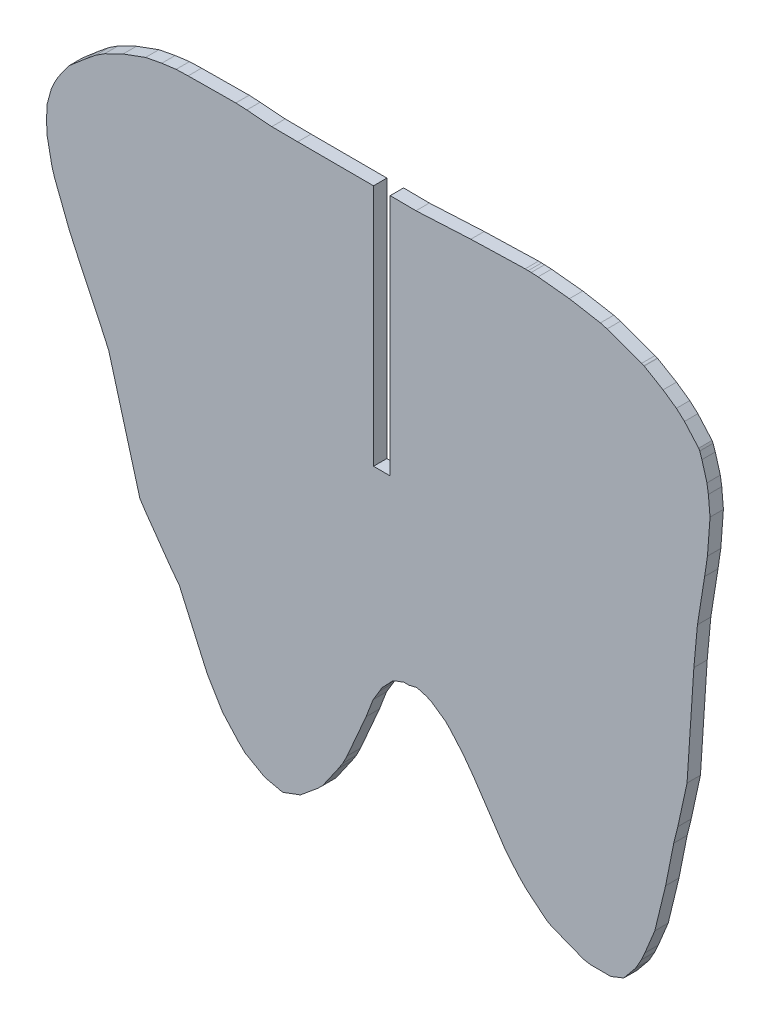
ISO-10303-21;
HEADER;
FILE_DESCRIPTION(('STEP AP214'),'2;1');
FILE_NAME('part.step','',(''),(''),'','','');
FILE_SCHEMA(('AUTOMOTIVE_DESIGN { 1 0 10303 214 1 1 1 1 }'));
ENDSEC;
DATA;
#1=APPLICATION_CONTEXT('core data for automotive mechanical design processes');
#2=APPLICATION_PROTOCOL_DEFINITION('international standard','automotive_design',2000,#1);
#3=PRODUCT_CONTEXT('',#1,'mechanical');
#4=PRODUCT('Part','Part','',(#3));
#5=PRODUCT_RELATED_PRODUCT_CATEGORY('part','',(#4));
#6=PRODUCT_DEFINITION_FORMATION('','',#4);
#7=PRODUCT_DEFINITION_CONTEXT('part definition',#1,'design');
#8=PRODUCT_DEFINITION('design','',#6,#7);
#9=PRODUCT_DEFINITION_SHAPE('','',#8);
#10=(LENGTH_UNIT() NAMED_UNIT(*) SI_UNIT(.MILLI.,.METRE.));
#11=(NAMED_UNIT(*) PLANE_ANGLE_UNIT() SI_UNIT($,.RADIAN.));
#12=(NAMED_UNIT(*) SI_UNIT($,.STERADIAN.) SOLID_ANGLE_UNIT());
#13=UNCERTAINTY_MEASURE_WITH_UNIT(LENGTH_MEASURE(1.E-05),#10,'distance_accuracy_value','');
#14=(GEOMETRIC_REPRESENTATION_CONTEXT(3) GLOBAL_UNCERTAINTY_ASSIGNED_CONTEXT((#13)) GLOBAL_UNIT_ASSIGNED_CONTEXT((#10,
#11,#12)) REPRESENTATION_CONTEXT('',''));
#15=CARTESIAN_POINT('',(0.,0.,0.));
#16=DIRECTION('',(0.,0.,1.));
#17=DIRECTION('',(1.,0.,0.));
#18=AXIS2_PLACEMENT_3D('',#15,#16,#17);
#19=CARTESIAN_POINT('',(-5851.0363,157.9733,2.));
#20=DIRECTION('',(-0.573644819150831,-0.819104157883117,0.));
#21=DIRECTION('',(0.819104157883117,-0.573644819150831,0.));
#22=AXIS2_PLACEMENT_3D('',#19,#20,#21);
#23=PLANE('',#22);
#24=DIRECTION('',(-0.819104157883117,0.573644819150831,0.));
#25=VECTOR('',#24,1.);
#26=CARTESIAN_POINT('',(-5851.0363,157.9733,0.));
#27=LINE('',#26,#25);
#28=CARTESIAN_POINT('',(-5851.0363,157.9733,0.));
#29=VERTEX_POINT('',#28);
#30=CARTESIAN_POINT('',(-5853.0245,159.3657,0.));
#31=VERTEX_POINT('',#30);
#32=EDGE_CURVE('E807',#29,#31,#27,.T.);
#33=ORIENTED_EDGE('',*,*,#32,.T.);
#34=DIRECTION('',(0.,0.,-1.));
#35=VECTOR('',#34,1.);
#36=CARTESIAN_POINT('',(-5853.0245,159.3657,2.));
#37=LINE('',#36,#35);
#38=CARTESIAN_POINT('',(-5853.0245,159.3657,2.));
#39=VERTEX_POINT('',#38);
#40=EDGE_CURVE('E11',#39,#31,#37,.T.);
#41=ORIENTED_EDGE('',*,*,#40,.F.);
#42=DIRECTION('',(-0.819104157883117,0.573644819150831,0.));
#43=VECTOR('',#42,1.);
#44=CARTESIAN_POINT('',(-5851.0363,157.9733,2.));
#45=LINE('',#44,#43);
#46=CARTESIAN_POINT('',(-5851.0363,157.9733,2.));
#47=VERTEX_POINT('',#46);
#48=EDGE_CURVE('E1047',#47,#39,#45,.T.);
#49=ORIENTED_EDGE('',*,*,#48,.F.);
#50=DIRECTION('',(0.,0.,-1.));
#51=VECTOR('',#50,1.);
#52=CARTESIAN_POINT('',(-5851.0363,157.9733,2.));
#53=LINE('',#52,#51);
#54=EDGE_CURVE('E803',#47,#29,#53,.T.);
#55=ORIENTED_EDGE('',*,*,#54,.T.);
#56=EDGE_LOOP('',(#33,#41,#49,#55));
#57=FACE_BOUND('',#56,.T.);
#58=ADVANCED_FACE('F39',(#57),#23,.F.);
#59=CARTESIAN_POINT('',(-5853.0245,159.3657,2.));
#60=DIRECTION('',(-0.509632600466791,-0.860392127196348,0.));
#61=DIRECTION('',(0.860392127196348,-0.509632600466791,0.));
#62=AXIS2_PLACEMENT_3D('',#59,#60,#61);
#63=PLANE('',#62);
#64=DIRECTION('',(-0.860392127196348,0.509632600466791,0.));
#65=VECTOR('',#64,1.);
#66=CARTESIAN_POINT('',(-5853.0245,159.3657,0.));
#67=LINE('',#66,#65);
#68=CARTESIAN_POINT('',(-5855.8444,161.036,0.));
#69=VERTEX_POINT('',#68);
#70=EDGE_CURVE('E810',#31,#69,#67,.T.);
#71=ORIENTED_EDGE('',*,*,#70,.T.);
#72=DIRECTION('',(0.,0.,-1.));
#73=VECTOR('',#72,1.);
#74=CARTESIAN_POINT('',(-5855.8444,161.036,2.));
#75=LINE('',#74,#73);
#76=CARTESIAN_POINT('',(-5855.8444,161.036,2.));
#77=VERTEX_POINT('',#76);
#78=EDGE_CURVE('E47',#77,#69,#75,.T.);
#79=ORIENTED_EDGE('',*,*,#78,.F.);
#80=DIRECTION('',(-0.860392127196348,0.509632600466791,0.));
#81=VECTOR('',#80,1.);
#82=CARTESIAN_POINT('',(-5853.0245,159.3657,2.));
#83=LINE('',#82,#81);
#84=EDGE_CURVE('E434',#39,#77,#83,.T.);
#85=ORIENTED_EDGE('',*,*,#84,.F.);
#86=ORIENTED_EDGE('',*,*,#40,.T.);
#87=EDGE_LOOP('',(#71,#79,#85,#86));
#88=FACE_BOUND('',#87,.T.);
#89=ADVANCED_FACE('F1665',(#88),#63,.F.);
#90=CARTESIAN_POINT('',(-5855.8444,161.036,2.));
#91=DIRECTION('',(-0.427827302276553,-0.903860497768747,0.));
#92=DIRECTION('',(0.903860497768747,-0.427827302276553,0.));
#93=AXIS2_PLACEMENT_3D('',#90,#91,#92);
#94=PLANE('',#93);
#95=DIRECTION('',(-0.903860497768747,0.427827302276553,0.));
#96=VECTOR('',#95,1.);
#97=CARTESIAN_POINT('',(-5855.8444,161.036,0.));
#98=LINE('',#97,#96);
#99=CARTESIAN_POINT('',(-5855.8894,161.0573,0.));
#100=VERTEX_POINT('',#99);
#101=EDGE_CURVE('E812',#69,#100,#98,.T.);
#102=ORIENTED_EDGE('',*,*,#101,.T.);
#103=DIRECTION('',(0.,0.,-1.));
#104=VECTOR('',#103,1.);
#105=CARTESIAN_POINT('',(-5855.8894,161.0573,2.));
#106=LINE('',#105,#104);
#107=CARTESIAN_POINT('',(-5855.8894,161.0573,2.));
#108=VERTEX_POINT('',#107);
#109=EDGE_CURVE('E1390',#108,#100,#106,.T.);
#110=ORIENTED_EDGE('',*,*,#109,.F.);
#111=DIRECTION('',(-0.903860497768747,0.427827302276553,0.));
#112=VECTOR('',#111,1.);
#113=CARTESIAN_POINT('',(-5855.8444,161.036,2.));
#114=LINE('',#113,#112);
#115=EDGE_CURVE('E1398',#77,#108,#114,.T.);
#116=ORIENTED_EDGE('',*,*,#115,.F.);
#117=ORIENTED_EDGE('',*,*,#78,.T.);
#118=EDGE_LOOP('',(#102,#110,#116,#117));
#119=FACE_BOUND('',#118,.T.);
#120=ADVANCED_FACE('F1396',(#119),#94,.F.);
#121=CARTESIAN_POINT('',(-5855.8894,161.0573,2.));
#122=DIRECTION('',(-0.355684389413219,-0.934606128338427,0.));
#123=DIRECTION('',(0.934606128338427,-0.355684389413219,0.));
#124=AXIS2_PLACEMENT_3D('',#121,#122,#123);
#125=PLANE('',#124);
#126=DIRECTION('',(-0.934606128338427,0.355684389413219,0.));
#127=VECTOR('',#126,1.);
#128=CARTESIAN_POINT('',(-5855.8894,161.0573,0.));
#129=LINE('',#128,#127);
#130=CARTESIAN_POINT('',(-5856.2394,161.1905,0.));
#131=VERTEX_POINT('',#130);
#132=EDGE_CURVE('E814',#100,#131,#129,.T.);
#133=ORIENTED_EDGE('',*,*,#132,.T.);
#134=DIRECTION('',(0.,0.,-1.));
#135=VECTOR('',#134,1.);
#136=CARTESIAN_POINT('',(-5856.2394,161.1905,2.));
#137=LINE('',#136,#135);
#138=CARTESIAN_POINT('',(-5856.2394,161.1905,2.));
#139=VERTEX_POINT('',#138);
#140=EDGE_CURVE('E1387',#139,#131,#137,.T.);
#141=ORIENTED_EDGE('',*,*,#140,.F.);
#142=DIRECTION('',(-0.934606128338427,0.355684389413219,0.));
#143=VECTOR('',#142,1.);
#144=CARTESIAN_POINT('',(-5855.8894,161.0573,2.));
#145=LINE('',#144,#143);
#146=EDGE_CURVE('E1416',#108,#139,#145,.T.);
#147=ORIENTED_EDGE('',*,*,#146,.F.);
#148=ORIENTED_EDGE('',*,*,#109,.T.);
#149=EDGE_LOOP('',(#133,#141,#147,#148));
#150=FACE_BOUND('',#149,.T.);
#151=ADVANCED_FACE('F1407',(#150),#125,.F.);
#152=CARTESIAN_POINT('',(-5856.2394,161.1905,2.));
#153=DIRECTION('',(-0.341602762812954,-0.939844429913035,0.));
#154=DIRECTION('',(0.939844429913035,-0.341602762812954,0.));
#155=AXIS2_PLACEMENT_3D('',#152,#153,#154);
#156=PLANE('',#155);
#157=DIRECTION('',(-0.939844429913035,0.341602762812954,0.));
#158=VECTOR('',#157,1.);
#159=CARTESIAN_POINT('',(-5856.2394,161.1905,0.));
#160=LINE('',#159,#158);
#161=CARTESIAN_POINT('',(-5861.403,163.0673,0.));
#162=VERTEX_POINT('',#161);
#163=EDGE_CURVE('E816',#131,#162,#160,.T.);
#164=ORIENTED_EDGE('',*,*,#163,.T.);
#165=DIRECTION('',(0.,0.,-1.));
#166=VECTOR('',#165,1.);
#167=CARTESIAN_POINT('',(-5861.403,163.0673,2.));
#168=LINE('',#167,#166);
#169=CARTESIAN_POINT('',(-5861.403,163.0673,2.));
#170=VERTEX_POINT('',#169);
#171=EDGE_CURVE('E1384',#170,#162,#168,.T.);
#172=ORIENTED_EDGE('',*,*,#171,.F.);
#173=DIRECTION('',(-0.939844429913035,0.341602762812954,0.));
#174=VECTOR('',#173,1.);
#175=CARTESIAN_POINT('',(-5856.2394,161.1905,2.));
#176=LINE('',#175,#174);
#177=EDGE_CURVE('E1413',#139,#170,#176,.T.);
#178=ORIENTED_EDGE('',*,*,#177,.F.);
#179=ORIENTED_EDGE('',*,*,#140,.T.);
#180=EDGE_LOOP('',(#164,#172,#178,#179));
#181=FACE_BOUND('',#180,.T.);
#182=ADVANCED_FACE('F1411',(#181),#156,.F.);
#183=CARTESIAN_POINT('',(-5861.403,163.0673,2.));
#184=DIRECTION('',(-0.273407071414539,-0.96189842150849,0.));
#185=DIRECTION('',(0.96189842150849,-0.273407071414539,0.));
#186=AXIS2_PLACEMENT_3D('',#183,#184,#185);
#187=PLANE('',#186);
#188=DIRECTION('',(-0.96189842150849,0.273407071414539,0.));
#189=VECTOR('',#188,1.);
#190=CARTESIAN_POINT('',(-5861.403,163.0673,0.));
#191=LINE('',#190,#189);
#192=CARTESIAN_POINT('',(-5862.399,163.3504,0.));
#193=VERTEX_POINT('',#192);
#194=EDGE_CURVE('E818',#162,#193,#191,.T.);
#195=ORIENTED_EDGE('',*,*,#194,.T.);
#196=DIRECTION('',(0.,0.,-1.));
#197=VECTOR('',#196,1.);
#198=CARTESIAN_POINT('',(-5862.399,163.3504,2.));
#199=LINE('',#198,#197);
#200=CARTESIAN_POINT('',(-5862.399,163.3504,2.));
#201=VERTEX_POINT('',#200);
#202=EDGE_CURVE('E1381',#201,#193,#199,.T.);
#203=ORIENTED_EDGE('',*,*,#202,.F.);
#204=DIRECTION('',(-0.96189842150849,0.273407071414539,0.));
#205=VECTOR('',#204,1.);
#206=CARTESIAN_POINT('',(-5861.403,163.0673,2.));
#207=LINE('',#206,#205);
#208=EDGE_CURVE('E1415',#170,#201,#207,.T.);
#209=ORIENTED_EDGE('',*,*,#208,.F.);
#210=ORIENTED_EDGE('',*,*,#171,.T.);
#211=EDGE_LOOP('',(#195,#203,#209,#210));
#212=FACE_BOUND('',#211,.T.);
#213=ADVANCED_FACE('F1678',(#212),#187,.F.);
#214=CARTESIAN_POINT('',(-5862.399,163.3504,2.));
#215=DIRECTION('',(-0.173052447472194,-0.98491261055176,0.));
#216=DIRECTION('',(0.98491261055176,-0.173052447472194,0.));
#217=AXIS2_PLACEMENT_3D('',#214,#215,#216);
#218=PLANE('',#217);
#219=DIRECTION('',(-0.98491261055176,0.173052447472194,0.));
#220=VECTOR('',#219,1.);
#221=CARTESIAN_POINT('',(-5862.399,163.3504,0.));
#222=LINE('',#221,#220);
#223=CARTESIAN_POINT('',(-5867.0375,164.1654,0.));
#224=VERTEX_POINT('',#223);
#225=EDGE_CURVE('E820',#193,#224,#222,.T.);
#226=ORIENTED_EDGE('',*,*,#225,.T.);
#227=DIRECTION('',(0.,0.,-1.));
#228=VECTOR('',#227,1.);
#229=CARTESIAN_POINT('',(-5867.0375,164.1654,2.));
#230=LINE('',#229,#228);
#231=CARTESIAN_POINT('',(-5867.0375,164.1654,2.));
#232=VERTEX_POINT('',#231);
#233=EDGE_CURVE('E1378',#232,#224,#230,.T.);
#234=ORIENTED_EDGE('',*,*,#233,.F.);
#235=DIRECTION('',(-0.98491261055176,0.173052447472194,0.));
#236=VECTOR('',#235,1.);
#237=CARTESIAN_POINT('',(-5862.399,163.3504,2.));
#238=LINE('',#237,#236);
#239=EDGE_CURVE('E1418',#201,#232,#238,.T.);
#240=ORIENTED_EDGE('',*,*,#239,.F.);
#241=ORIENTED_EDGE('',*,*,#202,.T.);
#242=EDGE_LOOP('',(#226,#234,#240,#241));
#243=FACE_BOUND('',#242,.T.);
#244=ADVANCED_FACE('F1681',(#243),#218,.F.);
#245=CARTESIAN_POINT('',(-5867.0375,164.1654,2.));
#246=DIRECTION('',(-0.103934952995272,-0.994584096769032,0.));
#247=DIRECTION('',(0.994584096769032,-0.103934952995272,0.));
#248=AXIS2_PLACEMENT_3D('',#245,#246,#247);
#249=PLANE('',#248);
#250=DIRECTION('',(-0.994584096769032,0.103934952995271,0.));
#251=VECTOR('',#250,1.);
#252=CARTESIAN_POINT('',(-5867.0375,164.1654,0.));
#253=LINE('',#252,#251);
#254=CARTESIAN_POINT('',(-5871.7121,164.6539,0.));
#255=VERTEX_POINT('',#254);
#256=EDGE_CURVE('E822',#224,#255,#253,.T.);
#257=ORIENTED_EDGE('',*,*,#256,.T.);
#258=DIRECTION('',(0.,0.,-1.));
#259=VECTOR('',#258,1.);
#260=CARTESIAN_POINT('',(-5871.7121,164.6539,2.));
#261=LINE('',#260,#259);
#262=CARTESIAN_POINT('',(-5871.7121,164.6539,2.));
#263=VERTEX_POINT('',#262);
#264=EDGE_CURVE('E1375',#263,#255,#261,.T.);
#265=ORIENTED_EDGE('',*,*,#264,.F.);
#266=DIRECTION('',(-0.994584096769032,0.103934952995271,0.));
#267=VECTOR('',#266,1.);
#268=CARTESIAN_POINT('',(-5867.0375,164.1654,2.));
#269=LINE('',#268,#267);
#270=EDGE_CURVE('E1424',#232,#263,#269,.T.);
#271=ORIENTED_EDGE('',*,*,#270,.F.);
#272=ORIENTED_EDGE('',*,*,#233,.T.);
#273=EDGE_LOOP('',(#257,#265,#271,#272));
#274=FACE_BOUND('',#273,.T.);
#275=ADVANCED_FACE('F1685',(#274),#249,.F.);
#276=CARTESIAN_POINT('',(-5871.7121,164.6539,2.));
#277=DIRECTION('',(-0.0473775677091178,-0.998877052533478,0.));
#278=DIRECTION('',(0.998877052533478,-0.0473775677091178,0.));
#279=AXIS2_PLACEMENT_3D('',#276,#277,#278);
#280=PLANE('',#279);
#281=DIRECTION('',(-0.998877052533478,0.0473775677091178,0.));
#282=VECTOR('',#281,1.);
#283=CARTESIAN_POINT('',(-5871.7121,164.6539,0.));
#284=LINE('',#283,#282);
#285=CARTESIAN_POINT('',(-5872.7494,164.7031,0.));
#286=VERTEX_POINT('',#285);
#287=EDGE_CURVE('E824',#255,#286,#284,.T.);
#288=ORIENTED_EDGE('',*,*,#287,.T.);
#289=DIRECTION('',(0.,0.,-1.));
#290=VECTOR('',#289,1.);
#291=CARTESIAN_POINT('',(-5872.7494,164.7031,2.));
#292=LINE('',#291,#290);
#293=CARTESIAN_POINT('',(-5872.7494,164.7031,2.));
#294=VERTEX_POINT('',#293);
#295=EDGE_CURVE('E1372',#294,#286,#292,.T.);
#296=ORIENTED_EDGE('',*,*,#295,.F.);
#297=DIRECTION('',(-0.998877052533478,0.0473775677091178,0.));
#298=VECTOR('',#297,1.);
#299=CARTESIAN_POINT('',(-5871.7121,164.6539,2.));
#300=LINE('',#299,#298);
#301=EDGE_CURVE('E1426',#263,#294,#300,.T.);
#302=ORIENTED_EDGE('',*,*,#301,.F.);
#303=ORIENTED_EDGE('',*,*,#264,.T.);
#304=EDGE_LOOP('',(#288,#296,#302,#303));
#305=FACE_BOUND('',#304,.T.);
#306=ADVANCED_FACE('F1689',(#305),#280,.F.);
#307=CARTESIAN_POINT('',(-5872.7494,164.7031,2.));
#308=DIRECTION('',(-0.0302823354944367,-0.999541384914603,0.));
#309=DIRECTION('',(0.999541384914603,-0.0302823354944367,0.));
#310=AXIS2_PLACEMENT_3D('',#307,#308,#309);
#311=PLANE('',#310);
#312=DIRECTION('',(-0.999541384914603,0.0302823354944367,0.));
#313=VECTOR('',#312,1.);
#314=CARTESIAN_POINT('',(-5872.7494,164.7031,0.));
#315=LINE('',#314,#313);
#316=CARTESIAN_POINT('',(-5873.195,164.7166,0.));
#317=VERTEX_POINT('',#316);
#318=EDGE_CURVE('E826',#286,#317,#315,.T.);
#319=ORIENTED_EDGE('',*,*,#318,.T.);
#320=DIRECTION('',(0.,0.,-1.));
#321=VECTOR('',#320,1.);
#322=CARTESIAN_POINT('',(-5873.195,164.7166,2.));
#323=LINE('',#322,#321);
#324=CARTESIAN_POINT('',(-5873.195,164.7166,2.));
#325=VERTEX_POINT('',#324);
#326=EDGE_CURVE('E1369',#325,#317,#323,.T.);
#327=ORIENTED_EDGE('',*,*,#326,.F.);
#328=DIRECTION('',(-0.999541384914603,0.0302823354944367,0.));
#329=VECTOR('',#328,1.);
#330=CARTESIAN_POINT('',(-5872.7494,164.7031,2.));
#331=LINE('',#330,#329);
#332=EDGE_CURVE('E1428',#294,#325,#331,.T.);
#333=ORIENTED_EDGE('',*,*,#332,.F.);
#334=ORIENTED_EDGE('',*,*,#295,.T.);
#335=EDGE_LOOP('',(#319,#327,#333,#334));
#336=FACE_BOUND('',#335,.T.);
#337=ADVANCED_FACE('F1693',(#336),#311,.F.);
#338=CARTESIAN_POINT('',(-5873.195,164.7166,2.));
#339=DIRECTION('',(-0.0304996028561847,-0.99953477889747,0.));
#340=DIRECTION('',(0.99953477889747,-0.0304996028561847,0.));
#341=AXIS2_PLACEMENT_3D('',#338,#339,#340);
#342=PLANE('',#341);
#343=DIRECTION('',(-0.99953477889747,0.0304996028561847,0.));
#344=VECTOR('',#343,1.);
#345=CARTESIAN_POINT('',(-5873.195,164.7166,0.));
#346=LINE('',#345,#344);
#347=CARTESIAN_POINT('',(-5873.6407,164.7302,0.));
#348=VERTEX_POINT('',#347);
#349=EDGE_CURVE('E828',#317,#348,#346,.T.);
#350=ORIENTED_EDGE('',*,*,#349,.T.);
#351=DIRECTION('',(0.,0.,-1.));
#352=VECTOR('',#351,1.);
#353=CARTESIAN_POINT('',(-5873.6407,164.7302,2.));
#354=LINE('',#353,#352);
#355=CARTESIAN_POINT('',(-5873.6407,164.7302,2.));
#356=VERTEX_POINT('',#355);
#357=EDGE_CURVE('E1366',#356,#348,#354,.T.);
#358=ORIENTED_EDGE('',*,*,#357,.F.);
#359=DIRECTION('',(-0.99953477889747,0.0304996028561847,0.));
#360=VECTOR('',#359,1.);
#361=CARTESIAN_POINT('',(-5873.195,164.7166,2.));
#362=LINE('',#361,#360);
#363=EDGE_CURVE('E1430',#325,#356,#362,.T.);
#364=ORIENTED_EDGE('',*,*,#363,.F.);
#365=ORIENTED_EDGE('',*,*,#326,.T.);
#366=EDGE_LOOP('',(#350,#358,#364,#365));
#367=FACE_BOUND('',#366,.T.);
#368=ADVANCED_FACE('F1697',(#367),#342,.F.);
#369=CARTESIAN_POINT('',(-5873.6407,164.7302,2.));
#370=DIRECTION('',(0.0283958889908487,-0.999596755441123,0.));
#371=DIRECTION('',(0.999596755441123,0.0283958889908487,0.));
#372=AXIS2_PLACEMENT_3D('',#369,#370,#371);
#373=PLANE('',#372);
#374=DIRECTION('',(-0.999596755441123,-0.0283958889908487,0.));
#375=VECTOR('',#374,1.);
#376=CARTESIAN_POINT('',(-5873.6407,164.7302,0.));
#377=LINE('',#376,#375);
#378=CARTESIAN_POINT('',(-5881.7724,164.4992,0.));
#379=VERTEX_POINT('',#378);
#380=EDGE_CURVE('E830',#348,#379,#377,.T.);
#381=ORIENTED_EDGE('',*,*,#380,.T.);
#382=DIRECTION('',(0.,0.,-1.));
#383=VECTOR('',#382,1.);
#384=CARTESIAN_POINT('',(-5881.7724,164.4992,2.));
#385=LINE('',#384,#383);
#386=CARTESIAN_POINT('',(-5881.7724,164.4992,2.));
#387=VERTEX_POINT('',#386);
#388=EDGE_CURVE('E1363',#387,#379,#385,.T.);
#389=ORIENTED_EDGE('',*,*,#388,.F.);
#390=DIRECTION('',(-0.999596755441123,-0.0283958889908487,0.));
#391=VECTOR('',#390,1.);
#392=CARTESIAN_POINT('',(-5873.6407,164.7302,2.));
#393=LINE('',#392,#391);
#394=EDGE_CURVE('E1432',#356,#387,#393,.T.);
#395=ORIENTED_EDGE('',*,*,#394,.F.);
#396=ORIENTED_EDGE('',*,*,#357,.T.);
#397=EDGE_LOOP('',(#381,#389,#395,#396));
#398=FACE_BOUND('',#397,.T.);
#399=ADVANCED_FACE('F1701',(#398),#373,.F.);
#400=CARTESIAN_POINT('',(-5881.7724,164.4992,2.));
#401=DIRECTION('',(0.0506636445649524,-0.998715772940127,0.));
#402=DIRECTION('',(0.998715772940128,0.0506636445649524,0.));
#403=AXIS2_PLACEMENT_3D('',#400,#401,#402);
#404=PLANE('',#403);
#405=DIRECTION('',(-0.998715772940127,-0.0506636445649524,0.));
#406=VECTOR('',#405,1.);
#407=CARTESIAN_POINT('',(-5881.7724,164.4992,0.));
#408=LINE('',#407,#406);
#409=CARTESIAN_POINT('',(-5889.9709,164.0833,0.));
#410=VERTEX_POINT('',#409);
#411=EDGE_CURVE('E832',#379,#410,#408,.T.);
#412=ORIENTED_EDGE('',*,*,#411,.T.);
#413=DIRECTION('',(0.,0.,-1.));
#414=VECTOR('',#413,1.);
#415=CARTESIAN_POINT('',(-5889.9709,164.0833,2.));
#416=LINE('',#415,#414);
#417=CARTESIAN_POINT('',(-5889.9709,164.0833,2.));
#418=VERTEX_POINT('',#417);
#419=EDGE_CURVE('E1360',#418,#410,#416,.T.);
#420=ORIENTED_EDGE('',*,*,#419,.F.);
#421=DIRECTION('',(-0.998715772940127,-0.0506636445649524,0.));
#422=VECTOR('',#421,1.);
#423=CARTESIAN_POINT('',(-5881.7724,164.4992,2.));
#424=LINE('',#423,#422);
#425=EDGE_CURVE('E1434',#387,#418,#424,.T.);
#426=ORIENTED_EDGE('',*,*,#425,.F.);
#427=ORIENTED_EDGE('',*,*,#388,.T.);
#428=EDGE_LOOP('',(#412,#420,#426,#427));
#429=FACE_BOUND('',#428,.T.);
#430=ADVANCED_FACE('F1705',(#429),#404,.F.);
#431=CARTESIAN_POINT('',(-5889.9709,164.0833,2.));
#432=DIRECTION('',(-0.00947738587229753,-0.999955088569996,0.));
#433=DIRECTION('',(0.999955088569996,-0.00947738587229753,0.));
#434=AXIS2_PLACEMENT_3D('',#431,#432,#433);
#435=PLANE('',#434);
#436=DIRECTION('',(-0.999955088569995,0.00947738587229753,0.));
#437=VECTOR('',#436,1.);
#438=CARTESIAN_POINT('',(-5889.9709,164.0833,0.));
#439=LINE('',#438,#437);
#440=CARTESIAN_POINT('',(-5893.822,164.1198,0.));
#441=VERTEX_POINT('',#440);
#442=EDGE_CURVE('E834',#410,#441,#439,.T.);
#443=ORIENTED_EDGE('',*,*,#442,.T.);
#444=DIRECTION('',(0.,0.,-1.));
#445=VECTOR('',#444,1.);
#446=CARTESIAN_POINT('',(-5893.822,164.1198,2.));
#447=LINE('',#446,#445);
#448=CARTESIAN_POINT('',(-5893.822,164.1198,2.));
#449=VERTEX_POINT('',#448);
#450=EDGE_CURVE('E1357',#449,#441,#447,.T.);
#451=ORIENTED_EDGE('',*,*,#450,.F.);
#452=DIRECTION('',(-0.999955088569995,0.00947738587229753,0.));
#453=VECTOR('',#452,1.);
#454=CARTESIAN_POINT('',(-5889.9709,164.0833,2.));
#455=LINE('',#454,#453);
#456=EDGE_CURVE('E1436',#418,#449,#455,.T.);
#457=ORIENTED_EDGE('',*,*,#456,.F.);
#458=ORIENTED_EDGE('',*,*,#419,.T.);
#459=EDGE_LOOP('',(#443,#451,#457,#458));
#460=FACE_BOUND('',#459,.T.);
#461=ADVANCED_FACE('F1709',(#460),#435,.F.);
#462=CARTESIAN_POINT('',(-5893.822,164.1198,2.));
#463=DIRECTION('',(1.,0.,0.));
#464=DIRECTION('',(0.,0.,-1.));
#465=AXIS2_PLACEMENT_3D('',#462,#463,#464);
#466=PLANE('',#465);
#467=DIRECTION('',(0.,-1.,0.));
#468=VECTOR('',#467,1.);
#469=CARTESIAN_POINT('',(-5893.822,164.1198,0.));
#470=LINE('',#469,#468);
#471=CARTESIAN_POINT('',(-5893.822,127.8223,0.));
#472=VERTEX_POINT('',#471);
#473=EDGE_CURVE('E836',#441,#472,#470,.T.);
#474=ORIENTED_EDGE('',*,*,#473,.T.);
#475=DIRECTION('',(0.,0.,-1.));
#476=VECTOR('',#475,1.);
#477=CARTESIAN_POINT('',(-5893.822,127.8223,2.));
#478=LINE('',#477,#476);
#479=CARTESIAN_POINT('',(-5893.822,127.8223,2.));
#480=VERTEX_POINT('',#479);
#481=EDGE_CURVE('E1354',#480,#472,#478,.T.);
#482=ORIENTED_EDGE('',*,*,#481,.F.);
#483=DIRECTION('',(0.,-1.,0.));
#484=VECTOR('',#483,1.);
#485=CARTESIAN_POINT('',(-5893.822,164.1198,2.));
#486=LINE('',#485,#484);
#487=EDGE_CURVE('E1438',#449,#480,#486,.T.);
#488=ORIENTED_EDGE('',*,*,#487,.F.);
#489=ORIENTED_EDGE('',*,*,#450,.T.);
#490=EDGE_LOOP('',(#474,#482,#488,#489));
#491=FACE_BOUND('',#490,.T.);
#492=ADVANCED_FACE('F1713',(#491),#466,.F.);
#493=CARTESIAN_POINT('',(-5896.072,127.8223,2.));
#494=DIRECTION('',(0.,-1.,0.));
#495=DIRECTION('',(0.,0.,-1.));
#496=AXIS2_PLACEMENT_3D('',#493,#494,#495);
#497=PLANE('',#496);
#498=DIRECTION('',(-1.,0.,0.));
#499=VECTOR('',#498,1.);
#500=CARTESIAN_POINT('',(-5896.072,127.8223,0.));
#501=LINE('',#500,#499);
#502=CARTESIAN_POINT('',(-5896.322,127.8223,0.));
#503=VERTEX_POINT('',#502);
#504=EDGE_CURVE('E839',#472,#503,#501,.T.);
#505=ORIENTED_EDGE('',*,*,#504,.T.);
#506=DIRECTION('',(0.,0.,-1.));
#507=VECTOR('',#506,1.);
#508=CARTESIAN_POINT('',(-5896.322,127.8223,2.));
#509=LINE('',#508,#507);
#510=CARTESIAN_POINT('',(-5896.322,127.8223,2.));
#511=VERTEX_POINT('',#510);
#512=EDGE_CURVE('E1351',#511,#503,#509,.T.);
#513=ORIENTED_EDGE('',*,*,#512,.F.);
#514=DIRECTION('',(-1.,0.,0.));
#515=VECTOR('',#514,1.);
#516=CARTESIAN_POINT('',(-5893.822,127.8223,2.));
#517=LINE('',#516,#515);
#518=EDGE_CURVE('E1440',#480,#511,#517,.T.);
#519=ORIENTED_EDGE('',*,*,#518,.F.);
#520=ORIENTED_EDGE('',*,*,#481,.T.);
#521=EDGE_LOOP('',(#505,#513,#519,#520));
#522=FACE_BOUND('',#521,.T.);
#523=ADVANCED_FACE('F1717',(#522),#497,.F.);
#524=CARTESIAN_POINT('',(-5896.322,127.8223,2.));
#525=DIRECTION('',(-1.,0.,0.));
#526=DIRECTION('',(0.,0.,1.));
#527=AXIS2_PLACEMENT_3D('',#524,#525,#526);
#528=PLANE('',#527);
#529=DIRECTION('',(0.,1.,0.));
#530=VECTOR('',#529,1.);
#531=CARTESIAN_POINT('',(-5896.322,127.8223,0.));
#532=LINE('',#531,#530);
#533=CARTESIAN_POINT('',(-5896.322,164.1412,0.));
#534=VERTEX_POINT('',#533);
#535=EDGE_CURVE('E841',#503,#534,#532,.T.);
#536=ORIENTED_EDGE('',*,*,#535,.T.);
#537=DIRECTION('',(0.,0.,-1.));
#538=VECTOR('',#537,1.);
#539=CARTESIAN_POINT('',(-5896.322,164.1412,2.));
#540=LINE('',#539,#538);
#541=CARTESIAN_POINT('',(-5896.322,164.1412,2.));
#542=VERTEX_POINT('',#541);
#543=EDGE_CURVE('E1348',#542,#534,#540,.T.);
#544=ORIENTED_EDGE('',*,*,#543,.F.);
#545=DIRECTION('',(0.,1.,0.));
#546=VECTOR('',#545,1.);
#547=CARTESIAN_POINT('',(-5896.322,127.8223,2.));
#548=LINE('',#547,#546);
#549=EDGE_CURVE('E1442',#511,#542,#548,.T.);
#550=ORIENTED_EDGE('',*,*,#549,.F.);
#551=ORIENTED_EDGE('',*,*,#512,.T.);
#552=EDGE_LOOP('',(#536,#544,#550,#551));
#553=FACE_BOUND('',#552,.T.);
#554=ADVANCED_FACE('F1721',(#553),#528,.F.);
#555=CARTESIAN_POINT('',(-5896.322,164.1412,2.));
#556=DIRECTION('',(-0.00240754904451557,-0.9999971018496,0.));
#557=DIRECTION('',(0.9999971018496,-0.00240754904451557,0.));
#558=AXIS2_PLACEMENT_3D('',#555,#556,#557);
#559=PLANE('',#558);
#560=DIRECTION('',(-0.999997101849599,0.00240754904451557,0.));
#561=VECTOR('',#560,1.);
#562=CARTESIAN_POINT('',(-5896.322,164.1412,0.));
#563=LINE('',#562,#561);
#564=CARTESIAN_POINT('',(-5907.6613,164.1685,0.));
#565=VERTEX_POINT('',#564);
#566=EDGE_CURVE('E843',#534,#565,#563,.T.);
#567=ORIENTED_EDGE('',*,*,#566,.T.);
#568=DIRECTION('',(0.,0.,-1.));
#569=VECTOR('',#568,1.);
#570=CARTESIAN_POINT('',(-5907.6613,164.1685,2.));
#571=LINE('',#570,#569);
#572=CARTESIAN_POINT('',(-5907.6613,164.1685,2.));
#573=VERTEX_POINT('',#572);
#574=EDGE_CURVE('E1345',#573,#565,#571,.T.);
#575=ORIENTED_EDGE('',*,*,#574,.F.);
#576=DIRECTION('',(-0.999997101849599,0.00240754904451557,0.));
#577=VECTOR('',#576,1.);
#578=CARTESIAN_POINT('',(-5896.322,164.1412,2.));
#579=LINE('',#578,#577);
#580=EDGE_CURVE('E1444',#542,#573,#579,.T.);
#581=ORIENTED_EDGE('',*,*,#580,.F.);
#582=ORIENTED_EDGE('',*,*,#543,.T.);
#583=EDGE_LOOP('',(#567,#575,#581,#582));
#584=FACE_BOUND('',#583,.T.);
#585=ADVANCED_FACE('F1725',(#584),#559,.F.);
#586=CARTESIAN_POINT('',(-5907.6613,164.1685,2.));
#587=DIRECTION('',(-0.00765626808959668,-0.999970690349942,0.));
#588=DIRECTION('',(0.999970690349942,-0.00765626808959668,0.));
#589=AXIS2_PLACEMENT_3D('',#586,#587,#588);
#590=PLANE('',#589);
#591=DIRECTION('',(-0.999970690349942,0.00765626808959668,0.));
#592=VECTOR('',#591,1.);
#593=CARTESIAN_POINT('',(-5907.6613,164.1685,0.));
#594=LINE('',#593,#592);
#595=CARTESIAN_POINT('',(-5911.5273,164.1981,0.));
#596=VERTEX_POINT('',#595);
#597=EDGE_CURVE('E845',#565,#596,#594,.T.);
#598=ORIENTED_EDGE('',*,*,#597,.T.);
#599=DIRECTION('',(0.,0.,-1.));
#600=VECTOR('',#599,1.);
#601=CARTESIAN_POINT('',(-5911.5273,164.1981,2.));
#602=LINE('',#601,#600);
#603=CARTESIAN_POINT('',(-5911.5273,164.1981,2.));
#604=VERTEX_POINT('',#603);
#605=EDGE_CURVE('E1342',#604,#596,#602,.T.);
#606=ORIENTED_EDGE('',*,*,#605,.F.);
#607=DIRECTION('',(-0.999970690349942,0.00765626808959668,0.));
#608=VECTOR('',#607,1.);
#609=CARTESIAN_POINT('',(-5907.6613,164.1685,2.));
#610=LINE('',#609,#608);
#611=EDGE_CURVE('E1446',#573,#604,#610,.T.);
#612=ORIENTED_EDGE('',*,*,#611,.F.);
#613=ORIENTED_EDGE('',*,*,#574,.T.);
#614=EDGE_LOOP('',(#598,#606,#612,#613));
#615=FACE_BOUND('',#614,.T.);
#616=ADVANCED_FACE('F1729',(#615),#590,.F.);
#617=CARTESIAN_POINT('',(-5911.5273,164.1981,2.));
#618=DIRECTION('',(-0.0776256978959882,-0.996982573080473,0.));
#619=DIRECTION('',(0.996982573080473,-0.0776256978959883,0.));
#620=AXIS2_PLACEMENT_3D('',#617,#618,#619);
#621=PLANE('',#620);
#622=DIRECTION('',(-0.996982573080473,0.0776256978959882,0.));
#623=VECTOR('',#622,1.);
#624=CARTESIAN_POINT('',(-5911.5273,164.1981,0.));
#625=LINE('',#624,#623);
#626=CARTESIAN_POINT('',(-5915.2686,164.4894,0.));
#627=VERTEX_POINT('',#626);
#628=EDGE_CURVE('E847',#596,#627,#625,.T.);
#629=ORIENTED_EDGE('',*,*,#628,.T.);
#630=DIRECTION('',(0.,0.,-1.));
#631=VECTOR('',#630,1.);
#632=CARTESIAN_POINT('',(-5915.2686,164.4894,2.));
#633=LINE('',#632,#631);
#634=CARTESIAN_POINT('',(-5915.2686,164.4894,2.));
#635=VERTEX_POINT('',#634);
#636=EDGE_CURVE('E1339',#635,#627,#633,.T.);
#637=ORIENTED_EDGE('',*,*,#636,.F.);
#638=DIRECTION('',(-0.996982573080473,0.0776256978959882,0.));
#639=VECTOR('',#638,1.);
#640=CARTESIAN_POINT('',(-5911.5273,164.1981,2.));
#641=LINE('',#640,#639);
#642=EDGE_CURVE('E1448',#604,#635,#641,.T.);
#643=ORIENTED_EDGE('',*,*,#642,.F.);
#644=ORIENTED_EDGE('',*,*,#605,.T.);
#645=EDGE_LOOP('',(#629,#637,#643,#644));
#646=FACE_BOUND('',#645,.T.);
#647=ADVANCED_FACE('F1733',(#646),#621,.F.);
#648=CARTESIAN_POINT('',(-5915.2686,164.4894,2.));
#649=DIRECTION('',(-0.0531054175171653,-0.998588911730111,0.));
#650=DIRECTION('',(0.998588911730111,-0.0531054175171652,0.));
#651=AXIS2_PLACEMENT_3D('',#648,#649,#650);
#652=PLANE('',#651);
#653=DIRECTION('',(-0.998588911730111,0.0531054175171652,0.));
#654=VECTOR('',#653,1.);
#655=CARTESIAN_POINT('',(-5915.2686,164.4894,0.));
#656=LINE('',#655,#654);
#657=CARTESIAN_POINT('',(-5916.9083,164.5766,0.));
#658=VERTEX_POINT('',#657);
#659=EDGE_CURVE('E849',#627,#658,#656,.T.);
#660=ORIENTED_EDGE('',*,*,#659,.T.);
#661=DIRECTION('',(0.,0.,-1.));
#662=VECTOR('',#661,1.);
#663=CARTESIAN_POINT('',(-5916.9083,164.5766,2.));
#664=LINE('',#663,#662);
#665=CARTESIAN_POINT('',(-5916.9083,164.5766,2.));
#666=VERTEX_POINT('',#665);
#667=EDGE_CURVE('E1336',#666,#658,#664,.T.);
#668=ORIENTED_EDGE('',*,*,#667,.F.);
#669=DIRECTION('',(-0.998588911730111,0.0531054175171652,0.));
#670=VECTOR('',#669,1.);
#671=CARTESIAN_POINT('',(-5915.2686,164.4894,2.));
#672=LINE('',#671,#670);
#673=EDGE_CURVE('E1450',#635,#666,#672,.T.);
#674=ORIENTED_EDGE('',*,*,#673,.F.);
#675=ORIENTED_EDGE('',*,*,#636,.T.);
#676=EDGE_LOOP('',(#660,#668,#674,#675));
#677=FACE_BOUND('',#676,.T.);
#678=ADVANCED_FACE('F1737',(#677),#652,.F.);
#679=CARTESIAN_POINT('',(-5916.9083,164.5766,2.));
#680=DIRECTION('',(0.00851206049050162,-0.99996377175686,0.));
#681=DIRECTION('',(0.99996377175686,0.00851206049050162,0.));
#682=AXIS2_PLACEMENT_3D('',#679,#680,#681);
#683=PLANE('',#682);
#684=DIRECTION('',(-0.99996377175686,-0.00851206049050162,0.));
#685=VECTOR('',#684,1.);
#686=CARTESIAN_POINT('',(-5916.9083,164.5766,0.));
#687=LINE('',#686,#685);
#688=CARTESIAN_POINT('',(-5924.0391,164.5159,0.));
#689=VERTEX_POINT('',#688);
#690=EDGE_CURVE('E851',#658,#689,#687,.T.);
#691=ORIENTED_EDGE('',*,*,#690,.T.);
#692=DIRECTION('',(0.,0.,-1.));
#693=VECTOR('',#692,1.);
#694=CARTESIAN_POINT('',(-5924.0391,164.5159,2.));
#695=LINE('',#694,#693);
#696=CARTESIAN_POINT('',(-5924.0391,164.5159,2.));
#697=VERTEX_POINT('',#696);
#698=EDGE_CURVE('E1333',#697,#689,#695,.T.);
#699=ORIENTED_EDGE('',*,*,#698,.F.);
#700=DIRECTION('',(-0.99996377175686,-0.00851206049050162,0.));
#701=VECTOR('',#700,1.);
#702=CARTESIAN_POINT('',(-5916.9083,164.5766,2.));
#703=LINE('',#702,#701);
#704=EDGE_CURVE('E1452',#666,#697,#703,.T.);
#705=ORIENTED_EDGE('',*,*,#704,.F.);
#706=ORIENTED_EDGE('',*,*,#667,.T.);
#707=EDGE_LOOP('',(#691,#699,#705,#706));
#708=FACE_BOUND('',#707,.T.);
#709=ADVANCED_FACE('F1741',(#708),#683,.F.);
#710=CARTESIAN_POINT('',(-5924.0391,164.5159,2.));
#711=DIRECTION('',(0.0289298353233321,-0.999581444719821,0.));
#712=DIRECTION('',(0.999581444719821,0.0289298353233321,0.));
#713=AXIS2_PLACEMENT_3D('',#710,#711,#712);
#714=PLANE('',#713);
#715=DIRECTION('',(-0.999581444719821,-0.0289298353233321,0.));
#716=VECTOR('',#715,1.);
#717=CARTESIAN_POINT('',(-5924.0391,164.5159,0.));
#718=LINE('',#717,#716);
#719=CARTESIAN_POINT('',(-5925.8358,164.4639,0.));
#720=VERTEX_POINT('',#719);
#721=EDGE_CURVE('E853',#689,#720,#718,.T.);
#722=ORIENTED_EDGE('',*,*,#721,.T.);
#723=DIRECTION('',(0.,0.,-1.));
#724=VECTOR('',#723,1.);
#725=CARTESIAN_POINT('',(-5925.8358,164.4639,2.));
#726=LINE('',#725,#724);
#727=CARTESIAN_POINT('',(-5925.8358,164.4639,2.));
#728=VERTEX_POINT('',#727);
#729=EDGE_CURVE('E1330',#728,#720,#726,.T.);
#730=ORIENTED_EDGE('',*,*,#729,.F.);
#731=DIRECTION('',(-0.999581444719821,-0.0289298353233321,0.));
#732=VECTOR('',#731,1.);
#733=CARTESIAN_POINT('',(-5924.0391,164.5159,2.));
#734=LINE('',#733,#732);
#735=EDGE_CURVE('E1454',#697,#728,#734,.T.);
#736=ORIENTED_EDGE('',*,*,#735,.F.);
#737=ORIENTED_EDGE('',*,*,#698,.T.);
#738=EDGE_LOOP('',(#722,#730,#736,#737));
#739=FACE_BOUND('',#738,.T.);
#740=ADVANCED_FACE('F1745',(#739),#714,.F.);
#741=CARTESIAN_POINT('',(-5925.8358,164.4639,2.));
#742=DIRECTION('',(0.129669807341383,-0.991557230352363,0.));
#743=DIRECTION('',(0.991557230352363,0.129669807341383,0.));
#744=AXIS2_PLACEMENT_3D('',#741,#742,#743);
#745=PLANE('',#744);
#746=DIRECTION('',(-0.991557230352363,-0.129669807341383,0.));
#747=VECTOR('',#746,1.);
#748=CARTESIAN_POINT('',(-5925.8358,164.4639,0.));
#749=LINE('',#748,#747);
#750=CARTESIAN_POINT('',(-5927.9769,164.1839,0.));
#751=VERTEX_POINT('',#750);
#752=EDGE_CURVE('E855',#720,#751,#749,.T.);
#753=ORIENTED_EDGE('',*,*,#752,.T.);
#754=DIRECTION('',(0.,0.,-1.));
#755=VECTOR('',#754,1.);
#756=CARTESIAN_POINT('',(-5927.9769,164.1839,2.));
#757=LINE('',#756,#755);
#758=CARTESIAN_POINT('',(-5927.9769,164.1839,2.));
#759=VERTEX_POINT('',#758);
#760=EDGE_CURVE('E1327',#759,#751,#757,.T.);
#761=ORIENTED_EDGE('',*,*,#760,.F.);
#762=DIRECTION('',(-0.991557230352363,-0.129669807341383,0.));
#763=VECTOR('',#762,1.);
#764=CARTESIAN_POINT('',(-5925.8358,164.4639,2.));
#765=LINE('',#764,#763);
#766=EDGE_CURVE('E1456',#728,#759,#765,.T.);
#767=ORIENTED_EDGE('',*,*,#766,.F.);
#768=ORIENTED_EDGE('',*,*,#729,.T.);
#769=EDGE_LOOP('',(#753,#761,#767,#768));
#770=FACE_BOUND('',#769,.T.);
#771=ADVANCED_FACE('F1749',(#770),#745,.F.);
#772=CARTESIAN_POINT('',(-5927.9769,164.1839,2.));
#773=DIRECTION('',(0.18662778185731,-0.982430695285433,0.));
#774=DIRECTION('',(0.982430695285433,0.18662778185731,0.));
#775=AXIS2_PLACEMENT_3D('',#772,#773,#774);
#776=PLANE('',#775);
#777=DIRECTION('',(-0.982430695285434,-0.18662778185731,0.));
#778=VECTOR('',#777,1.);
#779=CARTESIAN_POINT('',(-5927.9769,164.1839,0.));
#780=LINE('',#779,#778);
#781=CARTESIAN_POINT('',(-5930.4005,163.7235,0.));
#782=VERTEX_POINT('',#781);
#783=EDGE_CURVE('E857',#751,#782,#780,.T.);
#784=ORIENTED_EDGE('',*,*,#783,.T.);
#785=DIRECTION('',(0.,0.,-1.));
#786=VECTOR('',#785,1.);
#787=CARTESIAN_POINT('',(-5930.4005,163.7235,2.));
#788=LINE('',#787,#786);
#789=CARTESIAN_POINT('',(-5930.4005,163.7235,2.));
#790=VERTEX_POINT('',#789);
#791=EDGE_CURVE('E1324',#790,#782,#788,.T.);
#792=ORIENTED_EDGE('',*,*,#791,.F.);
#793=DIRECTION('',(-0.982430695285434,-0.18662778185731,0.));
#794=VECTOR('',#793,1.);
#795=CARTESIAN_POINT('',(-5927.9769,164.1839,2.));
#796=LINE('',#795,#794);
#797=EDGE_CURVE('E1458',#759,#790,#796,.T.);
#798=ORIENTED_EDGE('',*,*,#797,.F.);
#799=ORIENTED_EDGE('',*,*,#760,.T.);
#800=EDGE_LOOP('',(#784,#792,#798,#799));
#801=FACE_BOUND('',#800,.T.);
#802=ADVANCED_FACE('F1753',(#801),#776,.F.);
#803=CARTESIAN_POINT('',(-5930.4005,163.7235,2.));
#804=DIRECTION('',(0.344146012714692,-0.938916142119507,0.));
#805=DIRECTION('',(0.938916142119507,0.344146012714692,0.));
#806=AXIS2_PLACEMENT_3D('',#803,#804,#805);
#807=PLANE('',#806);
#808=DIRECTION('',(-0.938916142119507,-0.344146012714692,0.));
#809=VECTOR('',#808,1.);
#810=CARTESIAN_POINT('',(-5930.4005,163.7235,0.));
#811=LINE('',#810,#809);
#812=CARTESIAN_POINT('',(-5933.7527,162.4948,0.));
#813=VERTEX_POINT('',#812);
#814=EDGE_CURVE('E859',#782,#813,#811,.T.);
#815=ORIENTED_EDGE('',*,*,#814,.T.);
#816=DIRECTION('',(0.,0.,-1.));
#817=VECTOR('',#816,1.);
#818=CARTESIAN_POINT('',(-5933.7527,162.4948,2.));
#819=LINE('',#818,#817);
#820=CARTESIAN_POINT('',(-5933.7527,162.4948,2.));
#821=VERTEX_POINT('',#820);
#822=EDGE_CURVE('E1321',#821,#813,#819,.T.);
#823=ORIENTED_EDGE('',*,*,#822,.F.);
#824=DIRECTION('',(-0.938916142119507,-0.344146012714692,0.));
#825=VECTOR('',#824,1.);
#826=CARTESIAN_POINT('',(-5930.4005,163.7235,2.));
#827=LINE('',#826,#825);
#828=EDGE_CURVE('E1460',#790,#821,#827,.T.);
#829=ORIENTED_EDGE('',*,*,#828,.F.);
#830=ORIENTED_EDGE('',*,*,#791,.T.);
#831=EDGE_LOOP('',(#815,#823,#829,#830));
#832=FACE_BOUND('',#831,.T.);
#833=ADVANCED_FACE('F1757',(#832),#807,.F.);
#834=CARTESIAN_POINT('',(-5933.7527,162.4948,2.));
#835=DIRECTION('',(0.439010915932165,-0.89848172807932,0.));
#836=DIRECTION('',(0.89848172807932,0.439010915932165,0.));
#837=AXIS2_PLACEMENT_3D('',#834,#835,#836);
#838=PLANE('',#837);
#839=DIRECTION('',(-0.89848172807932,-0.439010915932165,0.));
#840=VECTOR('',#839,1.);
#841=CARTESIAN_POINT('',(-5933.7527,162.4948,0.));
#842=LINE('',#841,#840);
#843=CARTESIAN_POINT('',(-5936.5193,161.143,0.));
#844=VERTEX_POINT('',#843);
#845=EDGE_CURVE('E861',#813,#844,#842,.T.);
#846=ORIENTED_EDGE('',*,*,#845,.T.);
#847=DIRECTION('',(0.,0.,-1.));
#848=VECTOR('',#847,1.);
#849=CARTESIAN_POINT('',(-5936.5193,161.143,2.));
#850=LINE('',#849,#848);
#851=CARTESIAN_POINT('',(-5936.5193,161.143,2.));
#852=VERTEX_POINT('',#851);
#853=EDGE_CURVE('E1318',#852,#844,#850,.T.);
#854=ORIENTED_EDGE('',*,*,#853,.F.);
#855=DIRECTION('',(-0.89848172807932,-0.439010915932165,0.));
#856=VECTOR('',#855,1.);
#857=CARTESIAN_POINT('',(-5933.7527,162.4948,2.));
#858=LINE('',#857,#856);
#859=EDGE_CURVE('E1462',#821,#852,#858,.T.);
#860=ORIENTED_EDGE('',*,*,#859,.F.);
#861=ORIENTED_EDGE('',*,*,#822,.T.);
#862=EDGE_LOOP('',(#846,#854,#860,#861));
#863=FACE_BOUND('',#862,.T.);
#864=ADVANCED_FACE('F1761',(#863),#838,.F.);
#865=CARTESIAN_POINT('',(-5936.5193,161.143,2.));
#866=DIRECTION('',(0.540722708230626,-0.841200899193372,0.));
#867=DIRECTION('',(0.841200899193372,0.540722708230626,0.));
#868=AXIS2_PLACEMENT_3D('',#865,#866,#867);
#869=PLANE('',#868);
#870=DIRECTION('',(-0.841200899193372,-0.540722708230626,0.));
#871=VECTOR('',#870,1.);
#872=CARTESIAN_POINT('',(-5936.5193,161.143,0.));
#873=LINE('',#872,#871);
#874=CARTESIAN_POINT('',(-5937.86,160.2812,0.));
#875=VERTEX_POINT('',#874);
#876=EDGE_CURVE('E863',#844,#875,#873,.T.);
#877=ORIENTED_EDGE('',*,*,#876,.T.);
#878=DIRECTION('',(0.,0.,-1.));
#879=VECTOR('',#878,1.);
#880=CARTESIAN_POINT('',(-5937.86,160.2812,2.));
#881=LINE('',#880,#879);
#882=CARTESIAN_POINT('',(-5937.86,160.2812,2.));
#883=VERTEX_POINT('',#882);
#884=EDGE_CURVE('E1315',#883,#875,#881,.T.);
#885=ORIENTED_EDGE('',*,*,#884,.F.);
#886=DIRECTION('',(-0.841200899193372,-0.540722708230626,0.));
#887=VECTOR('',#886,1.);
#888=CARTESIAN_POINT('',(-5936.5193,161.143,2.));
#889=LINE('',#888,#887);
#890=EDGE_CURVE('E1464',#852,#883,#889,.T.);
#891=ORIENTED_EDGE('',*,*,#890,.F.);
#892=ORIENTED_EDGE('',*,*,#853,.T.);
#893=EDGE_LOOP('',(#877,#885,#891,#892));
#894=FACE_BOUND('',#893,.T.);
#895=ADVANCED_FACE('F1765',(#894),#869,.F.);
#896=CARTESIAN_POINT('',(-5937.86,160.2812,2.));
#897=DIRECTION('',(0.632060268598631,-0.774919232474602,0.));
#898=DIRECTION('',(0.774919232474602,0.632060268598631,0.));
#899=AXIS2_PLACEMENT_3D('',#896,#897,#898);
#900=PLANE('',#899);
#901=DIRECTION('',(-0.774919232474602,-0.632060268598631,0.));
#902=VECTOR('',#901,1.);
#903=CARTESIAN_POINT('',(-5937.86,160.2812,0.));
#904=LINE('',#903,#902);
#905=CARTESIAN_POINT('',(-5939.4629,158.9738,0.));
#906=VERTEX_POINT('',#905);
#907=EDGE_CURVE('E865',#875,#906,#904,.T.);
#908=ORIENTED_EDGE('',*,*,#907,.T.);
#909=DIRECTION('',(0.,0.,-1.));
#910=VECTOR('',#909,1.);
#911=CARTESIAN_POINT('',(-5939.4629,158.9738,2.));
#912=LINE('',#911,#910);
#913=CARTESIAN_POINT('',(-5939.4629,158.9738,2.));
#914=VERTEX_POINT('',#913);
#915=EDGE_CURVE('E1312',#914,#906,#912,.T.);
#916=ORIENTED_EDGE('',*,*,#915,.F.);
#917=DIRECTION('',(-0.774919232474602,-0.632060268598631,0.));
#918=VECTOR('',#917,1.);
#919=CARTESIAN_POINT('',(-5937.86,160.2812,2.));
#920=LINE('',#919,#918);
#921=EDGE_CURVE('E1466',#883,#914,#920,.T.);
#922=ORIENTED_EDGE('',*,*,#921,.F.);
#923=ORIENTED_EDGE('',*,*,#884,.T.);
#924=EDGE_LOOP('',(#908,#916,#922,#923));
#925=FACE_BOUND('',#924,.T.);
#926=ADVANCED_FACE('F1769',(#925),#900,.F.);
#927=CARTESIAN_POINT('',(-5939.4629,158.9738,2.));
#928=DIRECTION('',(0.65042763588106,-0.759568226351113,0.));
#929=DIRECTION('',(0.759568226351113,0.65042763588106,0.));
#930=AXIS2_PLACEMENT_3D('',#927,#928,#929);
#931=PLANE('',#930);
#932=DIRECTION('',(-0.759568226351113,-0.65042763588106,0.));
#933=VECTOR('',#932,1.);
#934=CARTESIAN_POINT('',(-5939.4629,158.9738,0.));
#935=LINE('',#934,#933);
#936=CARTESIAN_POINT('',(-5941.8194,156.9559,0.));
#937=VERTEX_POINT('',#936);
#938=EDGE_CURVE('E867',#906,#937,#935,.T.);
#939=ORIENTED_EDGE('',*,*,#938,.T.);
#940=DIRECTION('',(0.,0.,-1.));
#941=VECTOR('',#940,1.);
#942=CARTESIAN_POINT('',(-5941.8194,156.9559,2.));
#943=LINE('',#942,#941);
#944=CARTESIAN_POINT('',(-5941.8194,156.9559,2.));
#945=VERTEX_POINT('',#944);
#946=EDGE_CURVE('E1309',#945,#937,#943,.T.);
#947=ORIENTED_EDGE('',*,*,#946,.F.);
#948=DIRECTION('',(-0.759568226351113,-0.65042763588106,0.));
#949=VECTOR('',#948,1.);
#950=CARTESIAN_POINT('',(-5939.4629,158.9738,2.));
#951=LINE('',#950,#949);
#952=EDGE_CURVE('E1468',#914,#945,#951,.T.);
#953=ORIENTED_EDGE('',*,*,#952,.F.);
#954=ORIENTED_EDGE('',*,*,#915,.T.);
#955=EDGE_LOOP('',(#939,#947,#953,#954));
#956=FACE_BOUND('',#955,.T.);
#957=ADVANCED_FACE('F1773',(#956),#931,.F.);
#958=CARTESIAN_POINT('',(-5941.8194,156.9559,2.));
#959=DIRECTION('',(0.810721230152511,-0.585432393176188,0.));
#960=DIRECTION('',(0.585432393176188,0.810721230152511,0.));
#961=AXIS2_PLACEMENT_3D('',#958,#959,#960);
#962=PLANE('',#961);
#963=DIRECTION('',(-0.585432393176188,-0.810721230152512,0.));
#964=VECTOR('',#963,1.);
#965=CARTESIAN_POINT('',(-5941.8194,156.9559,0.));
#966=LINE('',#965,#964);
#967=CARTESIAN_POINT('',(-5943.4365,154.7165,0.));
#968=VERTEX_POINT('',#967);
#969=EDGE_CURVE('E869',#937,#968,#966,.T.);
#970=ORIENTED_EDGE('',*,*,#969,.T.);
#971=DIRECTION('',(0.,0.,-1.));
#972=VECTOR('',#971,1.);
#973=CARTESIAN_POINT('',(-5943.4365,154.7165,2.));
#974=LINE('',#973,#972);
#975=CARTESIAN_POINT('',(-5943.4365,154.7165,2.));
#976=VERTEX_POINT('',#975);
#977=EDGE_CURVE('E1306',#976,#968,#974,.T.);
#978=ORIENTED_EDGE('',*,*,#977,.F.);
#979=DIRECTION('',(-0.585432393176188,-0.810721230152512,0.));
#980=VECTOR('',#979,1.);
#981=CARTESIAN_POINT('',(-5941.8194,156.9559,2.));
#982=LINE('',#981,#980);
#983=EDGE_CURVE('E1470',#945,#976,#982,.T.);
#984=ORIENTED_EDGE('',*,*,#983,.F.);
#985=ORIENTED_EDGE('',*,*,#946,.T.);
#986=EDGE_LOOP('',(#970,#978,#984,#985));
#987=FACE_BOUND('',#986,.T.);
#988=ADVANCED_FACE('F1777',(#987),#962,.F.);
#989=CARTESIAN_POINT('',(-5943.4365,154.7165,2.));
#990=DIRECTION('',(0.871919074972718,-0.489650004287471,0.));
#991=DIRECTION('',(0.489650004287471,0.871919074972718,0.));
#992=AXIS2_PLACEMENT_3D('',#989,#990,#991);
#993=PLANE('',#992);
#994=DIRECTION('',(-0.489650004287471,-0.871919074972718,0.));
#995=VECTOR('',#994,1.);
#996=CARTESIAN_POINT('',(-5943.4365,154.7165,0.));
#997=LINE('',#996,#995);
#998=CARTESIAN_POINT('',(-5943.9919,153.7275,0.));
#999=VERTEX_POINT('',#998);
#1000=EDGE_CURVE('E871',#968,#999,#997,.T.);
#1001=ORIENTED_EDGE('',*,*,#1000,.T.);
#1002=DIRECTION('',(0.,0.,-1.));
#1003=VECTOR('',#1002,1.);
#1004=CARTESIAN_POINT('',(-5943.9919,153.7275,2.));
#1005=LINE('',#1004,#1003);
#1006=CARTESIAN_POINT('',(-5943.9919,153.7275,2.));
#1007=VERTEX_POINT('',#1006);
#1008=EDGE_CURVE('E1303',#1007,#999,#1005,.T.);
#1009=ORIENTED_EDGE('',*,*,#1008,.F.);
#1010=DIRECTION('',(-0.489650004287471,-0.871919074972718,0.));
#1011=VECTOR('',#1010,1.);
#1012=CARTESIAN_POINT('',(-5943.4365,154.7165,2.));
#1013=LINE('',#1012,#1011);
#1014=EDGE_CURVE('E1472',#976,#1007,#1013,.T.);
#1015=ORIENTED_EDGE('',*,*,#1014,.F.);
#1016=ORIENTED_EDGE('',*,*,#977,.T.);
#1017=EDGE_LOOP('',(#1001,#1009,#1015,#1016));
#1018=FACE_BOUND('',#1017,.T.);
#1019=ADVANCED_FACE('F1781',(#1018),#993,.F.);
#1020=CARTESIAN_POINT('',(-5943.9919,153.7275,2.));
#1021=DIRECTION('',(0.916688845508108,-0.399601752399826,0.));
#1022=DIRECTION('',(0.399601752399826,0.916688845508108,0.));
#1023=AXIS2_PLACEMENT_3D('',#1020,#1021,#1022);
#1024=PLANE('',#1023);
#1025=DIRECTION('',(-0.399601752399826,-0.916688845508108,0.));
#1026=VECTOR('',#1025,1.);
#1027=CARTESIAN_POINT('',(-5943.9919,153.7275,0.));
#1028=LINE('',#1027,#1026);
#1029=CARTESIAN_POINT('',(-5944.5191,152.5181,0.));
#1030=VERTEX_POINT('',#1029);
#1031=EDGE_CURVE('E873',#999,#1030,#1028,.T.);
#1032=ORIENTED_EDGE('',*,*,#1031,.T.);
#1033=DIRECTION('',(0.,0.,-1.));
#1034=VECTOR('',#1033,1.);
#1035=CARTESIAN_POINT('',(-5944.5191,152.5181,2.));
#1036=LINE('',#1035,#1034);
#1037=CARTESIAN_POINT('',(-5944.5191,152.5181,2.));
#1038=VERTEX_POINT('',#1037);
#1039=EDGE_CURVE('E1300',#1038,#1030,#1036,.T.);
#1040=ORIENTED_EDGE('',*,*,#1039,.F.);
#1041=DIRECTION('',(-0.399601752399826,-0.916688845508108,0.));
#1042=VECTOR('',#1041,1.);
#1043=CARTESIAN_POINT('',(-5943.9919,153.7275,2.));
#1044=LINE('',#1043,#1042);
#1045=EDGE_CURVE('E1474',#1007,#1038,#1044,.T.);
#1046=ORIENTED_EDGE('',*,*,#1045,.F.);
#1047=ORIENTED_EDGE('',*,*,#1008,.T.);
#1048=EDGE_LOOP('',(#1032,#1040,#1046,#1047));
#1049=FACE_BOUND('',#1048,.T.);
#1050=ADVANCED_FACE('F1785',(#1049),#1024,.F.);
#1051=CARTESIAN_POINT('',(-5944.5191,152.5181,2.));
#1052=DIRECTION('',(0.964604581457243,-0.263700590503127,0.));
#1053=DIRECTION('',(0.263700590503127,0.964604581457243,0.));
#1054=AXIS2_PLACEMENT_3D('',#1051,#1052,#1053);
#1055=PLANE('',#1054);
#1056=DIRECTION('',(-0.263700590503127,-0.964604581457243,0.));
#1057=VECTOR('',#1056,1.);
#1058=CARTESIAN_POINT('',(-5944.5191,152.5181,0.));
#1059=LINE('',#1058,#1057);
#1060=CARTESIAN_POINT('',(-5945.1427,150.237,0.));
#1061=VERTEX_POINT('',#1060);
#1062=EDGE_CURVE('E875',#1030,#1061,#1059,.T.);
#1063=ORIENTED_EDGE('',*,*,#1062,.T.);
#1064=DIRECTION('',(0.,0.,-1.));
#1065=VECTOR('',#1064,1.);
#1066=CARTESIAN_POINT('',(-5945.1427,150.237,2.));
#1067=LINE('',#1066,#1065);
#1068=CARTESIAN_POINT('',(-5945.1427,150.237,2.));
#1069=VERTEX_POINT('',#1068);
#1070=EDGE_CURVE('E1297',#1069,#1061,#1067,.T.);
#1071=ORIENTED_EDGE('',*,*,#1070,.F.);
#1072=DIRECTION('',(-0.263700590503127,-0.964604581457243,0.));
#1073=VECTOR('',#1072,1.);
#1074=CARTESIAN_POINT('',(-5944.5191,152.5181,2.));
#1075=LINE('',#1074,#1073);
#1076=EDGE_CURVE('E1476',#1038,#1069,#1075,.T.);
#1077=ORIENTED_EDGE('',*,*,#1076,.F.);
#1078=ORIENTED_EDGE('',*,*,#1039,.T.);
#1079=EDGE_LOOP('',(#1063,#1071,#1077,#1078));
#1080=FACE_BOUND('',#1079,.T.);
#1081=ADVANCED_FACE('F1789',(#1080),#1055,.F.);
#1082=CARTESIAN_POINT('',(-5945.1427,150.237,2.));
#1083=DIRECTION('',(0.999601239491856,-0.0282375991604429,0.));
#1084=DIRECTION('',(0.0282375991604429,0.999601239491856,0.));
#1085=AXIS2_PLACEMENT_3D('',#1082,#1083,#1084);
#1086=PLANE('',#1085);
#1087=DIRECTION('',(-0.0282375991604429,-0.999601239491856,0.));
#1088=VECTOR('',#1087,1.);
#1089=CARTESIAN_POINT('',(-5945.1427,150.237,0.));
#1090=LINE('',#1089,#1088);
#1091=CARTESIAN_POINT('',(-5945.2005,148.1909,0.));
#1092=VERTEX_POINT('',#1091);
#1093=EDGE_CURVE('E877',#1061,#1092,#1090,.T.);
#1094=ORIENTED_EDGE('',*,*,#1093,.T.);
#1095=DIRECTION('',(0.,0.,-1.));
#1096=VECTOR('',#1095,1.);
#1097=CARTESIAN_POINT('',(-5945.2005,148.1909,2.));
#1098=LINE('',#1097,#1096);
#1099=CARTESIAN_POINT('',(-5945.2005,148.1909,2.));
#1100=VERTEX_POINT('',#1099);
#1101=EDGE_CURVE('E1294',#1100,#1092,#1098,.T.);
#1102=ORIENTED_EDGE('',*,*,#1101,.F.);
#1103=DIRECTION('',(-0.0282375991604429,-0.999601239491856,0.));
#1104=VECTOR('',#1103,1.);
#1105=CARTESIAN_POINT('',(-5945.1427,150.237,2.));
#1106=LINE('',#1105,#1104);
#1107=EDGE_CURVE('E1478',#1069,#1100,#1106,.T.);
#1108=ORIENTED_EDGE('',*,*,#1107,.F.);
#1109=ORIENTED_EDGE('',*,*,#1070,.T.);
#1110=EDGE_LOOP('',(#1094,#1102,#1108,#1109));
#1111=FACE_BOUND('',#1110,.T.);
#1112=ADVANCED_FACE('F1793',(#1111),#1086,.F.);
#1113=CARTESIAN_POINT('',(-5945.2005,148.1909,2.));
#1114=DIRECTION('',(0.999478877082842,0.0322796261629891,0.));
#1115=DIRECTION('',(-0.0322796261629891,0.999478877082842,0.));
#1116=AXIS2_PLACEMENT_3D('',#1113,#1114,#1115);
#1117=PLANE('',#1116);
#1118=DIRECTION('',(0.0322796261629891,-0.999478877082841,0.));
#1119=VECTOR('',#1118,1.);
#1120=CARTESIAN_POINT('',(-5945.2005,148.1909,0.));
#1121=LINE('',#1120,#1119);
#1122=CARTESIAN_POINT('',(-5945.1408,146.3424,0.));
#1123=VERTEX_POINT('',#1122);
#1124=EDGE_CURVE('E879',#1092,#1123,#1121,.T.);
#1125=ORIENTED_EDGE('',*,*,#1124,.T.);
#1126=DIRECTION('',(0.,0.,-1.));
#1127=VECTOR('',#1126,1.);
#1128=CARTESIAN_POINT('',(-5945.1408,146.3424,2.));
#1129=LINE('',#1128,#1127);
#1130=CARTESIAN_POINT('',(-5945.1408,146.3424,2.));
#1131=VERTEX_POINT('',#1130);
#1132=EDGE_CURVE('E1291',#1131,#1123,#1129,.T.);
#1133=ORIENTED_EDGE('',*,*,#1132,.F.);
#1134=DIRECTION('',(0.0322796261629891,-0.999478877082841,0.));
#1135=VECTOR('',#1134,1.);
#1136=CARTESIAN_POINT('',(-5945.2005,148.1909,2.));
#1137=LINE('',#1136,#1135);
#1138=EDGE_CURVE('E1480',#1100,#1131,#1137,.T.);
#1139=ORIENTED_EDGE('',*,*,#1138,.F.);
#1140=ORIENTED_EDGE('',*,*,#1101,.T.);
#1141=EDGE_LOOP('',(#1125,#1133,#1139,#1140));
#1142=FACE_BOUND('',#1141,.T.);
#1143=ADVANCED_FACE('F1797',(#1142),#1117,.F.);
#1144=CARTESIAN_POINT('',(-5945.1408,146.3424,2.));
#1145=DIRECTION('',(0.980747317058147,0.195281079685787,0.));
#1146=DIRECTION('',(-0.195281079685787,0.980747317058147,0.));
#1147=AXIS2_PLACEMENT_3D('',#1144,#1145,#1146);
#1148=PLANE('',#1147);
#1149=DIRECTION('',(0.195281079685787,-0.980747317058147,0.));
#1150=VECTOR('',#1149,1.);
#1151=CARTESIAN_POINT('',(-5945.1408,146.3424,0.));
#1152=LINE('',#1151,#1150);
#1153=CARTESIAN_POINT('',(-5944.3987,142.6154,0.));
#1154=VERTEX_POINT('',#1153);
#1155=EDGE_CURVE('E881',#1123,#1154,#1152,.T.);
#1156=ORIENTED_EDGE('',*,*,#1155,.T.);
#1157=DIRECTION('',(0.,0.,-1.));
#1158=VECTOR('',#1157,1.);
#1159=CARTESIAN_POINT('',(-5944.3987,142.6154,2.));
#1160=LINE('',#1159,#1158);
#1161=CARTESIAN_POINT('',(-5944.3987,142.6154,2.));
#1162=VERTEX_POINT('',#1161);
#1163=EDGE_CURVE('E1288',#1162,#1154,#1160,.T.);
#1164=ORIENTED_EDGE('',*,*,#1163,.F.);
#1165=DIRECTION('',(0.195281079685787,-0.980747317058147,0.));
#1166=VECTOR('',#1165,1.);
#1167=CARTESIAN_POINT('',(-5945.1408,146.3424,2.));
#1168=LINE('',#1167,#1166);
#1169=EDGE_CURVE('E1482',#1131,#1162,#1168,.T.);
#1170=ORIENTED_EDGE('',*,*,#1169,.F.);
#1171=ORIENTED_EDGE('',*,*,#1132,.T.);
#1172=EDGE_LOOP('',(#1156,#1164,#1170,#1171));
#1173=FACE_BOUND('',#1172,.T.);
#1174=ADVANCED_FACE('F1801',(#1173),#1148,.F.);
#1175=CARTESIAN_POINT('',(-5944.3987,142.6154,2.));
#1176=DIRECTION('',(0.956277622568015,0.292460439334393,0.));
#1177=DIRECTION('',(-0.292460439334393,0.956277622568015,0.));
#1178=AXIS2_PLACEMENT_3D('',#1175,#1176,#1177);
#1179=PLANE('',#1178);
#1180=DIRECTION('',(0.292460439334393,-0.956277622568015,0.));
#1181=VECTOR('',#1180,1.);
#1182=CARTESIAN_POINT('',(-5944.3987,142.6154,0.));
#1183=LINE('',#1182,#1181);
#1184=CARTESIAN_POINT('',(-5944.0117,141.35,0.));
#1185=VERTEX_POINT('',#1184);
#1186=EDGE_CURVE('E883',#1154,#1185,#1183,.T.);
#1187=ORIENTED_EDGE('',*,*,#1186,.T.);
#1188=DIRECTION('',(0.,0.,-1.));
#1189=VECTOR('',#1188,1.);
#1190=CARTESIAN_POINT('',(-5944.0117,141.35,2.));
#1191=LINE('',#1190,#1189);
#1192=CARTESIAN_POINT('',(-5944.0117,141.35,2.));
#1193=VERTEX_POINT('',#1192);
#1194=EDGE_CURVE('E1285',#1193,#1185,#1191,.T.);
#1195=ORIENTED_EDGE('',*,*,#1194,.F.);
#1196=DIRECTION('',(0.292460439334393,-0.956277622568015,0.));
#1197=VECTOR('',#1196,1.);
#1198=CARTESIAN_POINT('',(-5944.3987,142.6154,2.));
#1199=LINE('',#1198,#1197);
#1200=EDGE_CURVE('E1484',#1162,#1193,#1199,.T.);
#1201=ORIENTED_EDGE('',*,*,#1200,.F.);
#1202=ORIENTED_EDGE('',*,*,#1163,.T.);
#1203=EDGE_LOOP('',(#1187,#1195,#1201,#1202));
#1204=FACE_BOUND('',#1203,.T.);
#1205=ADVANCED_FACE('F1805',(#1204),#1179,.F.);
#1206=CARTESIAN_POINT('',(-5944.0117,141.35,2.));
#1207=DIRECTION('',(0.932263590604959,0.361779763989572,0.));
#1208=DIRECTION('',(-0.361779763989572,0.932263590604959,0.));
#1209=AXIS2_PLACEMENT_3D('',#1206,#1207,#1208);
#1210=PLANE('',#1209);
#1211=DIRECTION('',(0.361779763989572,-0.932263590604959,0.));
#1212=VECTOR('',#1211,1.);
#1213=CARTESIAN_POINT('',(-5944.0117,141.35,0.));
#1214=LINE('',#1213,#1212);
#1215=CARTESIAN_POINT('',(-5941.7901,135.6252,0.));
#1216=VERTEX_POINT('',#1215);
#1217=EDGE_CURVE('E885',#1185,#1216,#1214,.T.);
#1218=ORIENTED_EDGE('',*,*,#1217,.T.);
#1219=DIRECTION('',(0.,0.,-1.));
#1220=VECTOR('',#1219,1.);
#1221=CARTESIAN_POINT('',(-5941.7901,135.6252,2.));
#1222=LINE('',#1221,#1220);
#1223=CARTESIAN_POINT('',(-5941.7901,135.6252,2.));
#1224=VERTEX_POINT('',#1223);
#1225=EDGE_CURVE('E1282',#1224,#1216,#1222,.T.);
#1226=ORIENTED_EDGE('',*,*,#1225,.F.);
#1227=DIRECTION('',(0.361779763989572,-0.932263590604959,0.));
#1228=VECTOR('',#1227,1.);
#1229=CARTESIAN_POINT('',(-5944.0117,141.35,2.));
#1230=LINE('',#1229,#1228);
#1231=EDGE_CURVE('E1486',#1193,#1224,#1230,.T.);
#1232=ORIENTED_EDGE('',*,*,#1231,.F.);
#1233=ORIENTED_EDGE('',*,*,#1194,.T.);
#1234=EDGE_LOOP('',(#1218,#1226,#1232,#1233));
#1235=FACE_BOUND('',#1234,.T.);
#1236=ADVANCED_FACE('F1809',(#1235),#1210,.F.);
#1237=CARTESIAN_POINT('',(-5941.7901,135.6252,2.));
#1238=DIRECTION('',(0.908879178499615,0.41705951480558,0.));
#1239=DIRECTION('',(-0.41705951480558,0.908879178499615,0.));
#1240=AXIS2_PLACEMENT_3D('',#1237,#1238,#1239);
#1241=PLANE('',#1240);
#1242=DIRECTION('',(0.41705951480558,-0.908879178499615,0.));
#1243=VECTOR('',#1242,1.);
#1244=CARTESIAN_POINT('',(-5941.7901,135.6252,0.));
#1245=LINE('',#1244,#1243);
#1246=CARTESIAN_POINT('',(-5940.0094,131.7446,0.));
#1247=VERTEX_POINT('',#1246);
#1248=EDGE_CURVE('E887',#1216,#1247,#1245,.T.);
#1249=ORIENTED_EDGE('',*,*,#1248,.T.);
#1250=DIRECTION('',(0.,0.,-1.));
#1251=VECTOR('',#1250,1.);
#1252=CARTESIAN_POINT('',(-5940.0094,131.7446,2.));
#1253=LINE('',#1252,#1251);
#1254=CARTESIAN_POINT('',(-5940.0094,131.7446,2.));
#1255=VERTEX_POINT('',#1254);
#1256=EDGE_CURVE('E1279',#1255,#1247,#1253,.T.);
#1257=ORIENTED_EDGE('',*,*,#1256,.F.);
#1258=DIRECTION('',(0.41705951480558,-0.908879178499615,0.));
#1259=VECTOR('',#1258,1.);
#1260=CARTESIAN_POINT('',(-5941.7901,135.6252,2.));
#1261=LINE('',#1260,#1259);
#1262=EDGE_CURVE('E1488',#1224,#1255,#1261,.T.);
#1263=ORIENTED_EDGE('',*,*,#1262,.F.);
#1264=ORIENTED_EDGE('',*,*,#1225,.T.);
#1265=EDGE_LOOP('',(#1249,#1257,#1263,#1264));
#1266=FACE_BOUND('',#1265,.T.);
#1267=ADVANCED_FACE('F1813',(#1266),#1241,.F.);
#1268=CARTESIAN_POINT('',(-5940.0094,131.7446,2.));
#1269=DIRECTION('',(0.90322534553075,0.429166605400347,0.));
#1270=DIRECTION('',(-0.429166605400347,0.90322534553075,0.));
#1271=AXIS2_PLACEMENT_3D('',#1268,#1269,#1270);
#1272=PLANE('',#1271);
#1273=DIRECTION('',(0.429166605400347,-0.90322534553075,0.));
#1274=VECTOR('',#1273,1.);
#1275=CARTESIAN_POINT('',(-5940.0094,131.7446,0.));
#1276=LINE('',#1275,#1274);
#1277=CARTESIAN_POINT('',(-5936.8919,125.1835,0.));
#1278=VERTEX_POINT('',#1277);
#1279=EDGE_CURVE('E889',#1247,#1278,#1276,.T.);
#1280=ORIENTED_EDGE('',*,*,#1279,.T.);
#1281=DIRECTION('',(0.,0.,-1.));
#1282=VECTOR('',#1281,1.);
#1283=CARTESIAN_POINT('',(-5936.8919,125.1835,2.));
#1284=LINE('',#1283,#1282);
#1285=CARTESIAN_POINT('',(-5936.8919,125.1835,2.));
#1286=VERTEX_POINT('',#1285);
#1287=EDGE_CURVE('E1276',#1286,#1278,#1284,.T.);
#1288=ORIENTED_EDGE('',*,*,#1287,.F.);
#1289=DIRECTION('',(0.429166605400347,-0.90322534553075,0.));
#1290=VECTOR('',#1289,1.);
#1291=CARTESIAN_POINT('',(-5940.0094,131.7446,2.));
#1292=LINE('',#1291,#1290);
#1293=EDGE_CURVE('E1490',#1255,#1286,#1292,.T.);
#1294=ORIENTED_EDGE('',*,*,#1293,.F.);
#1295=ORIENTED_EDGE('',*,*,#1256,.T.);
#1296=EDGE_LOOP('',(#1280,#1288,#1294,#1295));
#1297=FACE_BOUND('',#1296,.T.);
#1298=ADVANCED_FACE('F1817',(#1297),#1272,.F.);
#1299=CARTESIAN_POINT('',(-5936.8919,125.1835,2.));
#1300=DIRECTION('',(0.910622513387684,0.413239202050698,0.));
#1301=DIRECTION('',(-0.413239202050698,0.910622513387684,0.));
#1302=AXIS2_PLACEMENT_3D('',#1299,#1300,#1301);
#1303=PLANE('',#1302);
#1304=DIRECTION('',(0.413239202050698,-0.910622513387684,0.));
#1305=VECTOR('',#1304,1.);
#1306=CARTESIAN_POINT('',(-5936.8919,125.1835,0.));
#1307=LINE('',#1306,#1305);
#1308=CARTESIAN_POINT('',(-5935.9087,123.0169,0.));
#1309=VERTEX_POINT('',#1308);
#1310=EDGE_CURVE('E891',#1278,#1309,#1307,.T.);
#1311=ORIENTED_EDGE('',*,*,#1310,.T.);
#1312=DIRECTION('',(0.,0.,-1.));
#1313=VECTOR('',#1312,1.);
#1314=CARTESIAN_POINT('',(-5935.9087,123.0169,2.));
#1315=LINE('',#1314,#1313);
#1316=CARTESIAN_POINT('',(-5935.9087,123.0169,2.));
#1317=VERTEX_POINT('',#1316);
#1318=EDGE_CURVE('E1273',#1317,#1309,#1315,.T.);
#1319=ORIENTED_EDGE('',*,*,#1318,.F.);
#1320=DIRECTION('',(0.413239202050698,-0.910622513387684,0.));
#1321=VECTOR('',#1320,1.);
#1322=CARTESIAN_POINT('',(-5936.8919,125.1835,2.));
#1323=LINE('',#1322,#1321);
#1324=EDGE_CURVE('E1492',#1286,#1317,#1323,.T.);
#1325=ORIENTED_EDGE('',*,*,#1324,.F.);
#1326=ORIENTED_EDGE('',*,*,#1287,.T.);
#1327=EDGE_LOOP('',(#1311,#1319,#1325,#1326));
#1328=FACE_BOUND('',#1327,.T.);
#1329=ADVANCED_FACE('F1821',(#1328),#1303,.F.);
#1330=CARTESIAN_POINT('',(-5935.9087,123.0169,2.));
#1331=DIRECTION('',(0.963796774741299,0.266637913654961,0.));
#1332=DIRECTION('',(-0.266637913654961,0.963796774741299,0.));
#1333=AXIS2_PLACEMENT_3D('',#1330,#1331,#1332);
#1334=PLANE('',#1333);
#1335=DIRECTION('',(0.266637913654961,-0.963796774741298,0.));
#1336=VECTOR('',#1335,1.);
#1337=CARTESIAN_POINT('',(-5935.9087,123.0169,0.));
#1338=LINE('',#1337,#1336);
#1339=CARTESIAN_POINT('',(-5931.2545,106.1937,0.));
#1340=VERTEX_POINT('',#1339);
#1341=EDGE_CURVE('E893',#1309,#1340,#1338,.T.);
#1342=ORIENTED_EDGE('',*,*,#1341,.T.);
#1343=DIRECTION('',(0.,0.,-1.));
#1344=VECTOR('',#1343,1.);
#1345=CARTESIAN_POINT('',(-5931.2545,106.1937,2.));
#1346=LINE('',#1345,#1344);
#1347=CARTESIAN_POINT('',(-5931.2545,106.1937,2.));
#1348=VERTEX_POINT('',#1347);
#1349=EDGE_CURVE('E1270',#1348,#1340,#1346,.T.);
#1350=ORIENTED_EDGE('',*,*,#1349,.F.);
#1351=DIRECTION('',(0.266637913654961,-0.963796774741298,0.));
#1352=VECTOR('',#1351,1.);
#1353=CARTESIAN_POINT('',(-5935.9087,123.0169,2.));
#1354=LINE('',#1353,#1352);
#1355=EDGE_CURVE('E1494',#1317,#1348,#1354,.T.);
#1356=ORIENTED_EDGE('',*,*,#1355,.F.);
#1357=ORIENTED_EDGE('',*,*,#1318,.T.);
#1358=EDGE_LOOP('',(#1342,#1350,#1356,#1357));
#1359=FACE_BOUND('',#1358,.T.);
#1360=ADVANCED_FACE('F1825',(#1359),#1334,.F.);
#1361=CARTESIAN_POINT('',(-5931.2545,106.1937,2.));
#1362=DIRECTION('',(0.835020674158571,0.550218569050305,0.));
#1363=DIRECTION('',(-0.550218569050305,0.835020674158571,0.));
#1364=AXIS2_PLACEMENT_3D('',#1361,#1362,#1363);
#1365=PLANE('',#1364);
#1366=DIRECTION('',(0.550218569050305,-0.835020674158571,0.));
#1367=VECTOR('',#1366,1.);
#1368=CARTESIAN_POINT('',(-5931.2545,106.1937,0.));
#1369=LINE('',#1368,#1367);
#1370=CARTESIAN_POINT('',(-5930.298,104.7421,0.));
#1371=VERTEX_POINT('',#1370);
#1372=EDGE_CURVE('E895',#1340,#1371,#1369,.T.);
#1373=ORIENTED_EDGE('',*,*,#1372,.T.);
#1374=DIRECTION('',(0.,0.,-1.));
#1375=VECTOR('',#1374,1.);
#1376=CARTESIAN_POINT('',(-5930.298,104.7421,2.));
#1377=LINE('',#1376,#1375);
#1378=CARTESIAN_POINT('',(-5930.298,104.7421,2.));
#1379=VERTEX_POINT('',#1378);
#1380=EDGE_CURVE('E1267',#1379,#1371,#1377,.T.);
#1381=ORIENTED_EDGE('',*,*,#1380,.F.);
#1382=DIRECTION('',(0.550218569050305,-0.835020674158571,0.));
#1383=VECTOR('',#1382,1.);
#1384=CARTESIAN_POINT('',(-5931.2545,106.1937,2.));
#1385=LINE('',#1384,#1383);
#1386=EDGE_CURVE('E1496',#1348,#1379,#1385,.T.);
#1387=ORIENTED_EDGE('',*,*,#1386,.F.);
#1388=ORIENTED_EDGE('',*,*,#1349,.T.);
#1389=EDGE_LOOP('',(#1373,#1381,#1387,#1388));
#1390=FACE_BOUND('',#1389,.T.);
#1391=ADVANCED_FACE('F1829',(#1390),#1365,.F.);
#1392=CARTESIAN_POINT('',(-5930.298,104.7421,2.));
#1393=DIRECTION('',(0.81588047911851,0.578220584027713,0.));
#1394=DIRECTION('',(-0.578220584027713,0.81588047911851,0.));
#1395=AXIS2_PLACEMENT_3D('',#1392,#1393,#1394);
#1396=PLANE('',#1395);
#1397=DIRECTION('',(0.578220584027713,-0.81588047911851,0.));
#1398=VECTOR('',#1397,1.);
#1399=CARTESIAN_POINT('',(-5930.298,104.7421,0.));
#1400=LINE('',#1399,#1398);
#1401=CARTESIAN_POINT('',(-5926.541,99.4409,0.));
#1402=VERTEX_POINT('',#1401);
#1403=EDGE_CURVE('E897',#1371,#1402,#1400,.T.);
#1404=ORIENTED_EDGE('',*,*,#1403,.T.);
#1405=DIRECTION('',(0.,0.,-1.));
#1406=VECTOR('',#1405,1.);
#1407=CARTESIAN_POINT('',(-5926.541,99.4409,2.));
#1408=LINE('',#1407,#1406);
#1409=CARTESIAN_POINT('',(-5926.541,99.4409,2.));
#1410=VERTEX_POINT('',#1409);
#1411=EDGE_CURVE('E1264',#1410,#1402,#1408,.T.);
#1412=ORIENTED_EDGE('',*,*,#1411,.F.);
#1413=DIRECTION('',(0.578220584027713,-0.81588047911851,0.));
#1414=VECTOR('',#1413,1.);
#1415=CARTESIAN_POINT('',(-5930.298,104.7421,2.));
#1416=LINE('',#1415,#1414);
#1417=EDGE_CURVE('E1498',#1379,#1410,#1416,.T.);
#1418=ORIENTED_EDGE('',*,*,#1417,.F.);
#1419=ORIENTED_EDGE('',*,*,#1380,.T.);
#1420=EDGE_LOOP('',(#1404,#1412,#1418,#1419));
#1421=FACE_BOUND('',#1420,.T.);
#1422=ADVANCED_FACE('F1833',(#1421),#1396,.F.);
#1423=CARTESIAN_POINT('',(-5926.541,99.4409,2.));
#1424=DIRECTION('',(0.79096853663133,0.611856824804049,0.));
#1425=DIRECTION('',(-0.611856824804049,0.79096853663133,0.));
#1426=AXIS2_PLACEMENT_3D('',#1423,#1424,#1425);
#1427=PLANE('',#1426);
#1428=DIRECTION('',(0.611856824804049,-0.79096853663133,0.));
#1429=VECTOR('',#1428,1.);
#1430=CARTESIAN_POINT('',(-5926.541,99.4409,0.));
#1431=LINE('',#1430,#1429);
#1432=CARTESIAN_POINT('',(-5925.3628,97.9178,0.));
#1433=VERTEX_POINT('',#1432);
#1434=EDGE_CURVE('E899',#1402,#1433,#1431,.T.);
#1435=ORIENTED_EDGE('',*,*,#1434,.T.);
#1436=DIRECTION('',(0.,0.,-1.));
#1437=VECTOR('',#1436,1.);
#1438=CARTESIAN_POINT('',(-5925.3628,97.9178,2.));
#1439=LINE('',#1438,#1437);
#1440=CARTESIAN_POINT('',(-5925.3628,97.9178,2.));
#1441=VERTEX_POINT('',#1440);
#1442=EDGE_CURVE('E1261',#1441,#1433,#1439,.T.);
#1443=ORIENTED_EDGE('',*,*,#1442,.F.);
#1444=DIRECTION('',(0.611856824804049,-0.79096853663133,0.));
#1445=VECTOR('',#1444,1.);
#1446=CARTESIAN_POINT('',(-5926.541,99.4409,2.));
#1447=LINE('',#1446,#1445);
#1448=EDGE_CURVE('E1500',#1410,#1441,#1447,.T.);
#1449=ORIENTED_EDGE('',*,*,#1448,.F.);
#1450=ORIENTED_EDGE('',*,*,#1411,.T.);
#1451=EDGE_LOOP('',(#1435,#1443,#1449,#1450));
#1452=FACE_BOUND('',#1451,.T.);
#1453=ADVANCED_FACE('F1837',(#1452),#1427,.F.);
#1454=CARTESIAN_POINT('',(-5925.3628,97.9178,2.));
#1455=DIRECTION('',(0.914430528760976,0.40474289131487,0.));
#1456=DIRECTION('',(-0.40474289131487,0.914430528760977,0.));
#1457=AXIS2_PLACEMENT_3D('',#1454,#1455,#1456);
#1458=PLANE('',#1457);
#1459=DIRECTION('',(0.40474289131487,-0.914430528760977,0.));
#1460=VECTOR('',#1459,1.);
#1461=CARTESIAN_POINT('',(-5925.3628,97.9178,0.));
#1462=LINE('',#1461,#1460);
#1463=CARTESIAN_POINT('',(-5924.5741,96.1359,0.));
#1464=VERTEX_POINT('',#1463);
#1465=EDGE_CURVE('E901',#1433,#1464,#1462,.T.);
#1466=ORIENTED_EDGE('',*,*,#1465,.T.);
#1467=DIRECTION('',(0.,0.,-1.));
#1468=VECTOR('',#1467,1.);
#1469=CARTESIAN_POINT('',(-5924.5741,96.1359,2.));
#1470=LINE('',#1469,#1468);
#1471=CARTESIAN_POINT('',(-5924.5741,96.1359,2.));
#1472=VERTEX_POINT('',#1471);
#1473=EDGE_CURVE('E1258',#1472,#1464,#1470,.T.);
#1474=ORIENTED_EDGE('',*,*,#1473,.F.);
#1475=DIRECTION('',(0.40474289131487,-0.914430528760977,0.));
#1476=VECTOR('',#1475,1.);
#1477=CARTESIAN_POINT('',(-5925.3628,97.9178,2.));
#1478=LINE('',#1477,#1476);
#1479=EDGE_CURVE('E1502',#1441,#1472,#1478,.T.);
#1480=ORIENTED_EDGE('',*,*,#1479,.F.);
#1481=ORIENTED_EDGE('',*,*,#1442,.T.);
#1482=EDGE_LOOP('',(#1466,#1474,#1480,#1481));
#1483=FACE_BOUND('',#1482,.T.);
#1484=ADVANCED_FACE('F1841',(#1483),#1458,.F.);
#1485=CARTESIAN_POINT('',(-5924.5741,96.1359,2.));
#1486=DIRECTION('',(0.913588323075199,0.406640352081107,0.));
#1487=DIRECTION('',(-0.406640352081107,0.913588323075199,0.));
#1488=AXIS2_PLACEMENT_3D('',#1485,#1486,#1487);
#1489=PLANE('',#1488);
#1490=DIRECTION('',(0.406640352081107,-0.913588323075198,0.));
#1491=VECTOR('',#1490,1.);
#1492=CARTESIAN_POINT('',(-5924.5741,96.1359,0.));
#1493=LINE('',#1492,#1491);
#1494=CARTESIAN_POINT('',(-5921.2292,88.621,0.));
#1495=VERTEX_POINT('',#1494);
#1496=EDGE_CURVE('E903',#1464,#1495,#1493,.T.);
#1497=ORIENTED_EDGE('',*,*,#1496,.T.);
#1498=DIRECTION('',(0.,0.,-1.));
#1499=VECTOR('',#1498,1.);
#1500=CARTESIAN_POINT('',(-5921.2292,88.621,2.));
#1501=LINE('',#1500,#1499);
#1502=CARTESIAN_POINT('',(-5921.2292,88.621,2.));
#1503=VERTEX_POINT('',#1502);
#1504=EDGE_CURVE('E1255',#1503,#1495,#1501,.T.);
#1505=ORIENTED_EDGE('',*,*,#1504,.F.);
#1506=DIRECTION('',(0.406640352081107,-0.913588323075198,0.));
#1507=VECTOR('',#1506,1.);
#1508=CARTESIAN_POINT('',(-5924.5741,96.1359,2.));
#1509=LINE('',#1508,#1507);
#1510=EDGE_CURVE('E1504',#1472,#1503,#1509,.T.);
#1511=ORIENTED_EDGE('',*,*,#1510,.F.);
#1512=ORIENTED_EDGE('',*,*,#1473,.T.);
#1513=EDGE_LOOP('',(#1497,#1505,#1511,#1512));
#1514=FACE_BOUND('',#1513,.T.);
#1515=ADVANCED_FACE('F1845',(#1514),#1489,.F.);
#1516=CARTESIAN_POINT('',(-5921.2292,88.621,2.));
#1517=DIRECTION('',(0.866819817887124,0.498621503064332,0.));
#1518=DIRECTION('',(-0.498621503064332,0.866819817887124,0.));
#1519=AXIS2_PLACEMENT_3D('',#1516,#1517,#1518);
#1520=PLANE('',#1519);
#1521=DIRECTION('',(0.498621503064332,-0.866819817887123,0.));
#1522=VECTOR('',#1521,1.);
#1523=CARTESIAN_POINT('',(-5921.2292,88.621,0.));
#1524=LINE('',#1523,#1522);
#1525=CARTESIAN_POINT('',(-5921.0174,88.2528,0.));
#1526=VERTEX_POINT('',#1525);
#1527=EDGE_CURVE('E905',#1495,#1526,#1524,.T.);
#1528=ORIENTED_EDGE('',*,*,#1527,.T.);
#1529=DIRECTION('',(0.,0.,-1.));
#1530=VECTOR('',#1529,1.);
#1531=CARTESIAN_POINT('',(-5921.0174,88.2528,2.));
#1532=LINE('',#1531,#1530);
#1533=CARTESIAN_POINT('',(-5921.0174,88.2528,2.));
#1534=VERTEX_POINT('',#1533);
#1535=EDGE_CURVE('E1252',#1534,#1526,#1532,.T.);
#1536=ORIENTED_EDGE('',*,*,#1535,.F.);
#1537=DIRECTION('',(0.498621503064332,-0.866819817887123,0.));
#1538=VECTOR('',#1537,1.);
#1539=CARTESIAN_POINT('',(-5921.2292,88.621,2.));
#1540=LINE('',#1539,#1538);
#1541=EDGE_CURVE('E1506',#1503,#1534,#1540,.T.);
#1542=ORIENTED_EDGE('',*,*,#1541,.F.);
#1543=ORIENTED_EDGE('',*,*,#1504,.T.);
#1544=EDGE_LOOP('',(#1528,#1536,#1542,#1543));
#1545=FACE_BOUND('',#1544,.T.);
#1546=ADVANCED_FACE('F1849',(#1545),#1520,.F.);
#1547=CARTESIAN_POINT('',(-5921.0174,88.2528,2.));
#1548=DIRECTION('',(0.867081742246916,0.49816588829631,0.));
#1549=DIRECTION('',(-0.49816588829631,0.867081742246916,0.));
#1550=AXIS2_PLACEMENT_3D('',#1547,#1548,#1549);
#1551=PLANE('',#1550);
#1552=DIRECTION('',(0.49816588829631,-0.867081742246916,0.));
#1553=VECTOR('',#1552,1.);
#1554=CARTESIAN_POINT('',(-5921.0174,88.2528,0.));
#1555=LINE('',#1554,#1553);
#1556=CARTESIAN_POINT('',(-5920.8058,87.8845,0.));
#1557=VERTEX_POINT('',#1556);
#1558=EDGE_CURVE('E907',#1526,#1557,#1555,.T.);
#1559=ORIENTED_EDGE('',*,*,#1558,.T.);
#1560=DIRECTION('',(0.,0.,-1.));
#1561=VECTOR('',#1560,1.);
#1562=CARTESIAN_POINT('',(-5920.8058,87.8845,2.));
#1563=LINE('',#1562,#1561);
#1564=CARTESIAN_POINT('',(-5920.8058,87.8845,2.));
#1565=VERTEX_POINT('',#1564);
#1566=EDGE_CURVE('E1249',#1565,#1557,#1563,.T.);
#1567=ORIENTED_EDGE('',*,*,#1566,.F.);
#1568=DIRECTION('',(0.49816588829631,-0.867081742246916,0.));
#1569=VECTOR('',#1568,1.);
#1570=CARTESIAN_POINT('',(-5921.0174,88.2528,2.));
#1571=LINE('',#1570,#1569);
#1572=EDGE_CURVE('E1508',#1534,#1565,#1571,.T.);
#1573=ORIENTED_EDGE('',*,*,#1572,.F.);
#1574=ORIENTED_EDGE('',*,*,#1535,.T.);
#1575=EDGE_LOOP('',(#1559,#1567,#1573,#1574));
#1576=FACE_BOUND('',#1575,.T.);
#1577=ADVANCED_FACE('F1853',(#1576),#1551,.F.);
#1578=CARTESIAN_POINT('',(-5920.8058,87.8845,2.));
#1579=DIRECTION('',(0.855844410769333,0.517233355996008,0.));
#1580=DIRECTION('',(-0.517233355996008,0.855844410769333,0.));
#1581=AXIS2_PLACEMENT_3D('',#1578,#1579,#1580);
#1582=PLANE('',#1581);
#1583=DIRECTION('',(0.517233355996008,-0.855844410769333,0.));
#1584=VECTOR('',#1583,1.);
#1585=CARTESIAN_POINT('',(-5920.8058,87.8845,0.));
#1586=LINE('',#1585,#1584);
#1587=CARTESIAN_POINT('',(-5918.8544,84.6556,0.));
#1588=VERTEX_POINT('',#1587);
#1589=EDGE_CURVE('E909',#1557,#1588,#1586,.T.);
#1590=ORIENTED_EDGE('',*,*,#1589,.T.);
#1591=DIRECTION('',(0.,0.,-1.));
#1592=VECTOR('',#1591,1.);
#1593=CARTESIAN_POINT('',(-5918.8544,84.6556,2.));
#1594=LINE('',#1593,#1592);
#1595=CARTESIAN_POINT('',(-5918.8544,84.6556,2.));
#1596=VERTEX_POINT('',#1595);
#1597=EDGE_CURVE('E1246',#1596,#1588,#1594,.T.);
#1598=ORIENTED_EDGE('',*,*,#1597,.F.);
#1599=DIRECTION('',(0.517233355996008,-0.855844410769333,0.));
#1600=VECTOR('',#1599,1.);
#1601=CARTESIAN_POINT('',(-5920.8058,87.8845,2.));
#1602=LINE('',#1601,#1600);
#1603=EDGE_CURVE('E1510',#1565,#1596,#1602,.T.);
#1604=ORIENTED_EDGE('',*,*,#1603,.F.);
#1605=ORIENTED_EDGE('',*,*,#1566,.T.);
#1606=EDGE_LOOP('',(#1590,#1598,#1604,#1605));
#1607=FACE_BOUND('',#1606,.T.);
#1608=ADVANCED_FACE('F1857',(#1607),#1582,.F.);
#1609=CARTESIAN_POINT('',(-5918.8544,84.6556,2.));
#1610=DIRECTION('',(0.741887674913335,0.670524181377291,0.));
#1611=DIRECTION('',(-0.670524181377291,0.741887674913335,0.));
#1612=AXIS2_PLACEMENT_3D('',#1609,#1610,#1611);
#1613=PLANE('',#1612);
#1614=DIRECTION('',(0.670524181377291,-0.741887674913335,0.));
#1615=VECTOR('',#1614,1.);
#1616=CARTESIAN_POINT('',(-5918.8544,84.6556,0.));
#1617=LINE('',#1616,#1615);
#1618=CARTESIAN_POINT('',(-5916.4716,82.0192,0.));
#1619=VERTEX_POINT('',#1618);
#1620=EDGE_CURVE('E911',#1588,#1619,#1617,.T.);
#1621=ORIENTED_EDGE('',*,*,#1620,.T.);
#1622=DIRECTION('',(0.,0.,-1.));
#1623=VECTOR('',#1622,1.);
#1624=CARTESIAN_POINT('',(-5916.4716,82.0192,2.));
#1625=LINE('',#1624,#1623);
#1626=CARTESIAN_POINT('',(-5916.4716,82.0192,2.));
#1627=VERTEX_POINT('',#1626);
#1628=EDGE_CURVE('E1243',#1627,#1619,#1625,.T.);
#1629=ORIENTED_EDGE('',*,*,#1628,.F.);
#1630=DIRECTION('',(0.670524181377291,-0.741887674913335,0.));
#1631=VECTOR('',#1630,1.);
#1632=CARTESIAN_POINT('',(-5918.8544,84.6556,2.));
#1633=LINE('',#1632,#1631);
#1634=EDGE_CURVE('E1512',#1596,#1627,#1633,.T.);
#1635=ORIENTED_EDGE('',*,*,#1634,.F.);
#1636=ORIENTED_EDGE('',*,*,#1597,.T.);
#1637=EDGE_LOOP('',(#1621,#1629,#1635,#1636));
#1638=FACE_BOUND('',#1637,.T.);
#1639=ADVANCED_FACE('F1861',(#1638),#1613,.F.);
#1640=CARTESIAN_POINT('',(-5916.4716,82.0192,2.));
#1641=DIRECTION('',(0.689919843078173,0.72388577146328,0.));
#1642=DIRECTION('',(-0.72388577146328,0.689919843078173,0.));
#1643=AXIS2_PLACEMENT_3D('',#1640,#1641,#1642);
#1644=PLANE('',#1643);
#1645=DIRECTION('',(0.72388577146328,-0.689919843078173,0.));
#1646=VECTOR('',#1645,1.);
#1647=CARTESIAN_POINT('',(-5916.4716,82.0192,0.));
#1648=LINE('',#1647,#1646);
#1649=CARTESIAN_POINT('',(-5915.4337,81.03,0.));
#1650=VERTEX_POINT('',#1649);
#1651=EDGE_CURVE('E913',#1619,#1650,#1648,.T.);
#1652=ORIENTED_EDGE('',*,*,#1651,.T.);
#1653=DIRECTION('',(0.,0.,-1.));
#1654=VECTOR('',#1653,1.);
#1655=CARTESIAN_POINT('',(-5915.4337,81.03,2.));
#1656=LINE('',#1655,#1654);
#1657=CARTESIAN_POINT('',(-5915.4337,81.03,2.));
#1658=VERTEX_POINT('',#1657);
#1659=EDGE_CURVE('E1240',#1658,#1650,#1656,.T.);
#1660=ORIENTED_EDGE('',*,*,#1659,.F.);
#1661=DIRECTION('',(0.72388577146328,-0.689919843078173,0.));
#1662=VECTOR('',#1661,1.);
#1663=CARTESIAN_POINT('',(-5916.4716,82.0192,2.));
#1664=LINE('',#1663,#1662);
#1665=EDGE_CURVE('E1514',#1627,#1658,#1664,.T.);
#1666=ORIENTED_EDGE('',*,*,#1665,.F.);
#1667=ORIENTED_EDGE('',*,*,#1628,.T.);
#1668=EDGE_LOOP('',(#1652,#1660,#1666,#1667));
#1669=FACE_BOUND('',#1668,.T.);
#1670=ADVANCED_FACE('F1865',(#1669),#1644,.F.);
#1671=CARTESIAN_POINT('',(-5915.4337,81.03,2.));
#1672=DIRECTION('',(0.428957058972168,0.903324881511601,0.));
#1673=DIRECTION('',(-0.903324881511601,0.428957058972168,0.));
#1674=AXIS2_PLACEMENT_3D('',#1671,#1672,#1673);
#1675=PLANE('',#1674);
#1676=DIRECTION('',(0.903324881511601,-0.428957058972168,0.));
#1677=VECTOR('',#1676,1.);
#1678=CARTESIAN_POINT('',(-5915.4337,81.03,0.));
#1679=LINE('',#1678,#1677);
#1680=CARTESIAN_POINT('',(-5915.3044,80.9686,0.));
#1681=VERTEX_POINT('',#1680);
#1682=EDGE_CURVE('E915',#1650,#1681,#1679,.T.);
#1683=ORIENTED_EDGE('',*,*,#1682,.T.);
#1684=DIRECTION('',(0.,0.,-1.));
#1685=VECTOR('',#1684,1.);
#1686=CARTESIAN_POINT('',(-5915.3044,80.9686,2.));
#1687=LINE('',#1686,#1685);
#1688=CARTESIAN_POINT('',(-5915.3044,80.9686,2.));
#1689=VERTEX_POINT('',#1688);
#1690=EDGE_CURVE('E1237',#1689,#1681,#1687,.T.);
#1691=ORIENTED_EDGE('',*,*,#1690,.F.);
#1692=DIRECTION('',(0.903324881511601,-0.428957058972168,0.));
#1693=VECTOR('',#1692,1.);
#1694=CARTESIAN_POINT('',(-5915.4337,81.03,2.));
#1695=LINE('',#1694,#1693);
#1696=EDGE_CURVE('E1516',#1658,#1689,#1695,.T.);
#1697=ORIENTED_EDGE('',*,*,#1696,.F.);
#1698=ORIENTED_EDGE('',*,*,#1659,.T.);
#1699=EDGE_LOOP('',(#1683,#1691,#1697,#1698));
#1700=FACE_BOUND('',#1699,.T.);
#1701=ADVANCED_FACE('F1869',(#1700),#1675,.F.);
#1702=CARTESIAN_POINT('',(-5915.3044,80.9686,2.));
#1703=DIRECTION('',(0.42952687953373,0.903054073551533,0.));
#1704=DIRECTION('',(-0.903054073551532,0.42952687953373,0.));
#1705=AXIS2_PLACEMENT_3D('',#1702,#1703,#1704);
#1706=PLANE('',#1705);
#1707=DIRECTION('',(0.903054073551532,-0.42952687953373,0.));
#1708=VECTOR('',#1707,1.);
#1709=CARTESIAN_POINT('',(-5915.3044,80.9686,0.));
#1710=LINE('',#1709,#1708);
#1711=CARTESIAN_POINT('',(-5915.1751,80.9071,0.));
#1712=VERTEX_POINT('',#1711);
#1713=EDGE_CURVE('E917',#1681,#1712,#1710,.T.);
#1714=ORIENTED_EDGE('',*,*,#1713,.T.);
#1715=DIRECTION('',(0.,0.,-1.));
#1716=VECTOR('',#1715,1.);
#1717=CARTESIAN_POINT('',(-5915.1751,80.9071,2.));
#1718=LINE('',#1717,#1716);
#1719=CARTESIAN_POINT('',(-5915.1751,80.9071,2.));
#1720=VERTEX_POINT('',#1719);
#1721=EDGE_CURVE('E1234',#1720,#1712,#1718,.T.);
#1722=ORIENTED_EDGE('',*,*,#1721,.F.);
#1723=DIRECTION('',(0.903054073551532,-0.42952687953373,0.));
#1724=VECTOR('',#1723,1.);
#1725=CARTESIAN_POINT('',(-5915.3044,80.9686,2.));
#1726=LINE('',#1725,#1724);
#1727=EDGE_CURVE('E1518',#1689,#1720,#1726,.T.);
#1728=ORIENTED_EDGE('',*,*,#1727,.F.);
#1729=ORIENTED_EDGE('',*,*,#1690,.T.);
#1730=EDGE_LOOP('',(#1714,#1722,#1728,#1729));
#1731=FACE_BOUND('',#1730,.T.);
#1732=ADVANCED_FACE('F1873',(#1731),#1706,.F.);
#1733=CARTESIAN_POINT('',(-5915.1751,80.9071,2.));
#1734=DIRECTION('',(0.496772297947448,0.867880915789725,0.));
#1735=DIRECTION('',(-0.867880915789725,0.496772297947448,0.));
#1736=AXIS2_PLACEMENT_3D('',#1733,#1734,#1735);
#1737=PLANE('',#1736);
#1738=DIRECTION('',(0.867880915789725,-0.496772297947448,0.));
#1739=VECTOR('',#1738,1.);
#1740=CARTESIAN_POINT('',(-5915.1751,80.9071,0.));
#1741=LINE('',#1740,#1739);
#1742=CARTESIAN_POINT('',(-5912.6522,79.463,0.));
#1743=VERTEX_POINT('',#1742);
#1744=EDGE_CURVE('E919',#1712,#1743,#1741,.T.);
#1745=ORIENTED_EDGE('',*,*,#1744,.T.);
#1746=DIRECTION('',(0.,0.,-1.));
#1747=VECTOR('',#1746,1.);
#1748=CARTESIAN_POINT('',(-5912.6522,79.463,2.));
#1749=LINE('',#1748,#1747);
#1750=CARTESIAN_POINT('',(-5912.6522,79.463,2.));
#1751=VERTEX_POINT('',#1750);
#1752=EDGE_CURVE('E1231',#1751,#1743,#1749,.T.);
#1753=ORIENTED_EDGE('',*,*,#1752,.F.);
#1754=DIRECTION('',(0.867880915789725,-0.496772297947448,0.));
#1755=VECTOR('',#1754,1.);
#1756=CARTESIAN_POINT('',(-5915.1751,80.9071,2.));
#1757=LINE('',#1756,#1755);
#1758=EDGE_CURVE('E1520',#1720,#1751,#1757,.T.);
#1759=ORIENTED_EDGE('',*,*,#1758,.F.);
#1760=ORIENTED_EDGE('',*,*,#1721,.T.);
#1761=EDGE_LOOP('',(#1745,#1753,#1759,#1760));
#1762=FACE_BOUND('',#1761,.T.);
#1763=ADVANCED_FACE('F1877',(#1762),#1737,.F.);
#1764=CARTESIAN_POINT('',(-5912.6522,79.463,2.));
#1765=DIRECTION('',(0.291059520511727,0.95670494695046,0.));
#1766=DIRECTION('',(-0.956704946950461,0.291059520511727,0.));
#1767=AXIS2_PLACEMENT_3D('',#1764,#1765,#1766);
#1768=PLANE('',#1767);
#1769=DIRECTION('',(0.95670494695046,-0.291059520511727,0.));
#1770=VECTOR('',#1769,1.);
#1771=CARTESIAN_POINT('',(-5912.6522,79.463,0.));
#1772=LINE('',#1771,#1770);
#1773=CARTESIAN_POINT('',(-5912.3166,79.3609,0.));
#1774=VERTEX_POINT('',#1773);
#1775=EDGE_CURVE('E921',#1743,#1774,#1772,.T.);
#1776=ORIENTED_EDGE('',*,*,#1775,.T.);
#1777=DIRECTION('',(0.,0.,-1.));
#1778=VECTOR('',#1777,1.);
#1779=CARTESIAN_POINT('',(-5912.3166,79.3609,2.));
#1780=LINE('',#1779,#1778);
#1781=CARTESIAN_POINT('',(-5912.3166,79.3609,2.));
#1782=VERTEX_POINT('',#1781);
#1783=EDGE_CURVE('E1228',#1782,#1774,#1780,.T.);
#1784=ORIENTED_EDGE('',*,*,#1783,.F.);
#1785=DIRECTION('',(0.95670494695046,-0.291059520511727,0.));
#1786=VECTOR('',#1785,1.);
#1787=CARTESIAN_POINT('',(-5912.6522,79.463,2.));
#1788=LINE('',#1787,#1786);
#1789=EDGE_CURVE('E1522',#1751,#1782,#1788,.T.);
#1790=ORIENTED_EDGE('',*,*,#1789,.F.);
#1791=ORIENTED_EDGE('',*,*,#1752,.T.);
#1792=EDGE_LOOP('',(#1776,#1784,#1790,#1791));
#1793=FACE_BOUND('',#1792,.T.);
#1794=ADVANCED_FACE('F1881',(#1793),#1768,.F.);
#1795=CARTESIAN_POINT('',(-5912.3166,79.3609,2.));
#1796=DIRECTION('',(0.219813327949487,0.975541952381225,0.));
#1797=DIRECTION('',(-0.975541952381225,0.219813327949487,0.));
#1798=AXIS2_PLACEMENT_3D('',#1795,#1796,#1797);
#1799=PLANE('',#1798);
#1800=DIRECTION('',(0.975541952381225,-0.219813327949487,0.));
#1801=VECTOR('',#1800,1.);
#1802=CARTESIAN_POINT('',(-5912.3166,79.3609,0.));
#1803=LINE('',#1802,#1801);
#1804=CARTESIAN_POINT('',(-5909.9347,78.8242,0.));
#1805=VERTEX_POINT('',#1804);
#1806=EDGE_CURVE('E923',#1774,#1805,#1803,.T.);
#1807=ORIENTED_EDGE('',*,*,#1806,.T.);
#1808=DIRECTION('',(0.,0.,-1.));
#1809=VECTOR('',#1808,1.);
#1810=CARTESIAN_POINT('',(-5909.9347,78.8242,2.));
#1811=LINE('',#1810,#1809);
#1812=CARTESIAN_POINT('',(-5909.9347,78.8242,2.));
#1813=VERTEX_POINT('',#1812);
#1814=EDGE_CURVE('E1225',#1813,#1805,#1811,.T.);
#1815=ORIENTED_EDGE('',*,*,#1814,.F.);
#1816=DIRECTION('',(0.975541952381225,-0.219813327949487,0.));
#1817=VECTOR('',#1816,1.);
#1818=CARTESIAN_POINT('',(-5912.3166,79.3609,2.));
#1819=LINE('',#1818,#1817);
#1820=EDGE_CURVE('E1524',#1782,#1813,#1819,.T.);
#1821=ORIENTED_EDGE('',*,*,#1820,.F.);
#1822=ORIENTED_EDGE('',*,*,#1783,.T.);
#1823=EDGE_LOOP('',(#1807,#1815,#1821,#1822));
#1824=FACE_BOUND('',#1823,.T.);
#1825=ADVANCED_FACE('F1885',(#1824),#1799,.F.);
#1826=CARTESIAN_POINT('',(-5909.9347,78.8242,2.));
#1827=DIRECTION('',(-0.140527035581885,0.990076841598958,0.));
#1828=DIRECTION('',(-0.990076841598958,-0.140527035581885,0.));
#1829=AXIS2_PLACEMENT_3D('',#1826,#1827,#1828);
#1830=PLANE('',#1829);
#1831=DIRECTION('',(0.990076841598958,0.140527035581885,0.));
#1832=VECTOR('',#1831,1.);
#1833=CARTESIAN_POINT('',(-5909.9347,78.8242,0.));
#1834=LINE('',#1833,#1832);
#1835=CARTESIAN_POINT('',(-5909.8882,78.8308,0.));
#1836=VERTEX_POINT('',#1835);
#1837=EDGE_CURVE('E925',#1805,#1836,#1834,.T.);
#1838=ORIENTED_EDGE('',*,*,#1837,.T.);
#1839=DIRECTION('',(0.,0.,-1.));
#1840=VECTOR('',#1839,1.);
#1841=CARTESIAN_POINT('',(-5909.8882,78.8308,2.));
#1842=LINE('',#1841,#1840);
#1843=CARTESIAN_POINT('',(-5909.8882,78.8308,2.));
#1844=VERTEX_POINT('',#1843);
#1845=EDGE_CURVE('E1222',#1844,#1836,#1842,.T.);
#1846=ORIENTED_EDGE('',*,*,#1845,.F.);
#1847=DIRECTION('',(0.990076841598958,0.140527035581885,0.));
#1848=VECTOR('',#1847,1.);
#1849=CARTESIAN_POINT('',(-5909.9347,78.8242,2.));
#1850=LINE('',#1849,#1848);
#1851=EDGE_CURVE('E1526',#1813,#1844,#1850,.T.);
#1852=ORIENTED_EDGE('',*,*,#1851,.F.);
#1853=ORIENTED_EDGE('',*,*,#1814,.T.);
#1854=EDGE_LOOP('',(#1838,#1846,#1852,#1853));
#1855=FACE_BOUND('',#1854,.T.);
#1856=ADVANCED_FACE('F1889',(#1855),#1830,.F.);
#1857=CARTESIAN_POINT('',(-5909.8882,78.8308,2.));
#1858=DIRECTION('',(-0.138147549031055,0.990411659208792,0.));
#1859=DIRECTION('',(-0.990411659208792,-0.138147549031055,0.));
#1860=AXIS2_PLACEMENT_3D('',#1857,#1858,#1859);
#1861=PLANE('',#1860);
#1862=DIRECTION('',(0.990411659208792,0.138147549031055,0.));
#1863=VECTOR('',#1862,1.);
#1864=CARTESIAN_POINT('',(-5909.8882,78.8308,0.));
#1865=LINE('',#1864,#1863);
#1866=CARTESIAN_POINT('',(-5909.8416,78.8373,0.));
#1867=VERTEX_POINT('',#1866);
#1868=EDGE_CURVE('E927',#1836,#1867,#1865,.T.);
#1869=ORIENTED_EDGE('',*,*,#1868,.T.);
#1870=DIRECTION('',(0.,0.,-1.));
#1871=VECTOR('',#1870,1.);
#1872=CARTESIAN_POINT('',(-5909.8416,78.8373,2.));
#1873=LINE('',#1872,#1871);
#1874=CARTESIAN_POINT('',(-5909.8416,78.8373,2.));
#1875=VERTEX_POINT('',#1874);
#1876=EDGE_CURVE('E1219',#1875,#1867,#1873,.T.);
#1877=ORIENTED_EDGE('',*,*,#1876,.F.);
#1878=DIRECTION('',(0.990411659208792,0.138147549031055,0.));
#1879=VECTOR('',#1878,1.);
#1880=CARTESIAN_POINT('',(-5909.8882,78.8308,2.));
#1881=LINE('',#1880,#1879);
#1882=EDGE_CURVE('E1528',#1844,#1875,#1881,.T.);
#1883=ORIENTED_EDGE('',*,*,#1882,.F.);
#1884=ORIENTED_EDGE('',*,*,#1845,.T.);
#1885=EDGE_LOOP('',(#1869,#1877,#1883,#1884));
#1886=FACE_BOUND('',#1885,.T.);
#1887=ADVANCED_FACE('F1893',(#1886),#1861,.F.);
#1888=CARTESIAN_POINT('',(-5909.8416,78.8373,2.));
#1889=DIRECTION('',(-0.348565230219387,0.937284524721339,0.));
#1890=DIRECTION('',(-0.937284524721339,-0.348565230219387,0.));
#1891=AXIS2_PLACEMENT_3D('',#1888,#1889,#1890);
#1892=PLANE('',#1891);
#1893=DIRECTION('',(0.937284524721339,0.348565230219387,0.));
#1894=VECTOR('',#1893,1.);
#1895=CARTESIAN_POINT('',(-5909.8416,78.8373,0.));
#1896=LINE('',#1895,#1894);
#1897=CARTESIAN_POINT('',(-5907.2505,79.8009,0.));
#1898=VERTEX_POINT('',#1897);
#1899=EDGE_CURVE('E929',#1867,#1898,#1896,.T.);
#1900=ORIENTED_EDGE('',*,*,#1899,.T.);
#1901=DIRECTION('',(0.,0.,-1.));
#1902=VECTOR('',#1901,1.);
#1903=CARTESIAN_POINT('',(-5907.2505,79.8009,2.));
#1904=LINE('',#1903,#1902);
#1905=CARTESIAN_POINT('',(-5907.2505,79.8009,2.));
#1906=VERTEX_POINT('',#1905);
#1907=EDGE_CURVE('E1216',#1906,#1898,#1904,.T.);
#1908=ORIENTED_EDGE('',*,*,#1907,.F.);
#1909=DIRECTION('',(0.937284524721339,0.348565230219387,0.));
#1910=VECTOR('',#1909,1.);
#1911=CARTESIAN_POINT('',(-5909.8416,78.8373,2.));
#1912=LINE('',#1911,#1910);
#1913=EDGE_CURVE('E1530',#1875,#1906,#1912,.T.);
#1914=ORIENTED_EDGE('',*,*,#1913,.F.);
#1915=ORIENTED_EDGE('',*,*,#1876,.T.);
#1916=EDGE_LOOP('',(#1900,#1908,#1914,#1915));
#1917=FACE_BOUND('',#1916,.T.);
#1918=ADVANCED_FACE('F1897',(#1917),#1892,.F.);
#1919=CARTESIAN_POINT('',(-5907.2505,79.8009,2.));
#1920=DIRECTION('',(-0.639124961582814,0.769102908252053,0.));
#1921=DIRECTION('',(-0.769102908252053,-0.639124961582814,0.));
#1922=AXIS2_PLACEMENT_3D('',#1919,#1920,#1921);
#1923=PLANE('',#1922);
#1924=DIRECTION('',(0.769102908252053,0.639124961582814,0.));
#1925=VECTOR('',#1924,1.);
#1926=CARTESIAN_POINT('',(-5907.2505,79.8009,0.));
#1927=LINE('',#1926,#1925);
#1928=CARTESIAN_POINT('',(-5904.657,81.9561,0.));
#1929=VERTEX_POINT('',#1928);
#1930=EDGE_CURVE('E931',#1898,#1929,#1927,.T.);
#1931=ORIENTED_EDGE('',*,*,#1930,.T.);
#1932=DIRECTION('',(0.,0.,-1.));
#1933=VECTOR('',#1932,1.);
#1934=CARTESIAN_POINT('',(-5904.657,81.9561,2.));
#1935=LINE('',#1934,#1933);
#1936=CARTESIAN_POINT('',(-5904.657,81.9561,2.));
#1937=VERTEX_POINT('',#1936);
#1938=EDGE_CURVE('E1213',#1937,#1929,#1935,.T.);
#1939=ORIENTED_EDGE('',*,*,#1938,.F.);
#1940=DIRECTION('',(0.769102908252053,0.639124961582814,0.));
#1941=VECTOR('',#1940,1.);
#1942=CARTESIAN_POINT('',(-5907.2505,79.8009,2.));
#1943=LINE('',#1942,#1941);
#1944=EDGE_CURVE('E1532',#1906,#1937,#1943,.T.);
#1945=ORIENTED_EDGE('',*,*,#1944,.F.);
#1946=ORIENTED_EDGE('',*,*,#1907,.T.);
#1947=EDGE_LOOP('',(#1931,#1939,#1945,#1946));
#1948=FACE_BOUND('',#1947,.T.);
#1949=ADVANCED_FACE('F1901',(#1948),#1923,.F.);
#1950=CARTESIAN_POINT('',(-5904.657,81.9561,2.));
#1951=DIRECTION('',(-0.698454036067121,0.715654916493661,0.));
#1952=DIRECTION('',(-0.715654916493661,-0.698454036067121,0.));
#1953=AXIS2_PLACEMENT_3D('',#1950,#1951,#1952);
#1954=PLANE('',#1953);
#1955=DIRECTION('',(0.715654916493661,0.698454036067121,0.));
#1956=VECTOR('',#1955,1.);
#1957=CARTESIAN_POINT('',(-5904.657,81.9561,0.));
#1958=LINE('',#1957,#1956);
#1959=CARTESIAN_POINT('',(-5903.9289,82.6667,0.));
#1960=VERTEX_POINT('',#1959);
#1961=EDGE_CURVE('E933',#1929,#1960,#1958,.T.);
#1962=ORIENTED_EDGE('',*,*,#1961,.T.);
#1963=DIRECTION('',(0.,0.,-1.));
#1964=VECTOR('',#1963,1.);
#1965=CARTESIAN_POINT('',(-5903.9289,82.6667,2.));
#1966=LINE('',#1965,#1964);
#1967=CARTESIAN_POINT('',(-5903.9289,82.6667,2.));
#1968=VERTEX_POINT('',#1967);
#1969=EDGE_CURVE('E1210',#1968,#1960,#1966,.T.);
#1970=ORIENTED_EDGE('',*,*,#1969,.F.);
#1971=DIRECTION('',(0.715654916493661,0.698454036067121,0.));
#1972=VECTOR('',#1971,1.);
#1973=CARTESIAN_POINT('',(-5904.657,81.9561,2.));
#1974=LINE('',#1973,#1972);
#1975=EDGE_CURVE('E1534',#1937,#1968,#1974,.T.);
#1976=ORIENTED_EDGE('',*,*,#1975,.F.);
#1977=ORIENTED_EDGE('',*,*,#1938,.T.);
#1978=EDGE_LOOP('',(#1962,#1970,#1976,#1977));
#1979=FACE_BOUND('',#1978,.T.);
#1980=ADVANCED_FACE('F1905',(#1979),#1954,.F.);
#1981=CARTESIAN_POINT('',(-5903.9289,82.6667,2.));
#1982=DIRECTION('',(-0.820485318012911,0.571667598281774,0.));
#1983=DIRECTION('',(-0.571667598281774,-0.820485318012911,0.));
#1984=AXIS2_PLACEMENT_3D('',#1981,#1982,#1983);
#1985=PLANE('',#1984);
#1986=DIRECTION('',(0.571667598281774,0.820485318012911,0.));
#1987=VECTOR('',#1986,1.);
#1988=CARTESIAN_POINT('',(-5903.9289,82.6667,0.));
#1989=LINE('',#1988,#1987);
#1990=CARTESIAN_POINT('',(-5901.5328,86.1057,0.));
#1991=VERTEX_POINT('',#1990);
#1992=EDGE_CURVE('E935',#1960,#1991,#1989,.T.);
#1993=ORIENTED_EDGE('',*,*,#1992,.T.);
#1994=DIRECTION('',(0.,0.,-1.));
#1995=VECTOR('',#1994,1.);
#1996=CARTESIAN_POINT('',(-5901.5328,86.1057,2.));
#1997=LINE('',#1996,#1995);
#1998=CARTESIAN_POINT('',(-5901.5328,86.1057,2.));
#1999=VERTEX_POINT('',#1998);
#2000=EDGE_CURVE('E1207',#1999,#1991,#1997,.T.);
#2001=ORIENTED_EDGE('',*,*,#2000,.F.);
#2002=DIRECTION('',(0.571667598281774,0.820485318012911,0.));
#2003=VECTOR('',#2002,1.);
#2004=CARTESIAN_POINT('',(-5903.9289,82.6667,2.));
#2005=LINE('',#2004,#2003);
#2006=EDGE_CURVE('E1536',#1968,#1999,#2005,.T.);
#2007=ORIENTED_EDGE('',*,*,#2006,.F.);
#2008=ORIENTED_EDGE('',*,*,#1969,.T.);
#2009=EDGE_LOOP('',(#1993,#2001,#2007,#2008));
#2010=FACE_BOUND('',#2009,.T.);
#2011=ADVANCED_FACE('F1909',(#2010),#1985,.F.);
#2012=CARTESIAN_POINT('',(-5901.5328,86.1057,2.));
#2013=DIRECTION('',(-0.841821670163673,0.539755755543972,0.));
#2014=DIRECTION('',(-0.539755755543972,-0.841821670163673,0.));
#2015=AXIS2_PLACEMENT_3D('',#2012,#2013,#2014);
#2016=PLANE('',#2015);
#2017=DIRECTION('',(0.539755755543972,0.841821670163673,0.));
#2018=VECTOR('',#2017,1.);
#2019=CARTESIAN_POINT('',(-5901.5328,86.1057,0.));
#2020=LINE('',#2019,#2018);
#2021=CARTESIAN_POINT('',(-5900.8872,87.1126,0.));
#2022=VERTEX_POINT('',#2021);
#2023=EDGE_CURVE('E937',#1991,#2022,#2020,.T.);
#2024=ORIENTED_EDGE('',*,*,#2023,.T.);
#2025=DIRECTION('',(0.,0.,-1.));
#2026=VECTOR('',#2025,1.);
#2027=CARTESIAN_POINT('',(-5900.8872,87.1126,2.));
#2028=LINE('',#2027,#2026);
#2029=CARTESIAN_POINT('',(-5900.8872,87.1126,2.));
#2030=VERTEX_POINT('',#2029);
#2031=EDGE_CURVE('E1204',#2030,#2022,#2028,.T.);
#2032=ORIENTED_EDGE('',*,*,#2031,.F.);
#2033=DIRECTION('',(0.539755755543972,0.841821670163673,0.));
#2034=VECTOR('',#2033,1.);
#2035=CARTESIAN_POINT('',(-5901.5328,86.1057,2.));
#2036=LINE('',#2035,#2034);
#2037=EDGE_CURVE('E1538',#1999,#2030,#2036,.T.);
#2038=ORIENTED_EDGE('',*,*,#2037,.F.);
#2039=ORIENTED_EDGE('',*,*,#2000,.T.);
#2040=EDGE_LOOP('',(#2024,#2032,#2038,#2039));
#2041=FACE_BOUND('',#2040,.T.);
#2042=ADVANCED_FACE('F1913',(#2041),#2016,.F.);
#2043=CARTESIAN_POINT('',(-5900.8872,87.1126,2.));
#2044=DIRECTION('',(-0.892546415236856,0.450955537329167,0.));
#2045=DIRECTION('',(-0.450955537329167,-0.892546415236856,0.));
#2046=AXIS2_PLACEMENT_3D('',#2043,#2044,#2045);
#2047=PLANE('',#2046);
#2048=DIRECTION('',(0.450955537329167,0.892546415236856,0.));
#2049=VECTOR('',#2048,1.);
#2050=CARTESIAN_POINT('',(-5900.8872,87.1126,0.));
#2051=LINE('',#2050,#2049);
#2052=CARTESIAN_POINT('',(-5900.266,88.3421,0.));
#2053=VERTEX_POINT('',#2052);
#2054=EDGE_CURVE('E939',#2022,#2053,#2051,.T.);
#2055=ORIENTED_EDGE('',*,*,#2054,.T.);
#2056=DIRECTION('',(0.,0.,-1.));
#2057=VECTOR('',#2056,1.);
#2058=CARTESIAN_POINT('',(-5900.266,88.3421,2.));
#2059=LINE('',#2058,#2057);
#2060=CARTESIAN_POINT('',(-5900.266,88.3421,2.));
#2061=VERTEX_POINT('',#2060);
#2062=EDGE_CURVE('E1201',#2061,#2053,#2059,.T.);
#2063=ORIENTED_EDGE('',*,*,#2062,.F.);
#2064=DIRECTION('',(0.450955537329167,0.892546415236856,0.));
#2065=VECTOR('',#2064,1.);
#2066=CARTESIAN_POINT('',(-5900.8872,87.1126,2.));
#2067=LINE('',#2066,#2065);
#2068=EDGE_CURVE('E1540',#2030,#2061,#2067,.T.);
#2069=ORIENTED_EDGE('',*,*,#2068,.F.);
#2070=ORIENTED_EDGE('',*,*,#2031,.T.);
#2071=EDGE_LOOP('',(#2055,#2063,#2069,#2070));
#2072=FACE_BOUND('',#2071,.T.);
#2073=ADVANCED_FACE('F1917',(#2072),#2047,.F.);
#2074=CARTESIAN_POINT('',(-5900.266,88.3421,2.));
#2075=DIRECTION('',(-0.916616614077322,0.399767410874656,0.));
#2076=DIRECTION('',(-0.399767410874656,-0.916616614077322,0.));
#2077=AXIS2_PLACEMENT_3D('',#2074,#2075,#2076);
#2078=PLANE('',#2077);
#2079=DIRECTION('',(0.399767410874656,0.916616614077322,0.));
#2080=VECTOR('',#2079,1.);
#2081=CARTESIAN_POINT('',(-5900.266,88.3421,0.));
#2082=LINE('',#2081,#2080);
#2083=CARTESIAN_POINT('',(-5897.431,94.8424,0.));
#2084=VERTEX_POINT('',#2083);
#2085=EDGE_CURVE('E941',#2053,#2084,#2082,.T.);
#2086=ORIENTED_EDGE('',*,*,#2085,.T.);
#2087=DIRECTION('',(0.,0.,-1.));
#2088=VECTOR('',#2087,1.);
#2089=CARTESIAN_POINT('',(-5897.431,94.8424,2.));
#2090=LINE('',#2089,#2088);
#2091=CARTESIAN_POINT('',(-5897.431,94.8424,2.));
#2092=VERTEX_POINT('',#2091);
#2093=EDGE_CURVE('E1198',#2092,#2084,#2090,.T.);
#2094=ORIENTED_EDGE('',*,*,#2093,.F.);
#2095=DIRECTION('',(0.399767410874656,0.916616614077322,0.));
#2096=VECTOR('',#2095,1.);
#2097=CARTESIAN_POINT('',(-5900.266,88.3421,2.));
#2098=LINE('',#2097,#2096);
#2099=EDGE_CURVE('E1542',#2061,#2092,#2098,.T.);
#2100=ORIENTED_EDGE('',*,*,#2099,.F.);
#2101=ORIENTED_EDGE('',*,*,#2062,.T.);
#2102=EDGE_LOOP('',(#2086,#2094,#2100,#2101));
#2103=FACE_BOUND('',#2102,.T.);
#2104=ADVANCED_FACE('F1921',(#2103),#2078,.F.);
#2105=CARTESIAN_POINT('',(-5897.431,94.8424,2.));
#2106=DIRECTION('',(-0.933590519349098,0.358341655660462,0.));
#2107=DIRECTION('',(-0.358341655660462,-0.933590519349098,0.));
#2108=AXIS2_PLACEMENT_3D('',#2105,#2106,#2107);
#2109=PLANE('',#2108);
#2110=DIRECTION('',(0.358341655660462,0.933590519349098,0.));
#2111=VECTOR('',#2110,1.);
#2112=CARTESIAN_POINT('',(-5897.431,94.8424,0.));
#2113=LINE('',#2112,#2111);
#2114=CARTESIAN_POINT('',(-5896.3836,97.5712,0.));
#2115=VERTEX_POINT('',#2114);
#2116=EDGE_CURVE('E943',#2084,#2115,#2113,.T.);
#2117=ORIENTED_EDGE('',*,*,#2116,.T.);
#2118=DIRECTION('',(0.,0.,-1.));
#2119=VECTOR('',#2118,1.);
#2120=CARTESIAN_POINT('',(-5896.3836,97.5712,2.));
#2121=LINE('',#2120,#2119);
#2122=CARTESIAN_POINT('',(-5896.3836,97.5712,2.));
#2123=VERTEX_POINT('',#2122);
#2124=EDGE_CURVE('E1195',#2123,#2115,#2121,.T.);
#2125=ORIENTED_EDGE('',*,*,#2124,.F.);
#2126=DIRECTION('',(0.358341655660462,0.933590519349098,0.));
#2127=VECTOR('',#2126,1.);
#2128=CARTESIAN_POINT('',(-5897.431,94.8424,2.));
#2129=LINE('',#2128,#2127);
#2130=EDGE_CURVE('E1544',#2092,#2123,#2129,.T.);
#2131=ORIENTED_EDGE('',*,*,#2130,.F.);
#2132=ORIENTED_EDGE('',*,*,#2093,.T.);
#2133=EDGE_LOOP('',(#2117,#2125,#2131,#2132));
#2134=FACE_BOUND('',#2133,.T.);
#2135=ADVANCED_FACE('F1925',(#2134),#2109,.F.);
#2136=CARTESIAN_POINT('',(-5896.3836,97.5712,2.));
#2137=DIRECTION('',(-0.855128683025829,0.518415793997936,0.));
#2138=DIRECTION('',(-0.518415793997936,-0.855128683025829,0.));
#2139=AXIS2_PLACEMENT_3D('',#2136,#2137,#2138);
#2140=PLANE('',#2139);
#2141=DIRECTION('',(0.518415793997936,0.855128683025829,0.));
#2142=VECTOR('',#2141,1.);
#2143=CARTESIAN_POINT('',(-5896.3836,97.5712,0.));
#2144=LINE('',#2143,#2142);
#2145=CARTESIAN_POINT('',(-5895.4067,99.1826,0.));
#2146=VERTEX_POINT('',#2145);
#2147=EDGE_CURVE('E945',#2115,#2146,#2144,.T.);
#2148=ORIENTED_EDGE('',*,*,#2147,.T.);
#2149=DIRECTION('',(0.,0.,-1.));
#2150=VECTOR('',#2149,1.);
#2151=CARTESIAN_POINT('',(-5895.4067,99.1826,2.));
#2152=LINE('',#2151,#2150);
#2153=CARTESIAN_POINT('',(-5895.4067,99.1826,2.));
#2154=VERTEX_POINT('',#2153);
#2155=EDGE_CURVE('E1192',#2154,#2146,#2152,.T.);
#2156=ORIENTED_EDGE('',*,*,#2155,.F.);
#2157=DIRECTION('',(0.518415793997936,0.855128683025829,0.));
#2158=VECTOR('',#2157,1.);
#2159=CARTESIAN_POINT('',(-5896.3836,97.5712,2.));
#2160=LINE('',#2159,#2158);
#2161=EDGE_CURVE('E1546',#2123,#2154,#2160,.T.);
#2162=ORIENTED_EDGE('',*,*,#2161,.F.);
#2163=ORIENTED_EDGE('',*,*,#2124,.T.);
#2164=EDGE_LOOP('',(#2148,#2156,#2162,#2163));
#2165=FACE_BOUND('',#2164,.T.);
#2166=ADVANCED_FACE('F1929',(#2165),#2140,.F.);
#2167=CARTESIAN_POINT('',(-5895.4067,99.1826,2.));
#2168=DIRECTION('',(-0.865570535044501,0.500787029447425,0.));
#2169=DIRECTION('',(-0.500787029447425,-0.865570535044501,0.));
#2170=AXIS2_PLACEMENT_3D('',#2167,#2168,#2169);
#2171=PLANE('',#2170);
#2172=DIRECTION('',(0.500787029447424,0.865570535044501,0.));
#2173=VECTOR('',#2172,1.);
#2174=CARTESIAN_POINT('',(-5895.4067,99.1826,0.));
#2175=LINE('',#2174,#2173);
#2176=CARTESIAN_POINT('',(-5895.0661,99.7713,0.));
#2177=VERTEX_POINT('',#2176);
#2178=EDGE_CURVE('E947',#2146,#2177,#2175,.T.);
#2179=ORIENTED_EDGE('',*,*,#2178,.T.);
#2180=DIRECTION('',(0.,0.,-1.));
#2181=VECTOR('',#2180,1.);
#2182=CARTESIAN_POINT('',(-5895.0661,99.7713,2.));
#2183=LINE('',#2182,#2181);
#2184=CARTESIAN_POINT('',(-5895.0661,99.7713,2.));
#2185=VERTEX_POINT('',#2184);
#2186=EDGE_CURVE('E1189',#2185,#2177,#2183,.T.);
#2187=ORIENTED_EDGE('',*,*,#2186,.F.);
#2188=DIRECTION('',(0.500787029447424,0.865570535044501,0.));
#2189=VECTOR('',#2188,1.);
#2190=CARTESIAN_POINT('',(-5895.4067,99.1826,2.));
#2191=LINE('',#2190,#2189);
#2192=EDGE_CURVE('E1548',#2154,#2185,#2191,.T.);
#2193=ORIENTED_EDGE('',*,*,#2192,.F.);
#2194=ORIENTED_EDGE('',*,*,#2155,.T.);
#2195=EDGE_LOOP('',(#2179,#2187,#2193,#2194));
#2196=FACE_BOUND('',#2195,.T.);
#2197=ADVANCED_FACE('F1933',(#2196),#2171,.F.);
#2198=CARTESIAN_POINT('',(-5895.0661,99.7713,2.));
#2199=DIRECTION('',(-0.720589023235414,0.69336243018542,0.));
#2200=DIRECTION('',(-0.69336243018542,-0.720589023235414,0.));
#2201=AXIS2_PLACEMENT_3D('',#2198,#2199,#2200);
#2202=PLANE('',#2201);
#2203=DIRECTION('',(0.69336243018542,0.720589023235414,0.));
#2204=VECTOR('',#2203,1.);
#2205=CARTESIAN_POINT('',(-5895.0661,99.7713,0.));
#2206=LINE('',#2205,#2204);
#2207=CARTESIAN_POINT('',(-5893.9303,100.9517,0.));
#2208=VERTEX_POINT('',#2207);
#2209=EDGE_CURVE('E949',#2177,#2208,#2206,.T.);
#2210=ORIENTED_EDGE('',*,*,#2209,.T.);
#2211=DIRECTION('',(0.,0.,-1.));
#2212=VECTOR('',#2211,1.);
#2213=CARTESIAN_POINT('',(-5893.9303,100.9517,2.));
#2214=LINE('',#2213,#2212);
#2215=CARTESIAN_POINT('',(-5893.9303,100.9517,2.));
#2216=VERTEX_POINT('',#2215);
#2217=EDGE_CURVE('E1186',#2216,#2208,#2214,.T.);
#2218=ORIENTED_EDGE('',*,*,#2217,.F.);
#2219=DIRECTION('',(0.69336243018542,0.720589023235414,0.));
#2220=VECTOR('',#2219,1.);
#2221=CARTESIAN_POINT('',(-5895.0661,99.7713,2.));
#2222=LINE('',#2221,#2220);
#2223=EDGE_CURVE('E1550',#2185,#2216,#2222,.T.);
#2224=ORIENTED_EDGE('',*,*,#2223,.F.);
#2225=ORIENTED_EDGE('',*,*,#2186,.T.);
#2226=EDGE_LOOP('',(#2210,#2218,#2224,#2225));
#2227=FACE_BOUND('',#2226,.T.);
#2228=ADVANCED_FACE('F1937',(#2227),#2202,.F.);
#2229=CARTESIAN_POINT('',(-5893.9303,100.9517,2.));
#2230=DIRECTION('',(-0.739448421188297,0.673213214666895,0.));
#2231=DIRECTION('',(-0.673213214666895,-0.739448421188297,0.));
#2232=AXIS2_PLACEMENT_3D('',#2229,#2230,#2231);
#2233=PLANE('',#2232);
#2234=DIRECTION('',(0.673213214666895,0.739448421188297,0.));
#2235=VECTOR('',#2234,1.);
#2236=CARTESIAN_POINT('',(-5893.9303,100.9517,0.));
#2237=LINE('',#2236,#2235);
#2238=CARTESIAN_POINT('',(-5893.5522,101.367,0.));
#2239=VERTEX_POINT('',#2238);
#2240=EDGE_CURVE('E951',#2208,#2239,#2237,.T.);
#2241=ORIENTED_EDGE('',*,*,#2240,.T.);
#2242=DIRECTION('',(0.,0.,-1.));
#2243=VECTOR('',#2242,1.);
#2244=CARTESIAN_POINT('',(-5893.5522,101.367,2.));
#2245=LINE('',#2244,#2243);
#2246=CARTESIAN_POINT('',(-5893.5522,101.367,2.));
#2247=VERTEX_POINT('',#2246);
#2248=EDGE_CURVE('E1183',#2247,#2239,#2245,.T.);
#2249=ORIENTED_EDGE('',*,*,#2248,.F.);
#2250=DIRECTION('',(0.673213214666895,0.739448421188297,0.));
#2251=VECTOR('',#2250,1.);
#2252=CARTESIAN_POINT('',(-5893.9303,100.9517,2.));
#2253=LINE('',#2252,#2251);
#2254=EDGE_CURVE('E1552',#2216,#2247,#2253,.T.);
#2255=ORIENTED_EDGE('',*,*,#2254,.F.);
#2256=ORIENTED_EDGE('',*,*,#2217,.T.);
#2257=EDGE_LOOP('',(#2241,#2249,#2255,#2256));
#2258=FACE_BOUND('',#2257,.T.);
#2259=ADVANCED_FACE('F1941',(#2258),#2233,.F.);
#2260=CARTESIAN_POINT('',(-5893.5522,101.367,2.));
#2261=DIRECTION('',(-0.529851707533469,0.848090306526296,0.));
#2262=DIRECTION('',(-0.848090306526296,-0.529851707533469,0.));
#2263=AXIS2_PLACEMENT_3D('',#2260,#2261,#2262);
#2264=PLANE('',#2263);
#2265=DIRECTION('',(0.848090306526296,0.529851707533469,0.));
#2266=VECTOR('',#2265,1.);
#2267=CARTESIAN_POINT('',(-5893.5522,101.367,0.));
#2268=LINE('',#2267,#2266);
#2269=CARTESIAN_POINT('',(-5893.0344,101.6905,0.));
#2270=VERTEX_POINT('',#2269);
#2271=EDGE_CURVE('E953',#2239,#2270,#2268,.T.);
#2272=ORIENTED_EDGE('',*,*,#2271,.T.);
#2273=DIRECTION('',(0.,0.,-1.));
#2274=VECTOR('',#2273,1.);
#2275=CARTESIAN_POINT('',(-5893.0344,101.6905,2.));
#2276=LINE('',#2275,#2274);
#2277=CARTESIAN_POINT('',(-5893.0344,101.6905,2.));
#2278=VERTEX_POINT('',#2277);
#2279=EDGE_CURVE('E1180',#2278,#2270,#2276,.T.);
#2280=ORIENTED_EDGE('',*,*,#2279,.F.);
#2281=DIRECTION('',(0.848090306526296,0.529851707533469,0.));
#2282=VECTOR('',#2281,1.);
#2283=CARTESIAN_POINT('',(-5893.5522,101.367,2.));
#2284=LINE('',#2283,#2282);
#2285=EDGE_CURVE('E1554',#2247,#2278,#2284,.T.);
#2286=ORIENTED_EDGE('',*,*,#2285,.F.);
#2287=ORIENTED_EDGE('',*,*,#2248,.T.);
#2288=EDGE_LOOP('',(#2272,#2280,#2286,#2287));
#2289=FACE_BOUND('',#2288,.T.);
#2290=ADVANCED_FACE('F1945',(#2289),#2264,.F.);
#2291=CARTESIAN_POINT('',(-5893.0344,101.6905,2.));
#2292=DIRECTION('',(-0.270110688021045,0.962829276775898,0.));
#2293=DIRECTION('',(-0.962829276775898,-0.270110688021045,0.));
#2294=AXIS2_PLACEMENT_3D('',#2291,#2292,#2293);
#2295=PLANE('',#2294);
#2296=DIRECTION('',(0.962829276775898,0.270110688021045,0.));
#2297=VECTOR('',#2296,1.);
#2298=CARTESIAN_POINT('',(-5893.0344,101.6905,0.));
#2299=LINE('',#2298,#2297);
#2300=CARTESIAN_POINT('',(-5892.5293,101.8322,0.));
#2301=VERTEX_POINT('',#2300);
#2302=EDGE_CURVE('E955',#2270,#2301,#2299,.T.);
#2303=ORIENTED_EDGE('',*,*,#2302,.T.);
#2304=DIRECTION('',(0.,0.,-1.));
#2305=VECTOR('',#2304,1.);
#2306=CARTESIAN_POINT('',(-5892.5293,101.8322,2.));
#2307=LINE('',#2306,#2305);
#2308=CARTESIAN_POINT('',(-5892.5293,101.8322,2.));
#2309=VERTEX_POINT('',#2308);
#2310=EDGE_CURVE('E1177',#2309,#2301,#2307,.T.);
#2311=ORIENTED_EDGE('',*,*,#2310,.F.);
#2312=DIRECTION('',(0.962829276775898,0.270110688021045,0.));
#2313=VECTOR('',#2312,1.);
#2314=CARTESIAN_POINT('',(-5893.0344,101.6905,2.));
#2315=LINE('',#2314,#2313);
#2316=EDGE_CURVE('E1556',#2278,#2309,#2315,.T.);
#2317=ORIENTED_EDGE('',*,*,#2316,.F.);
#2318=ORIENTED_EDGE('',*,*,#2279,.T.);
#2319=EDGE_LOOP('',(#2303,#2311,#2317,#2318));
#2320=FACE_BOUND('',#2319,.T.);
#2321=ADVANCED_FACE('F1949',(#2320),#2295,.F.);
#2322=CARTESIAN_POINT('',(-5892.1706,101.9899,2.));
#2323=DIRECTION('',(-0.402464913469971,0.915435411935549,0.));
#2324=DIRECTION('',(-0.915435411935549,-0.402464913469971,0.));
#2325=AXIS2_PLACEMENT_3D('',#2322,#2323,#2324);
#2326=PLANE('',#2325);
#2327=DIRECTION('',(0.915435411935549,0.402464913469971,0.));
#2328=VECTOR('',#2327,1.);
#2329=CARTESIAN_POINT('',(-5892.1706,101.9899,0.));
#2330=LINE('',#2329,#2328);
#2331=CARTESIAN_POINT('',(-5891.8119,102.1476,0.));
#2332=VERTEX_POINT('',#2331);
#2333=EDGE_CURVE('E958',#2301,#2332,#2330,.T.);
#2334=ORIENTED_EDGE('',*,*,#2333,.T.);
#2335=DIRECTION('',(0.,0.,-1.));
#2336=VECTOR('',#2335,1.);
#2337=CARTESIAN_POINT('',(-5891.8119,102.1476,2.));
#2338=LINE('',#2337,#2336);
#2339=CARTESIAN_POINT('',(-5891.8119,102.1476,2.));
#2340=VERTEX_POINT('',#2339);
#2341=EDGE_CURVE('E1174',#2340,#2332,#2338,.T.);
#2342=ORIENTED_EDGE('',*,*,#2341,.F.);
#2343=DIRECTION('',(0.915435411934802,0.402464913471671,0.));
#2344=VECTOR('',#2343,1.);
#2345=CARTESIAN_POINT('',(-5892.5293,101.8322,2.));
#2346=LINE('',#2345,#2344);
#2347=EDGE_CURVE('E1558',#2309,#2340,#2346,.T.);
#2348=ORIENTED_EDGE('',*,*,#2347,.F.);
#2349=ORIENTED_EDGE('',*,*,#2310,.T.);
#2350=EDGE_LOOP('',(#2334,#2342,#2348,#2349));
#2351=FACE_BOUND('',#2350,.T.);
#2352=ADVANCED_FACE('F1953',(#2351),#2326,.F.);
#2353=CARTESIAN_POINT('',(-5891.8119,102.1476,2.));
#2354=DIRECTION('',(0.0517015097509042,0.998662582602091,0.));
#2355=DIRECTION('',(-0.998662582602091,0.0517015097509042,0.));
#2356=AXIS2_PLACEMENT_3D('',#2353,#2354,#2355);
#2357=PLANE('',#2356);
#2358=DIRECTION('',(0.99866258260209,-0.0517015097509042,0.));
#2359=VECTOR('',#2358,1.);
#2360=CARTESIAN_POINT('',(-5891.8119,102.1476,0.));
#2361=LINE('',#2360,#2359);
#2362=CARTESIAN_POINT('',(-5891.0721,102.1093,0.));
#2363=VERTEX_POINT('',#2362);
#2364=EDGE_CURVE('E960',#2332,#2363,#2361,.T.);
#2365=ORIENTED_EDGE('',*,*,#2364,.T.);
#2366=DIRECTION('',(0.,0.,-1.));
#2367=VECTOR('',#2366,1.);
#2368=CARTESIAN_POINT('',(-5891.0721,102.1093,2.));
#2369=LINE('',#2368,#2367);
#2370=CARTESIAN_POINT('',(-5891.0721,102.1093,2.));
#2371=VERTEX_POINT('',#2370);
#2372=EDGE_CURVE('E1171',#2371,#2363,#2369,.T.);
#2373=ORIENTED_EDGE('',*,*,#2372,.F.);
#2374=DIRECTION('',(0.99866258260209,-0.0517015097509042,0.));
#2375=VECTOR('',#2374,1.);
#2376=CARTESIAN_POINT('',(-5891.8119,102.1476,2.));
#2377=LINE('',#2376,#2375);
#2378=EDGE_CURVE('E1560',#2340,#2371,#2377,.T.);
#2379=ORIENTED_EDGE('',*,*,#2378,.F.);
#2380=ORIENTED_EDGE('',*,*,#2341,.T.);
#2381=EDGE_LOOP('',(#2365,#2373,#2379,#2380));
#2382=FACE_BOUND('',#2381,.T.);
#2383=ADVANCED_FACE('F1957',(#2382),#2357,.F.);
#2384=CARTESIAN_POINT('',(-5891.0721,102.1093,2.));
#2385=DIRECTION('',(-0.23791408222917,0.971286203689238,0.));
#2386=DIRECTION('',(-0.971286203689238,-0.23791408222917,0.));
#2387=AXIS2_PLACEMENT_3D('',#2384,#2385,#2386);
#2388=PLANE('',#2387);
#2389=DIRECTION('',(0.971286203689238,0.23791408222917,0.));
#2390=VECTOR('',#2389,1.);
#2391=CARTESIAN_POINT('',(-5891.0721,102.1093,0.));
#2392=LINE('',#2391,#2390);
#2393=CARTESIAN_POINT('',(-5890.4536,102.2608,0.));
#2394=VERTEX_POINT('',#2393);
#2395=EDGE_CURVE('E962',#2363,#2394,#2392,.T.);
#2396=ORIENTED_EDGE('',*,*,#2395,.T.);
#2397=DIRECTION('',(0.,0.,-1.));
#2398=VECTOR('',#2397,1.);
#2399=CARTESIAN_POINT('',(-5890.4536,102.2608,2.));
#2400=LINE('',#2399,#2398);
#2401=CARTESIAN_POINT('',(-5890.4536,102.2608,2.));
#2402=VERTEX_POINT('',#2401);
#2403=EDGE_CURVE('E1168',#2402,#2394,#2400,.T.);
#2404=ORIENTED_EDGE('',*,*,#2403,.F.);
#2405=DIRECTION('',(0.971286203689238,0.23791408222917,0.));
#2406=VECTOR('',#2405,1.);
#2407=CARTESIAN_POINT('',(-5891.0721,102.1093,2.));
#2408=LINE('',#2407,#2406);
#2409=EDGE_CURVE('E1562',#2371,#2402,#2408,.T.);
#2410=ORIENTED_EDGE('',*,*,#2409,.F.);
#2411=ORIENTED_EDGE('',*,*,#2372,.T.);
#2412=EDGE_LOOP('',(#2396,#2404,#2410,#2411));
#2413=FACE_BOUND('',#2412,.T.);
#2414=ADVANCED_FACE('F1961',(#2413),#2388,.F.);
#2415=CARTESIAN_POINT('',(-5890.4536,102.2608,2.));
#2416=DIRECTION('',(-0.238098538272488,0.971241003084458,0.));
#2417=DIRECTION('',(-0.971241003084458,-0.238098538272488,0.));
#2418=AXIS2_PLACEMENT_3D('',#2415,#2416,#2417);
#2419=PLANE('',#2418);
#2420=DIRECTION('',(0.971241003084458,0.238098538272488,0.));
#2421=VECTOR('',#2420,1.);
#2422=CARTESIAN_POINT('',(-5890.4536,102.2608,0.));
#2423=LINE('',#2422,#2421);
#2424=CARTESIAN_POINT('',(-5889.8352,102.4124,0.));
#2425=VERTEX_POINT('',#2424);
#2426=EDGE_CURVE('E964',#2394,#2425,#2423,.T.);
#2427=ORIENTED_EDGE('',*,*,#2426,.T.);
#2428=DIRECTION('',(0.,0.,-1.));
#2429=VECTOR('',#2428,1.);
#2430=CARTESIAN_POINT('',(-5889.8352,102.4124,2.));
#2431=LINE('',#2430,#2429);
#2432=CARTESIAN_POINT('',(-5889.8352,102.4124,2.));
#2433=VERTEX_POINT('',#2432);
#2434=EDGE_CURVE('E1165',#2433,#2425,#2431,.T.);
#2435=ORIENTED_EDGE('',*,*,#2434,.F.);
#2436=DIRECTION('',(0.971241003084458,0.238098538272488,0.));
#2437=VECTOR('',#2436,1.);
#2438=CARTESIAN_POINT('',(-5890.4536,102.2608,2.));
#2439=LINE('',#2438,#2437);
#2440=EDGE_CURVE('E1564',#2402,#2433,#2439,.T.);
#2441=ORIENTED_EDGE('',*,*,#2440,.F.);
#2442=ORIENTED_EDGE('',*,*,#2403,.T.);
#2443=EDGE_LOOP('',(#2427,#2435,#2441,#2442));
#2444=FACE_BOUND('',#2443,.T.);
#2445=ADVANCED_FACE('F1965',(#2444),#2419,.F.);
#2446=CARTESIAN_POINT('',(-5889.8352,102.4124,2.));
#2447=DIRECTION('',(0.279137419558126,0.960251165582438,0.));
#2448=DIRECTION('',(-0.960251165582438,0.279137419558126,0.));
#2449=AXIS2_PLACEMENT_3D('',#2446,#2447,#2448);
#2450=PLANE('',#2449);
#2451=DIRECTION('',(0.960251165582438,-0.279137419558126,0.));
#2452=VECTOR('',#2451,1.);
#2453=CARTESIAN_POINT('',(-5889.8352,102.4124,0.));
#2454=LINE('',#2453,#2452);
#2455=CARTESIAN_POINT('',(-5888.3773,101.9886,0.));
#2456=VERTEX_POINT('',#2455);
#2457=EDGE_CURVE('E966',#2425,#2456,#2454,.T.);
#2458=ORIENTED_EDGE('',*,*,#2457,.T.);
#2459=DIRECTION('',(0.,0.,-1.));
#2460=VECTOR('',#2459,1.);
#2461=CARTESIAN_POINT('',(-5888.3773,101.9886,2.));
#2462=LINE('',#2461,#2460);
#2463=CARTESIAN_POINT('',(-5888.3773,101.9886,2.));
#2464=VERTEX_POINT('',#2463);
#2465=EDGE_CURVE('E1162',#2464,#2456,#2462,.T.);
#2466=ORIENTED_EDGE('',*,*,#2465,.F.);
#2467=DIRECTION('',(0.960251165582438,-0.279137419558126,0.));
#2468=VECTOR('',#2467,1.);
#2469=CARTESIAN_POINT('',(-5889.8352,102.4124,2.));
#2470=LINE('',#2469,#2468);
#2471=EDGE_CURVE('E1566',#2433,#2464,#2470,.T.);
#2472=ORIENTED_EDGE('',*,*,#2471,.F.);
#2473=ORIENTED_EDGE('',*,*,#2434,.T.);
#2474=EDGE_LOOP('',(#2458,#2466,#2472,#2473));
#2475=FACE_BOUND('',#2474,.T.);
#2476=ADVANCED_FACE('F1969',(#2475),#2450,.F.);
#2477=CARTESIAN_POINT('',(-5888.3773,101.9886,2.));
#2478=DIRECTION('',(0.433645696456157,0.901083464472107,0.));
#2479=DIRECTION('',(-0.901083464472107,0.433645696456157,0.));
#2480=AXIS2_PLACEMENT_3D('',#2477,#2478,#2479);
#2481=PLANE('',#2480);
#2482=DIRECTION('',(0.901083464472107,-0.433645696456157,0.));
#2483=VECTOR('',#2482,1.);
#2484=CARTESIAN_POINT('',(-5888.3773,101.9886,0.));
#2485=LINE('',#2484,#2483);
#2486=CARTESIAN_POINT('',(-5887.596,101.6126,0.));
#2487=VERTEX_POINT('',#2486);
#2488=EDGE_CURVE('E968',#2456,#2487,#2485,.T.);
#2489=ORIENTED_EDGE('',*,*,#2488,.T.);
#2490=DIRECTION('',(0.,0.,-1.));
#2491=VECTOR('',#2490,1.);
#2492=CARTESIAN_POINT('',(-5887.596,101.6126,2.));
#2493=LINE('',#2492,#2491);
#2494=CARTESIAN_POINT('',(-5887.596,101.6126,2.));
#2495=VERTEX_POINT('',#2494);
#2496=EDGE_CURVE('E1159',#2495,#2487,#2493,.T.);
#2497=ORIENTED_EDGE('',*,*,#2496,.F.);
#2498=DIRECTION('',(0.901083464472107,-0.433645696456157,0.));
#2499=VECTOR('',#2498,1.);
#2500=CARTESIAN_POINT('',(-5888.3773,101.9886,2.));
#2501=LINE('',#2500,#2499);
#2502=EDGE_CURVE('E1568',#2464,#2495,#2501,.T.);
#2503=ORIENTED_EDGE('',*,*,#2502,.F.);
#2504=ORIENTED_EDGE('',*,*,#2465,.T.);
#2505=EDGE_LOOP('',(#2489,#2497,#2503,#2504));
#2506=FACE_BOUND('',#2505,.T.);
#2507=ADVANCED_FACE('F1973',(#2506),#2481,.F.);
#2508=CARTESIAN_POINT('',(-5887.596,101.6126,2.));
#2509=DIRECTION('',(0.571746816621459,0.82043011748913,0.));
#2510=DIRECTION('',(-0.82043011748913,0.571746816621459,0.));
#2511=AXIS2_PLACEMENT_3D('',#2508,#2509,#2510);
#2512=PLANE('',#2511);
#2513=DIRECTION('',(0.82043011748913,-0.571746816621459,0.));
#2514=VECTOR('',#2513,1.);
#2515=CARTESIAN_POINT('',(-5887.596,101.6126,0.));
#2516=LINE('',#2515,#2514);
#2517=CARTESIAN_POINT('',(-5885.5885,100.2136,0.));
#2518=VERTEX_POINT('',#2517);
#2519=EDGE_CURVE('E970',#2487,#2518,#2516,.T.);
#2520=ORIENTED_EDGE('',*,*,#2519,.T.);
#2521=DIRECTION('',(0.,0.,-1.));
#2522=VECTOR('',#2521,1.);
#2523=CARTESIAN_POINT('',(-5885.5885,100.2136,2.));
#2524=LINE('',#2523,#2522);
#2525=CARTESIAN_POINT('',(-5885.5885,100.2136,2.));
#2526=VERTEX_POINT('',#2525);
#2527=EDGE_CURVE('E1156',#2526,#2518,#2524,.T.);
#2528=ORIENTED_EDGE('',*,*,#2527,.F.);
#2529=DIRECTION('',(0.82043011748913,-0.571746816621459,0.));
#2530=VECTOR('',#2529,1.);
#2531=CARTESIAN_POINT('',(-5887.596,101.6126,2.));
#2532=LINE('',#2531,#2530);
#2533=EDGE_CURVE('E1570',#2495,#2526,#2532,.T.);
#2534=ORIENTED_EDGE('',*,*,#2533,.F.);
#2535=ORIENTED_EDGE('',*,*,#2496,.T.);
#2536=EDGE_LOOP('',(#2520,#2528,#2534,#2535));
#2537=FACE_BOUND('',#2536,.T.);
#2538=ADVANCED_FACE('F1977',(#2537),#2512,.F.);
#2539=CARTESIAN_POINT('',(-5885.5885,100.2136,2.));
#2540=DIRECTION('',(0.710642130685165,0.70355366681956,0.));
#2541=DIRECTION('',(-0.70355366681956,0.710642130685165,0.));
#2542=AXIS2_PLACEMENT_3D('',#2539,#2540,#2541);
#2543=PLANE('',#2542);
#2544=DIRECTION('',(0.70355366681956,-0.710642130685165,0.));
#2545=VECTOR('',#2544,1.);
#2546=CARTESIAN_POINT('',(-5885.5885,100.2136,0.));
#2547=LINE('',#2546,#2545);
#2548=CARTESIAN_POINT('',(-5884.8441,99.4617,0.));
#2549=VERTEX_POINT('',#2548);
#2550=EDGE_CURVE('E972',#2518,#2549,#2547,.T.);
#2551=ORIENTED_EDGE('',*,*,#2550,.T.);
#2552=DIRECTION('',(0.,0.,-1.));
#2553=VECTOR('',#2552,1.);
#2554=CARTESIAN_POINT('',(-5884.8441,99.4617,2.));
#2555=LINE('',#2554,#2553);
#2556=CARTESIAN_POINT('',(-5884.8441,99.4617,2.));
#2557=VERTEX_POINT('',#2556);
#2558=EDGE_CURVE('E1153',#2557,#2549,#2555,.T.);
#2559=ORIENTED_EDGE('',*,*,#2558,.F.);
#2560=DIRECTION('',(0.70355366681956,-0.710642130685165,0.));
#2561=VECTOR('',#2560,1.);
#2562=CARTESIAN_POINT('',(-5885.5885,100.2136,2.));
#2563=LINE('',#2562,#2561);
#2564=EDGE_CURVE('E1572',#2526,#2557,#2563,.T.);
#2565=ORIENTED_EDGE('',*,*,#2564,.F.);
#2566=ORIENTED_EDGE('',*,*,#2527,.T.);
#2567=EDGE_LOOP('',(#2551,#2559,#2565,#2566));
#2568=FACE_BOUND('',#2567,.T.);
#2569=ADVANCED_FACE('F1981',(#2568),#2543,.F.);
#2570=CARTESIAN_POINT('',(-5884.8441,99.4617,2.));
#2571=DIRECTION('',(0.754351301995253,0.65647095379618,0.));
#2572=DIRECTION('',(-0.65647095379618,0.754351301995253,0.));
#2573=AXIS2_PLACEMENT_3D('',#2570,#2571,#2572);
#2574=PLANE('',#2573);
#2575=DIRECTION('',(0.65647095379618,-0.754351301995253,0.));
#2576=VECTOR('',#2575,1.);
#2577=CARTESIAN_POINT('',(-5884.8441,99.4617,0.));
#2578=LINE('',#2577,#2576);
#2579=CARTESIAN_POINT('',(-5882.9702,97.3084,0.));
#2580=VERTEX_POINT('',#2579);
#2581=EDGE_CURVE('E974',#2549,#2580,#2578,.T.);
#2582=ORIENTED_EDGE('',*,*,#2581,.T.);
#2583=DIRECTION('',(0.,0.,-1.));
#2584=VECTOR('',#2583,1.);
#2585=CARTESIAN_POINT('',(-5882.9702,97.3084,2.));
#2586=LINE('',#2585,#2584);
#2587=CARTESIAN_POINT('',(-5882.9702,97.3084,2.));
#2588=VERTEX_POINT('',#2587);
#2589=EDGE_CURVE('E1150',#2588,#2580,#2586,.T.);
#2590=ORIENTED_EDGE('',*,*,#2589,.F.);
#2591=DIRECTION('',(0.65647095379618,-0.754351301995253,0.));
#2592=VECTOR('',#2591,1.);
#2593=CARTESIAN_POINT('',(-5884.8441,99.4617,2.));
#2594=LINE('',#2593,#2592);
#2595=EDGE_CURVE('E1574',#2557,#2588,#2594,.T.);
#2596=ORIENTED_EDGE('',*,*,#2595,.F.);
#2597=ORIENTED_EDGE('',*,*,#2558,.T.);
#2598=EDGE_LOOP('',(#2582,#2590,#2596,#2597));
#2599=FACE_BOUND('',#2598,.T.);
#2600=ADVANCED_FACE('F1985',(#2599),#2574,.F.);
#2601=CARTESIAN_POINT('',(-5882.9702,97.3084,2.));
#2602=DIRECTION('',(0.806202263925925,0.591640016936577,0.));
#2603=DIRECTION('',(-0.591640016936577,0.806202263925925,0.));
#2604=AXIS2_PLACEMENT_3D('',#2601,#2602,#2603);
#2605=PLANE('',#2604);
#2606=DIRECTION('',(0.591640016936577,-0.806202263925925,0.));
#2607=VECTOR('',#2606,1.);
#2608=CARTESIAN_POINT('',(-5882.9702,97.3084,0.));
#2609=LINE('',#2608,#2607);
#2610=CARTESIAN_POINT('',(-5881.3833,95.146,0.));
#2611=VERTEX_POINT('',#2610);
#2612=EDGE_CURVE('E976',#2580,#2611,#2609,.T.);
#2613=ORIENTED_EDGE('',*,*,#2612,.T.);
#2614=DIRECTION('',(0.,0.,-1.));
#2615=VECTOR('',#2614,1.);
#2616=CARTESIAN_POINT('',(-5881.3833,95.146,2.));
#2617=LINE('',#2616,#2615);
#2618=CARTESIAN_POINT('',(-5881.3833,95.146,2.));
#2619=VERTEX_POINT('',#2618);
#2620=EDGE_CURVE('E1147',#2619,#2611,#2617,.T.);
#2621=ORIENTED_EDGE('',*,*,#2620,.F.);
#2622=DIRECTION('',(0.591640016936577,-0.806202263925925,0.));
#2623=VECTOR('',#2622,1.);
#2624=CARTESIAN_POINT('',(-5882.9702,97.3084,2.));
#2625=LINE('',#2624,#2623);
#2626=EDGE_CURVE('E1576',#2588,#2619,#2625,.T.);
#2627=ORIENTED_EDGE('',*,*,#2626,.F.);
#2628=ORIENTED_EDGE('',*,*,#2589,.T.);
#2629=EDGE_LOOP('',(#2613,#2621,#2627,#2628));
#2630=FACE_BOUND('',#2629,.T.);
#2631=ADVANCED_FACE('F1989',(#2630),#2605,.F.);
#2632=CARTESIAN_POINT('',(-5881.3833,95.146,2.));
#2633=DIRECTION('',(0.8307460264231,0.556651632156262,0.));
#2634=DIRECTION('',(-0.556651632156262,0.8307460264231,0.));
#2635=AXIS2_PLACEMENT_3D('',#2632,#2633,#2634);
#2636=PLANE('',#2635);
#2637=DIRECTION('',(0.556651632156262,-0.8307460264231,0.));
#2638=VECTOR('',#2637,1.);
#2639=CARTESIAN_POINT('',(-5881.3833,95.146,0.));
#2640=LINE('',#2639,#2638);
#2641=CARTESIAN_POINT('',(-5876.5685,87.9604,0.));
#2642=VERTEX_POINT('',#2641);
#2643=EDGE_CURVE('E978',#2611,#2642,#2640,.T.);
#2644=ORIENTED_EDGE('',*,*,#2643,.T.);
#2645=DIRECTION('',(0.,0.,-1.));
#2646=VECTOR('',#2645,1.);
#2647=CARTESIAN_POINT('',(-5876.5685,87.9604,2.));
#2648=LINE('',#2647,#2646);
#2649=CARTESIAN_POINT('',(-5876.5685,87.9604,2.));
#2650=VERTEX_POINT('',#2649);
#2651=EDGE_CURVE('E1144',#2650,#2642,#2648,.T.);
#2652=ORIENTED_EDGE('',*,*,#2651,.F.);
#2653=DIRECTION('',(0.556651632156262,-0.8307460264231,0.));
#2654=VECTOR('',#2653,1.);
#2655=CARTESIAN_POINT('',(-5881.3833,95.146,2.));
#2656=LINE('',#2655,#2654);
#2657=EDGE_CURVE('E1578',#2619,#2650,#2656,.T.);
#2658=ORIENTED_EDGE('',*,*,#2657,.F.);
#2659=ORIENTED_EDGE('',*,*,#2620,.T.);
#2660=EDGE_LOOP('',(#2644,#2652,#2658,#2659));
#2661=FACE_BOUND('',#2660,.T.);
#2662=ADVANCED_FACE('F1993',(#2661),#2636,.F.);
#2663=CARTESIAN_POINT('',(-5876.5685,87.9604,2.));
#2664=DIRECTION('',(0.766319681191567,0.642459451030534,0.));
#2665=DIRECTION('',(-0.642459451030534,0.766319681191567,0.));
#2666=AXIS2_PLACEMENT_3D('',#2663,#2664,#2665);
#2667=PLANE('',#2666);
#2668=DIRECTION('',(0.642459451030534,-0.766319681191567,0.));
#2669=VECTOR('',#2668,1.);
#2670=CARTESIAN_POINT('',(-5876.5685,87.9604,0.));
#2671=LINE('',#2670,#2669);
#2672=CARTESIAN_POINT('',(-5874.7292,85.7665,0.));
#2673=VERTEX_POINT('',#2672);
#2674=EDGE_CURVE('E980',#2642,#2673,#2671,.T.);
#2675=ORIENTED_EDGE('',*,*,#2674,.T.);
#2676=DIRECTION('',(0.,0.,-1.));
#2677=VECTOR('',#2676,1.);
#2678=CARTESIAN_POINT('',(-5874.7292,85.7665,2.));
#2679=LINE('',#2678,#2677);
#2680=CARTESIAN_POINT('',(-5874.7292,85.7665,2.));
#2681=VERTEX_POINT('',#2680);
#2682=EDGE_CURVE('E1141',#2681,#2673,#2679,.T.);
#2683=ORIENTED_EDGE('',*,*,#2682,.F.);
#2684=DIRECTION('',(0.642459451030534,-0.766319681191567,0.));
#2685=VECTOR('',#2684,1.);
#2686=CARTESIAN_POINT('',(-5876.5685,87.9604,2.));
#2687=LINE('',#2686,#2685);
#2688=EDGE_CURVE('E1580',#2650,#2681,#2687,.T.);
#2689=ORIENTED_EDGE('',*,*,#2688,.F.);
#2690=ORIENTED_EDGE('',*,*,#2651,.T.);
#2691=EDGE_LOOP('',(#2675,#2683,#2689,#2690));
#2692=FACE_BOUND('',#2691,.T.);
#2693=ADVANCED_FACE('F1997',(#2692),#2667,.F.);
#2694=CARTESIAN_POINT('',(-5874.7292,85.7665,2.));
#2695=DIRECTION('',(0.714992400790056,0.69913222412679,0.));
#2696=DIRECTION('',(-0.69913222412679,0.714992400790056,0.));
#2697=AXIS2_PLACEMENT_3D('',#2694,#2695,#2696);
#2698=PLANE('',#2697);
#2699=DIRECTION('',(0.69913222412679,-0.714992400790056,0.));
#2700=VECTOR('',#2699,1.);
#2701=CARTESIAN_POINT('',(-5874.7292,85.7665,0.));
#2702=LINE('',#2701,#2700);
#2703=CARTESIAN_POINT('',(-5873.4773,84.4862,0.));
#2704=VERTEX_POINT('',#2703);
#2705=EDGE_CURVE('E982',#2673,#2704,#2702,.T.);
#2706=ORIENTED_EDGE('',*,*,#2705,.T.);
#2707=DIRECTION('',(0.,0.,-1.));
#2708=VECTOR('',#2707,1.);
#2709=CARTESIAN_POINT('',(-5873.4773,84.4862,2.));
#2710=LINE('',#2709,#2708);
#2711=CARTESIAN_POINT('',(-5873.4773,84.4862,2.));
#2712=VERTEX_POINT('',#2711);
#2713=EDGE_CURVE('E1138',#2712,#2704,#2710,.T.);
#2714=ORIENTED_EDGE('',*,*,#2713,.F.);
#2715=DIRECTION('',(0.69913222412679,-0.714992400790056,0.));
#2716=VECTOR('',#2715,1.);
#2717=CARTESIAN_POINT('',(-5874.7292,85.7665,2.));
#2718=LINE('',#2717,#2716);
#2719=EDGE_CURVE('E1582',#2681,#2712,#2718,.T.);
#2720=ORIENTED_EDGE('',*,*,#2719,.F.);
#2721=ORIENTED_EDGE('',*,*,#2682,.T.);
#2722=EDGE_LOOP('',(#2706,#2714,#2720,#2721));
#2723=FACE_BOUND('',#2722,.T.);
#2724=ADVANCED_FACE('F2001',(#2723),#2698,.F.);
#2725=CARTESIAN_POINT('',(-5873.4773,84.4862,2.));
#2726=DIRECTION('',(0.637010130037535,0.770855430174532,0.));
#2727=DIRECTION('',(-0.770855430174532,0.637010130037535,0.));
#2728=AXIS2_PLACEMENT_3D('',#2725,#2726,#2727);
#2729=PLANE('',#2728);
#2730=DIRECTION('',(0.770855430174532,-0.637010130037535,0.));
#2731=VECTOR('',#2730,1.);
#2732=CARTESIAN_POINT('',(-5873.4773,84.4862,0.));
#2733=LINE('',#2732,#2731);
#2734=CARTESIAN_POINT('',(-5870.4433,81.979,0.));
#2735=VERTEX_POINT('',#2734);
#2736=EDGE_CURVE('E984',#2704,#2735,#2733,.T.);
#2737=ORIENTED_EDGE('',*,*,#2736,.T.);
#2738=DIRECTION('',(0.,0.,-1.));
#2739=VECTOR('',#2738,1.);
#2740=CARTESIAN_POINT('',(-5870.4433,81.979,2.));
#2741=LINE('',#2740,#2739);
#2742=CARTESIAN_POINT('',(-5870.4433,81.979,2.));
#2743=VERTEX_POINT('',#2742);
#2744=EDGE_CURVE('E1135',#2743,#2735,#2741,.T.);
#2745=ORIENTED_EDGE('',*,*,#2744,.F.);
#2746=DIRECTION('',(0.770855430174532,-0.637010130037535,0.));
#2747=VECTOR('',#2746,1.);
#2748=CARTESIAN_POINT('',(-5873.4773,84.4862,2.));
#2749=LINE('',#2748,#2747);
#2750=EDGE_CURVE('E1584',#2712,#2743,#2749,.T.);
#2751=ORIENTED_EDGE('',*,*,#2750,.F.);
#2752=ORIENTED_EDGE('',*,*,#2713,.T.);
#2753=EDGE_LOOP('',(#2737,#2745,#2751,#2752));
#2754=FACE_BOUND('',#2753,.T.);
#2755=ADVANCED_FACE('F2005',(#2754),#2729,.F.);
#2756=CARTESIAN_POINT('',(-5870.4433,81.979,2.));
#2757=DIRECTION('',(0.513134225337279,0.858308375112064,0.));
#2758=DIRECTION('',(-0.858308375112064,0.513134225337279,0.));
#2759=AXIS2_PLACEMENT_3D('',#2756,#2757,#2758);
#2760=PLANE('',#2759);
#2761=DIRECTION('',(0.858308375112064,-0.513134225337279,0.));
#2762=VECTOR('',#2761,1.);
#2763=CARTESIAN_POINT('',(-5870.4433,81.979,0.));
#2764=LINE('',#2763,#2762);
#2765=CARTESIAN_POINT('',(-5870.2578,81.8681,0.));
#2766=VERTEX_POINT('',#2765);
#2767=EDGE_CURVE('E986',#2735,#2766,#2764,.T.);
#2768=ORIENTED_EDGE('',*,*,#2767,.T.);
#2769=DIRECTION('',(0.,0.,-1.));
#2770=VECTOR('',#2769,1.);
#2771=CARTESIAN_POINT('',(-5870.2578,81.8681,2.));
#2772=LINE('',#2771,#2770);
#2773=CARTESIAN_POINT('',(-5870.2578,81.8681,2.));
#2774=VERTEX_POINT('',#2773);
#2775=EDGE_CURVE('E1132',#2774,#2766,#2772,.T.);
#2776=ORIENTED_EDGE('',*,*,#2775,.F.);
#2777=DIRECTION('',(0.858308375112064,-0.513134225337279,0.));
#2778=VECTOR('',#2777,1.);
#2779=CARTESIAN_POINT('',(-5870.4433,81.979,2.));
#2780=LINE('',#2779,#2778);
#2781=EDGE_CURVE('E1586',#2743,#2774,#2780,.T.);
#2782=ORIENTED_EDGE('',*,*,#2781,.F.);
#2783=ORIENTED_EDGE('',*,*,#2744,.T.);
#2784=EDGE_LOOP('',(#2768,#2776,#2782,#2783));
#2785=FACE_BOUND('',#2784,.T.);
#2786=ADVANCED_FACE('F2009',(#2785),#2760,.F.);
#2787=CARTESIAN_POINT('',(-5870.2578,81.8681,2.));
#2788=DIRECTION('',(0.512589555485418,0.858633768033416,0.));
#2789=DIRECTION('',(-0.858633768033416,0.512589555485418,0.));
#2790=AXIS2_PLACEMENT_3D('',#2787,#2788,#2789);
#2791=PLANE('',#2790);
#2792=DIRECTION('',(0.858633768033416,-0.512589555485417,0.));
#2793=VECTOR('',#2792,1.);
#2794=CARTESIAN_POINT('',(-5870.2578,81.8681,0.));
#2795=LINE('',#2794,#2793);
#2796=CARTESIAN_POINT('',(-5870.0722,81.7573,0.));
#2797=VERTEX_POINT('',#2796);
#2798=EDGE_CURVE('E988',#2766,#2797,#2795,.T.);
#2799=ORIENTED_EDGE('',*,*,#2798,.T.);
#2800=DIRECTION('',(0.,0.,-1.));
#2801=VECTOR('',#2800,1.);
#2802=CARTESIAN_POINT('',(-5870.0722,81.7573,2.));
#2803=LINE('',#2802,#2801);
#2804=CARTESIAN_POINT('',(-5870.0722,81.7573,2.));
#2805=VERTEX_POINT('',#2804);
#2806=EDGE_CURVE('E1129',#2805,#2797,#2803,.T.);
#2807=ORIENTED_EDGE('',*,*,#2806,.F.);
#2808=DIRECTION('',(0.858633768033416,-0.512589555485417,0.));
#2809=VECTOR('',#2808,1.);
#2810=CARTESIAN_POINT('',(-5870.2578,81.8681,2.));
#2811=LINE('',#2810,#2809);
#2812=EDGE_CURVE('E1588',#2774,#2805,#2811,.T.);
#2813=ORIENTED_EDGE('',*,*,#2812,.F.);
#2814=ORIENTED_EDGE('',*,*,#2775,.T.);
#2815=EDGE_LOOP('',(#2799,#2807,#2813,#2814));
#2816=FACE_BOUND('',#2815,.T.);
#2817=ADVANCED_FACE('F2013',(#2816),#2791,.F.);
#2818=CARTESIAN_POINT('',(-5870.0722,81.7573,2.));
#2819=DIRECTION('',(0.421595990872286,0.906783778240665,0.));
#2820=DIRECTION('',(-0.906783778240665,0.421595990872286,0.));
#2821=AXIS2_PLACEMENT_3D('',#2818,#2819,#2820);
#2822=PLANE('',#2821);
#2823=DIRECTION('',(0.906783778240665,-0.421595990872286,0.));
#2824=VECTOR('',#2823,1.);
#2825=CARTESIAN_POINT('',(-5870.0722,81.7573,0.));
#2826=LINE('',#2825,#2824);
#2827=CARTESIAN_POINT('',(-5869.5061,81.4941,0.));
#2828=VERTEX_POINT('',#2827);
#2829=EDGE_CURVE('E990',#2797,#2828,#2826,.T.);
#2830=ORIENTED_EDGE('',*,*,#2829,.T.);
#2831=DIRECTION('',(0.,0.,-1.));
#2832=VECTOR('',#2831,1.);
#2833=CARTESIAN_POINT('',(-5869.5061,81.4941,2.));
#2834=LINE('',#2833,#2832);
#2835=CARTESIAN_POINT('',(-5869.5061,81.4941,2.));
#2836=VERTEX_POINT('',#2835);
#2837=EDGE_CURVE('E1126',#2836,#2828,#2834,.T.);
#2838=ORIENTED_EDGE('',*,*,#2837,.F.);
#2839=DIRECTION('',(0.906783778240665,-0.421595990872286,0.));
#2840=VECTOR('',#2839,1.);
#2841=CARTESIAN_POINT('',(-5870.0722,81.7573,2.));
#2842=LINE('',#2841,#2840);
#2843=EDGE_CURVE('E1590',#2805,#2836,#2842,.T.);
#2844=ORIENTED_EDGE('',*,*,#2843,.F.);
#2845=ORIENTED_EDGE('',*,*,#2806,.T.);
#2846=EDGE_LOOP('',(#2830,#2838,#2844,#2845));
#2847=FACE_BOUND('',#2846,.T.);
#2848=ADVANCED_FACE('F2017',(#2847),#2822,.F.);
#2849=CARTESIAN_POINT('',(-5869.5061,81.4941,2.));
#2850=DIRECTION('',(0.364749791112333,0.931105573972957,0.));
#2851=DIRECTION('',(-0.931105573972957,0.364749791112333,0.));
#2852=AXIS2_PLACEMENT_3D('',#2849,#2850,#2851);
#2853=PLANE('',#2852);
#2854=DIRECTION('',(0.931105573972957,-0.364749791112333,0.));
#2855=VECTOR('',#2854,1.);
#2856=CARTESIAN_POINT('',(-5869.5061,81.4941,0.));
#2857=LINE('',#2856,#2855);
#2858=CARTESIAN_POINT('',(-5864.8581,79.6733,0.));
#2859=VERTEX_POINT('',#2858);
#2860=EDGE_CURVE('E992',#2828,#2859,#2857,.T.);
#2861=ORIENTED_EDGE('',*,*,#2860,.T.);
#2862=DIRECTION('',(0.,0.,-1.));
#2863=VECTOR('',#2862,1.);
#2864=CARTESIAN_POINT('',(-5864.8581,79.6733,2.));
#2865=LINE('',#2864,#2863);
#2866=CARTESIAN_POINT('',(-5864.8581,79.6733,2.));
#2867=VERTEX_POINT('',#2866);
#2868=EDGE_CURVE('E1123',#2867,#2859,#2865,.T.);
#2869=ORIENTED_EDGE('',*,*,#2868,.F.);
#2870=DIRECTION('',(0.931105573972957,-0.364749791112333,0.));
#2871=VECTOR('',#2870,1.);
#2872=CARTESIAN_POINT('',(-5869.5061,81.4941,2.));
#2873=LINE('',#2872,#2871);
#2874=EDGE_CURVE('E1592',#2836,#2867,#2873,.T.);
#2875=ORIENTED_EDGE('',*,*,#2874,.F.);
#2876=ORIENTED_EDGE('',*,*,#2837,.T.);
#2877=EDGE_LOOP('',(#2861,#2869,#2875,#2876));
#2878=FACE_BOUND('',#2877,.T.);
#2879=ADVANCED_FACE('F2021',(#2878),#2853,.F.);
#2880=CARTESIAN_POINT('',(-5864.8581,79.6733,2.));
#2881=DIRECTION('',(0.160321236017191,0.987064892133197,0.));
#2882=DIRECTION('',(-0.987064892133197,0.160321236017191,0.));
#2883=AXIS2_PLACEMENT_3D('',#2880,#2881,#2882);
#2884=PLANE('',#2883);
#2885=DIRECTION('',(0.987064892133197,-0.160321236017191,0.));
#2886=VECTOR('',#2885,1.);
#2887=CARTESIAN_POINT('',(-5864.8581,79.6733,0.));
#2888=LINE('',#2887,#2886);
#2889=CARTESIAN_POINT('',(-5864.328,79.5872,0.));
#2890=VERTEX_POINT('',#2889);
#2891=EDGE_CURVE('E994',#2859,#2890,#2888,.T.);
#2892=ORIENTED_EDGE('',*,*,#2891,.T.);
#2893=DIRECTION('',(0.,0.,-1.));
#2894=VECTOR('',#2893,1.);
#2895=CARTESIAN_POINT('',(-5864.328,79.5872,2.));
#2896=LINE('',#2895,#2894);
#2897=CARTESIAN_POINT('',(-5864.328,79.5872,2.));
#2898=VERTEX_POINT('',#2897);
#2899=EDGE_CURVE('E1120',#2898,#2890,#2896,.T.);
#2900=ORIENTED_EDGE('',*,*,#2899,.F.);
#2901=DIRECTION('',(0.987064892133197,-0.160321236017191,0.));
#2902=VECTOR('',#2901,1.);
#2903=CARTESIAN_POINT('',(-5864.8581,79.6733,2.));
#2904=LINE('',#2903,#2902);
#2905=EDGE_CURVE('E1594',#2867,#2898,#2904,.T.);
#2906=ORIENTED_EDGE('',*,*,#2905,.F.);
#2907=ORIENTED_EDGE('',*,*,#2868,.T.);
#2908=EDGE_LOOP('',(#2892,#2900,#2906,#2907));
#2909=FACE_BOUND('',#2908,.T.);
#2910=ADVANCED_FACE('F2025',(#2909),#2884,.F.);
#2911=CARTESIAN_POINT('',(-5864.328,79.5872,2.));
#2912=DIRECTION('',(0.160110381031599,0.987099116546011,0.));
#2913=DIRECTION('',(-0.987099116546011,0.160110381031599,0.));
#2914=AXIS2_PLACEMENT_3D('',#2911,#2912,#2913);
#2915=PLANE('',#2914);
#2916=DIRECTION('',(0.987099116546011,-0.160110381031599,0.));
#2917=VECTOR('',#2916,1.);
#2918=CARTESIAN_POINT('',(-5864.328,79.5872,0.));
#2919=LINE('',#2918,#2917);
#2920=CARTESIAN_POINT('',(-5863.7978,79.5012,0.));
#2921=VERTEX_POINT('',#2920);
#2922=EDGE_CURVE('E996',#2890,#2921,#2919,.T.);
#2923=ORIENTED_EDGE('',*,*,#2922,.T.);
#2924=DIRECTION('',(0.,0.,-1.));
#2925=VECTOR('',#2924,1.);
#2926=CARTESIAN_POINT('',(-5863.7978,79.5012,2.));
#2927=LINE('',#2926,#2925);
#2928=CARTESIAN_POINT('',(-5863.7978,79.5012,2.));
#2929=VERTEX_POINT('',#2928);
#2930=EDGE_CURVE('E1117',#2929,#2921,#2927,.T.);
#2931=ORIENTED_EDGE('',*,*,#2930,.F.);
#2932=DIRECTION('',(0.987099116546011,-0.160110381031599,0.));
#2933=VECTOR('',#2932,1.);
#2934=CARTESIAN_POINT('',(-5864.328,79.5872,2.));
#2935=LINE('',#2934,#2933);
#2936=EDGE_CURVE('E1596',#2898,#2929,#2935,.T.);
#2937=ORIENTED_EDGE('',*,*,#2936,.F.);
#2938=ORIENTED_EDGE('',*,*,#2899,.T.);
#2939=EDGE_LOOP('',(#2923,#2931,#2937,#2938));
#2940=FACE_BOUND('',#2939,.T.);
#2941=ADVANCED_FACE('F2029',(#2940),#2915,.F.);
#2942=CARTESIAN_POINT('',(-5863.7978,79.5012,2.));
#2943=DIRECTION('',(-0.00641386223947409,0.999979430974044,0.));
#2944=DIRECTION('',(-0.999979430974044,-0.00641386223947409,0.));
#2945=AXIS2_PLACEMENT_3D('',#2942,#2943,#2944);
#2946=PLANE('',#2945);
#2947=DIRECTION('',(0.999979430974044,0.00641386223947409,0.));
#2948=VECTOR('',#2947,1.);
#2949=CARTESIAN_POINT('',(-5863.7978,79.5012,0.));
#2950=LINE('',#2949,#2948);
#2951=CARTESIAN_POINT('',(-5863.2833,79.5045,0.));
#2952=VERTEX_POINT('',#2951);
#2953=EDGE_CURVE('E998',#2921,#2952,#2950,.T.);
#2954=ORIENTED_EDGE('',*,*,#2953,.T.);
#2955=DIRECTION('',(0.,0.,-1.));
#2956=VECTOR('',#2955,1.);
#2957=CARTESIAN_POINT('',(-5863.2833,79.5045,2.));
#2958=LINE('',#2957,#2956);
#2959=CARTESIAN_POINT('',(-5863.2833,79.5045,2.));
#2960=VERTEX_POINT('',#2959);
#2961=EDGE_CURVE('E1114',#2960,#2952,#2958,.T.);
#2962=ORIENTED_EDGE('',*,*,#2961,.F.);
#2963=DIRECTION('',(0.999979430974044,0.00641386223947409,0.));
#2964=VECTOR('',#2963,1.);
#2965=CARTESIAN_POINT('',(-5863.7978,79.5012,2.));
#2966=LINE('',#2965,#2964);
#2967=EDGE_CURVE('E1598',#2929,#2960,#2966,.T.);
#2968=ORIENTED_EDGE('',*,*,#2967,.F.);
#2969=ORIENTED_EDGE('',*,*,#2930,.T.);
#2970=EDGE_LOOP('',(#2954,#2962,#2968,#2969));
#2971=FACE_BOUND('',#2970,.T.);
#2972=ADVANCED_FACE('F2033',(#2971),#2946,.F.);
#2973=CARTESIAN_POINT('',(-5863.2833,79.5045,2.));
#2974=DIRECTION('',(-0.00602515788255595,0.999981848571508,0.));
#2975=DIRECTION('',(-0.999981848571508,-0.00602515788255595,0.));
#2976=AXIS2_PLACEMENT_3D('',#2973,#2974,#2975);
#2977=PLANE('',#2976);
#2978=DIRECTION('',(0.999981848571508,0.00602515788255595,0.));
#2979=VECTOR('',#2978,1.);
#2980=CARTESIAN_POINT('',(-5863.2833,79.5045,0.));
#2981=LINE('',#2980,#2979);
#2982=CARTESIAN_POINT('',(-5862.7688,79.5076,0.));
#2983=VERTEX_POINT('',#2982);
#2984=EDGE_CURVE('E1000',#2952,#2983,#2981,.T.);
#2985=ORIENTED_EDGE('',*,*,#2984,.T.);
#2986=DIRECTION('',(0.,0.,-1.));
#2987=VECTOR('',#2986,1.);
#2988=CARTESIAN_POINT('',(-5862.7688,79.5076,2.));
#2989=LINE('',#2988,#2987);
#2990=CARTESIAN_POINT('',(-5862.7688,79.5076,2.));
#2991=VERTEX_POINT('',#2990);
#2992=EDGE_CURVE('E1111',#2991,#2983,#2989,.T.);
#2993=ORIENTED_EDGE('',*,*,#2992,.F.);
#2994=DIRECTION('',(0.999981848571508,0.00602515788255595,0.));
#2995=VECTOR('',#2994,1.);
#2996=CARTESIAN_POINT('',(-5863.2833,79.5045,2.));
#2997=LINE('',#2996,#2995);
#2998=EDGE_CURVE('E1600',#2960,#2991,#2997,.T.);
#2999=ORIENTED_EDGE('',*,*,#2998,.F.);
#3000=ORIENTED_EDGE('',*,*,#2961,.T.);
#3001=EDGE_LOOP('',(#2985,#2993,#2999,#3000));
#3002=FACE_BOUND('',#3001,.T.);
#3003=ADVANCED_FACE('F2037',(#3002),#2977,.F.);
#3004=CARTESIAN_POINT('',(-5862.7688,79.5076,2.));
#3005=DIRECTION('',(0.00377199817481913,0.99999288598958,0.));
#3006=DIRECTION('',(-0.99999288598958,0.00377199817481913,0.));
#3007=AXIS2_PLACEMENT_3D('',#3004,#3005,#3006);
#3008=PLANE('',#3007);
#3009=DIRECTION('',(0.99999288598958,-0.00377199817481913,0.));
#3010=VECTOR('',#3009,1.);
#3011=CARTESIAN_POINT('',(-5862.7688,79.5076,0.));
#3012=LINE('',#3011,#3010);
#3013=CARTESIAN_POINT('',(-5860.8335,79.5003,0.));
#3014=VERTEX_POINT('',#3013);
#3015=EDGE_CURVE('E1002',#2983,#3014,#3012,.T.);
#3016=ORIENTED_EDGE('',*,*,#3015,.T.);
#3017=DIRECTION('',(0.,0.,-1.));
#3018=VECTOR('',#3017,1.);
#3019=CARTESIAN_POINT('',(-5860.8335,79.5003,2.));
#3020=LINE('',#3019,#3018);
#3021=CARTESIAN_POINT('',(-5860.8335,79.5003,2.));
#3022=VERTEX_POINT('',#3021);
#3023=EDGE_CURVE('E1108',#3022,#3014,#3020,.T.);
#3024=ORIENTED_EDGE('',*,*,#3023,.F.);
#3025=DIRECTION('',(0.99999288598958,-0.00377199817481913,0.));
#3026=VECTOR('',#3025,1.);
#3027=CARTESIAN_POINT('',(-5862.7688,79.5076,2.));
#3028=LINE('',#3027,#3026);
#3029=EDGE_CURVE('E1602',#2991,#3022,#3028,.T.);
#3030=ORIENTED_EDGE('',*,*,#3029,.F.);
#3031=ORIENTED_EDGE('',*,*,#2992,.T.);
#3032=EDGE_LOOP('',(#3016,#3024,#3030,#3031));
#3033=FACE_BOUND('',#3032,.T.);
#3034=ADVANCED_FACE('F2041',(#3033),#3008,.F.);
#3035=CARTESIAN_POINT('',(-5860.8335,79.5003,2.));
#3036=DIRECTION('',(-0.370115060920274,0.928985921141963,0.));
#3037=DIRECTION('',(-0.928985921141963,-0.370115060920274,0.));
#3038=AXIS2_PLACEMENT_3D('',#3035,#3036,#3037);
#3039=PLANE('',#3038);
#3040=DIRECTION('',(0.928985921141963,0.370115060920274,0.));
#3041=VECTOR('',#3040,1.);
#3042=CARTESIAN_POINT('',(-5860.8335,79.5003,0.));
#3043=LINE('',#3042,#3041);
#3044=CARTESIAN_POINT('',(-5858.8993,80.2709,0.));
#3045=VERTEX_POINT('',#3044);
#3046=EDGE_CURVE('E1004',#3014,#3045,#3043,.T.);
#3047=ORIENTED_EDGE('',*,*,#3046,.T.);
#3048=DIRECTION('',(0.,0.,-1.));
#3049=VECTOR('',#3048,1.);
#3050=CARTESIAN_POINT('',(-5858.8993,80.2709,2.));
#3051=LINE('',#3050,#3049);
#3052=CARTESIAN_POINT('',(-5858.8993,80.2709,2.));
#3053=VERTEX_POINT('',#3052);
#3054=EDGE_CURVE('E1105',#3053,#3045,#3051,.T.);
#3055=ORIENTED_EDGE('',*,*,#3054,.F.);
#3056=DIRECTION('',(0.928985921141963,0.370115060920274,0.));
#3057=VECTOR('',#3056,1.);
#3058=CARTESIAN_POINT('',(-5860.8335,79.5003,2.));
#3059=LINE('',#3058,#3057);
#3060=EDGE_CURVE('E1604',#3022,#3053,#3059,.T.);
#3061=ORIENTED_EDGE('',*,*,#3060,.F.);
#3062=ORIENTED_EDGE('',*,*,#3023,.T.);
#3063=EDGE_LOOP('',(#3047,#3055,#3061,#3062));
#3064=FACE_BOUND('',#3063,.T.);
#3065=ADVANCED_FACE('F2045',(#3064),#3039,.F.);
#3066=CARTESIAN_POINT('',(-5858.8993,80.2709,2.));
#3067=DIRECTION('',(-0.640184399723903,0.768221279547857,0.));
#3068=DIRECTION('',(-0.768221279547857,-0.640184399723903,0.));
#3069=AXIS2_PLACEMENT_3D('',#3066,#3067,#3068);
#3070=PLANE('',#3069);
#3071=DIRECTION('',(0.768221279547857,0.640184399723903,0.));
#3072=VECTOR('',#3071,1.);
#3073=CARTESIAN_POINT('',(-5858.8993,80.2709,0.));
#3074=LINE('',#3073,#3072);
#3075=CARTESIAN_POINT('',(-5858.8957,80.2739,0.));
#3076=VERTEX_POINT('',#3075);
#3077=EDGE_CURVE('E1006',#3045,#3076,#3074,.T.);
#3078=ORIENTED_EDGE('',*,*,#3077,.T.);
#3079=DIRECTION('',(0.,0.,-1.));
#3080=VECTOR('',#3079,1.);
#3081=CARTESIAN_POINT('',(-5858.8957,80.2739,2.));
#3082=LINE('',#3081,#3080);
#3083=CARTESIAN_POINT('',(-5858.8957,80.2739,2.));
#3084=VERTEX_POINT('',#3083);
#3085=EDGE_CURVE('E1102',#3084,#3076,#3082,.T.);
#3086=ORIENTED_EDGE('',*,*,#3085,.F.);
#3087=DIRECTION('',(0.768221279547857,0.640184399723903,0.));
#3088=VECTOR('',#3087,1.);
#3089=CARTESIAN_POINT('',(-5858.8993,80.2709,2.));
#3090=LINE('',#3089,#3088);
#3091=EDGE_CURVE('E1606',#3053,#3084,#3090,.T.);
#3092=ORIENTED_EDGE('',*,*,#3091,.F.);
#3093=ORIENTED_EDGE('',*,*,#3054,.T.);
#3094=EDGE_LOOP('',(#3078,#3086,#3092,#3093));
#3095=FACE_BOUND('',#3094,.T.);
#3096=ADVANCED_FACE('F2049',(#3095),#3070,.F.);
#3097=CARTESIAN_POINT('',(-5858.8957,80.2739,2.));
#3098=DIRECTION('',(-0.613940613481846,0.789352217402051,0.));
#3099=DIRECTION('',(-0.789352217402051,-0.613940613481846,0.));
#3100=AXIS2_PLACEMENT_3D('',#3097,#3098,#3099);
#3101=PLANE('',#3100);
#3102=DIRECTION('',(0.789352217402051,0.613940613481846,0.));
#3103=VECTOR('',#3102,1.);
#3104=CARTESIAN_POINT('',(-5858.8957,80.2739,0.));
#3105=LINE('',#3104,#3103);
#3106=CARTESIAN_POINT('',(-5858.8921,80.2767,0.));
#3107=VERTEX_POINT('',#3106);
#3108=EDGE_CURVE('E1008',#3076,#3107,#3105,.T.);
#3109=ORIENTED_EDGE('',*,*,#3108,.T.);
#3110=DIRECTION('',(0.,0.,-1.));
#3111=VECTOR('',#3110,1.);
#3112=CARTESIAN_POINT('',(-5858.8921,80.2767,2.));
#3113=LINE('',#3112,#3111);
#3114=CARTESIAN_POINT('',(-5858.8921,80.2767,2.));
#3115=VERTEX_POINT('',#3114);
#3116=EDGE_CURVE('E1099',#3115,#3107,#3113,.T.);
#3117=ORIENTED_EDGE('',*,*,#3116,.F.);
#3118=DIRECTION('',(0.789352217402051,0.613940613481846,0.));
#3119=VECTOR('',#3118,1.);
#3120=CARTESIAN_POINT('',(-5858.8957,80.2739,2.));
#3121=LINE('',#3120,#3119);
#3122=EDGE_CURVE('E1608',#3084,#3115,#3121,.T.);
#3123=ORIENTED_EDGE('',*,*,#3122,.F.);
#3124=ORIENTED_EDGE('',*,*,#3085,.T.);
#3125=EDGE_LOOP('',(#3109,#3117,#3123,#3124));
#3126=FACE_BOUND('',#3125,.T.);
#3127=ADVANCED_FACE('F2053',(#3126),#3101,.F.);
#3128=CARTESIAN_POINT('',(-5858.8921,80.2767,2.));
#3129=DIRECTION('',(-0.774513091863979,0.632557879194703,0.));
#3130=DIRECTION('',(-0.632557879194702,-0.774513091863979,0.));
#3131=AXIS2_PLACEMENT_3D('',#3128,#3129,#3130);
#3132=PLANE('',#3131);
#3133=DIRECTION('',(0.632557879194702,0.774513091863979,0.));
#3134=VECTOR('',#3133,1.);
#3135=CARTESIAN_POINT('',(-5858.8921,80.2767,0.));
#3136=LINE('',#3135,#3134);
#3137=CARTESIAN_POINT('',(-5857.1284,82.4362,0.));
#3138=VERTEX_POINT('',#3137);
#3139=EDGE_CURVE('E1010',#3107,#3138,#3136,.T.);
#3140=ORIENTED_EDGE('',*,*,#3139,.T.);
#3141=DIRECTION('',(0.,0.,-1.));
#3142=VECTOR('',#3141,1.);
#3143=CARTESIAN_POINT('',(-5857.1284,82.4362,2.));
#3144=LINE('',#3143,#3142);
#3145=CARTESIAN_POINT('',(-5857.1284,82.4362,2.));
#3146=VERTEX_POINT('',#3145);
#3147=EDGE_CURVE('E1096',#3146,#3138,#3144,.T.);
#3148=ORIENTED_EDGE('',*,*,#3147,.F.);
#3149=DIRECTION('',(0.632557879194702,0.774513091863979,0.));
#3150=VECTOR('',#3149,1.);
#3151=CARTESIAN_POINT('',(-5858.8921,80.2767,2.));
#3152=LINE('',#3151,#3150);
#3153=EDGE_CURVE('E1610',#3115,#3146,#3152,.T.);
#3154=ORIENTED_EDGE('',*,*,#3153,.F.);
#3155=ORIENTED_EDGE('',*,*,#3116,.T.);
#3156=EDGE_LOOP('',(#3140,#3148,#3154,#3155));
#3157=FACE_BOUND('',#3156,.T.);
#3158=ADVANCED_FACE('F2057',(#3157),#3132,.F.);
#3159=CARTESIAN_POINT('',(-5857.1284,82.4362,2.));
#3160=DIRECTION('',(-0.868754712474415,0.495242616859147,0.));
#3161=DIRECTION('',(-0.495242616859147,-0.868754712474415,0.));
#3162=AXIS2_PLACEMENT_3D('',#3159,#3160,#3161);
#3163=PLANE('',#3162);
#3164=DIRECTION('',(0.495242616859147,0.868754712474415,0.));
#3165=VECTOR('',#3164,1.);
#3166=CARTESIAN_POINT('',(-5857.1284,82.4362,0.));
#3167=LINE('',#3166,#3165);
#3168=CARTESIAN_POINT('',(-5856.2594,83.9606,0.));
#3169=VERTEX_POINT('',#3168);
#3170=EDGE_CURVE('E1012',#3138,#3169,#3167,.T.);
#3171=ORIENTED_EDGE('',*,*,#3170,.T.);
#3172=DIRECTION('',(0.,0.,-1.));
#3173=VECTOR('',#3172,1.);
#3174=CARTESIAN_POINT('',(-5856.2594,83.9606,2.));
#3175=LINE('',#3174,#3173);
#3176=CARTESIAN_POINT('',(-5856.2594,83.9606,2.));
#3177=VERTEX_POINT('',#3176);
#3178=EDGE_CURVE('E1093',#3177,#3169,#3175,.T.);
#3179=ORIENTED_EDGE('',*,*,#3178,.F.);
#3180=DIRECTION('',(0.495242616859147,0.868754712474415,0.));
#3181=VECTOR('',#3180,1.);
#3182=CARTESIAN_POINT('',(-5857.1284,82.4362,2.));
#3183=LINE('',#3182,#3181);
#3184=EDGE_CURVE('E1612',#3146,#3177,#3183,.T.);
#3185=ORIENTED_EDGE('',*,*,#3184,.F.);
#3186=ORIENTED_EDGE('',*,*,#3147,.T.);
#3187=EDGE_LOOP('',(#3171,#3179,#3185,#3186));
#3188=FACE_BOUND('',#3187,.T.);
#3189=ADVANCED_FACE('F2061',(#3188),#3163,.F.);
#3190=CARTESIAN_POINT('',(-5856.2594,83.9606,2.));
#3191=DIRECTION('',(-0.91193511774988,0.410334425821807,0.));
#3192=DIRECTION('',(-0.410334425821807,-0.91193511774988,0.));
#3193=AXIS2_PLACEMENT_3D('',#3190,#3191,#3192);
#3194=PLANE('',#3193);
#3195=DIRECTION('',(0.410334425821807,0.91193511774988,0.));
#3196=VECTOR('',#3195,1.);
#3197=CARTESIAN_POINT('',(-5856.2594,83.9606,0.));
#3198=LINE('',#3197,#3196);
#3199=CARTESIAN_POINT('',(-5855.7518,85.0887,0.));
#3200=VERTEX_POINT('',#3199);
#3201=EDGE_CURVE('E1014',#3169,#3200,#3198,.T.);
#3202=ORIENTED_EDGE('',*,*,#3201,.T.);
#3203=DIRECTION('',(0.,0.,-1.));
#3204=VECTOR('',#3203,1.);
#3205=CARTESIAN_POINT('',(-5855.7518,85.0887,2.));
#3206=LINE('',#3205,#3204);
#3207=CARTESIAN_POINT('',(-5855.7518,85.0887,2.));
#3208=VERTEX_POINT('',#3207);
#3209=EDGE_CURVE('E1090',#3208,#3200,#3206,.T.);
#3210=ORIENTED_EDGE('',*,*,#3209,.F.);
#3211=DIRECTION('',(0.410334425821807,0.91193511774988,0.));
#3212=VECTOR('',#3211,1.);
#3213=CARTESIAN_POINT('',(-5856.2594,83.9606,2.));
#3214=LINE('',#3213,#3212);
#3215=EDGE_CURVE('E1614',#3177,#3208,#3214,.T.);
#3216=ORIENTED_EDGE('',*,*,#3215,.F.);
#3217=ORIENTED_EDGE('',*,*,#3178,.T.);
#3218=EDGE_LOOP('',(#3202,#3210,#3216,#3217));
#3219=FACE_BOUND('',#3218,.T.);
#3220=ADVANCED_FACE('F2065',(#3219),#3194,.F.);
#3221=CARTESIAN_POINT('',(-5855.7518,85.0887,2.));
#3222=DIRECTION('',(-0.924196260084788,0.381917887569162,0.));
#3223=DIRECTION('',(-0.381917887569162,-0.924196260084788,0.));
#3224=AXIS2_PLACEMENT_3D('',#3221,#3222,#3223);
#3225=PLANE('',#3224);
#3226=DIRECTION('',(0.381917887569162,0.924196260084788,0.));
#3227=VECTOR('',#3226,1.);
#3228=CARTESIAN_POINT('',(-5855.7518,85.0887,0.));
#3229=LINE('',#3228,#3227);
#3230=CARTESIAN_POINT('',(-5854.259,88.7011,0.));
#3231=VERTEX_POINT('',#3230);
#3232=EDGE_CURVE('E1016',#3200,#3231,#3229,.T.);
#3233=ORIENTED_EDGE('',*,*,#3232,.T.);
#3234=DIRECTION('',(0.,0.,-1.));
#3235=VECTOR('',#3234,1.);
#3236=CARTESIAN_POINT('',(-5854.259,88.7011,2.));
#3237=LINE('',#3236,#3235);
#3238=CARTESIAN_POINT('',(-5854.259,88.7011,2.));
#3239=VERTEX_POINT('',#3238);
#3240=EDGE_CURVE('E1087',#3239,#3231,#3237,.T.);
#3241=ORIENTED_EDGE('',*,*,#3240,.F.);
#3242=DIRECTION('',(0.381917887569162,0.924196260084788,0.));
#3243=VECTOR('',#3242,1.);
#3244=CARTESIAN_POINT('',(-5855.7518,85.0887,2.));
#3245=LINE('',#3244,#3243);
#3246=EDGE_CURVE('E1616',#3208,#3239,#3245,.T.);
#3247=ORIENTED_EDGE('',*,*,#3246,.F.);
#3248=ORIENTED_EDGE('',*,*,#3209,.T.);
#3249=EDGE_LOOP('',(#3233,#3241,#3247,#3248));
#3250=FACE_BOUND('',#3249,.T.);
#3251=ADVANCED_FACE('F2069',(#3250),#3225,.F.);
#3252=CARTESIAN_POINT('',(-5854.259,88.7011,2.));
#3253=DIRECTION('',(-0.971834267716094,0.235665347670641,0.));
#3254=DIRECTION('',(-0.235665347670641,-0.971834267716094,0.));
#3255=AXIS2_PLACEMENT_3D('',#3252,#3253,#3254);
#3256=PLANE('',#3255);
#3257=DIRECTION('',(0.235665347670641,0.971834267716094,0.));
#3258=VECTOR('',#3257,1.);
#3259=CARTESIAN_POINT('',(-5854.259,88.7011,0.));
#3260=LINE('',#3259,#3258);
#3261=CARTESIAN_POINT('',(-5852.6482,95.3437,0.));
#3262=VERTEX_POINT('',#3261);
#3263=EDGE_CURVE('E1018',#3231,#3262,#3260,.T.);
#3264=ORIENTED_EDGE('',*,*,#3263,.T.);
#3265=DIRECTION('',(0.,0.,-1.));
#3266=VECTOR('',#3265,1.);
#3267=CARTESIAN_POINT('',(-5852.6482,95.3437,2.));
#3268=LINE('',#3267,#3266);
#3269=CARTESIAN_POINT('',(-5852.6482,95.3437,2.));
#3270=VERTEX_POINT('',#3269);
#3271=EDGE_CURVE('E1084',#3270,#3262,#3268,.T.);
#3272=ORIENTED_EDGE('',*,*,#3271,.F.);
#3273=DIRECTION('',(0.235665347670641,0.971834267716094,0.));
#3274=VECTOR('',#3273,1.);
#3275=CARTESIAN_POINT('',(-5854.259,88.7011,2.));
#3276=LINE('',#3275,#3274);
#3277=EDGE_CURVE('E1618',#3239,#3270,#3276,.T.);
#3278=ORIENTED_EDGE('',*,*,#3277,.F.);
#3279=ORIENTED_EDGE('',*,*,#3240,.T.);
#3280=EDGE_LOOP('',(#3264,#3272,#3278,#3279));
#3281=FACE_BOUND('',#3280,.T.);
#3282=ADVANCED_FACE('F2073',(#3281),#3256,.F.);
#3283=CARTESIAN_POINT('',(-5852.6482,95.3437,2.));
#3284=DIRECTION('',(-0.980701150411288,0.195512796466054,0.));
#3285=DIRECTION('',(-0.195512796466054,-0.980701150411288,0.));
#3286=AXIS2_PLACEMENT_3D('',#3283,#3284,#3285);
#3287=PLANE('',#3286);
#3288=DIRECTION('',(0.195512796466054,0.980701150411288,0.));
#3289=VECTOR('',#3288,1.);
#3290=CARTESIAN_POINT('',(-5852.6482,95.3437,0.));
#3291=LINE('',#3290,#3289);
#3292=CARTESIAN_POINT('',(-5851.4267,101.4708,0.));
#3293=VERTEX_POINT('',#3292);
#3294=EDGE_CURVE('E1020',#3262,#3293,#3291,.T.);
#3295=ORIENTED_EDGE('',*,*,#3294,.T.);
#3296=DIRECTION('',(0.,0.,-1.));
#3297=VECTOR('',#3296,1.);
#3298=CARTESIAN_POINT('',(-5851.4267,101.4708,2.));
#3299=LINE('',#3298,#3297);
#3300=CARTESIAN_POINT('',(-5851.4267,101.4708,2.));
#3301=VERTEX_POINT('',#3300);
#3302=EDGE_CURVE('E1081',#3301,#3293,#3299,.T.);
#3303=ORIENTED_EDGE('',*,*,#3302,.F.);
#3304=DIRECTION('',(0.195512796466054,0.980701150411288,0.));
#3305=VECTOR('',#3304,1.);
#3306=CARTESIAN_POINT('',(-5852.6482,95.3437,2.));
#3307=LINE('',#3306,#3305);
#3308=EDGE_CURVE('E1620',#3270,#3301,#3307,.T.);
#3309=ORIENTED_EDGE('',*,*,#3308,.F.);
#3310=ORIENTED_EDGE('',*,*,#3271,.T.);
#3311=EDGE_LOOP('',(#3295,#3303,#3309,#3310));
#3312=FACE_BOUND('',#3311,.T.);
#3313=ADVANCED_FACE('F2077',(#3312),#3287,.F.);
#3314=CARTESIAN_POINT('',(-5851.4267,101.4708,2.));
#3315=DIRECTION('',(-0.970250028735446,0.242105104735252,0.));
#3316=DIRECTION('',(-0.242105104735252,-0.970250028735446,0.));
#3317=AXIS2_PLACEMENT_3D('',#3314,#3315,#3316);
#3318=PLANE('',#3317);
#3319=DIRECTION('',(0.242105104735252,0.970250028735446,0.));
#3320=VECTOR('',#3319,1.);
#3321=CARTESIAN_POINT('',(-5851.4267,101.4708,0.));
#3322=LINE('',#3321,#3320);
#3323=CARTESIAN_POINT('',(-5850.818,103.9102,0.));
#3324=VERTEX_POINT('',#3323);
#3325=EDGE_CURVE('E1022',#3293,#3324,#3322,.T.);
#3326=ORIENTED_EDGE('',*,*,#3325,.T.);
#3327=DIRECTION('',(0.,0.,-1.));
#3328=VECTOR('',#3327,1.);
#3329=CARTESIAN_POINT('',(-5850.818,103.9102,2.));
#3330=LINE('',#3329,#3328);
#3331=CARTESIAN_POINT('',(-5850.818,103.9102,2.));
#3332=VERTEX_POINT('',#3331);
#3333=EDGE_CURVE('E1078',#3332,#3324,#3330,.T.);
#3334=ORIENTED_EDGE('',*,*,#3333,.F.);
#3335=DIRECTION('',(0.242105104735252,0.970250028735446,0.));
#3336=VECTOR('',#3335,1.);
#3337=CARTESIAN_POINT('',(-5851.4267,101.4708,2.));
#3338=LINE('',#3337,#3336);
#3339=EDGE_CURVE('E1622',#3301,#3332,#3338,.T.);
#3340=ORIENTED_EDGE('',*,*,#3339,.F.);
#3341=ORIENTED_EDGE('',*,*,#3302,.T.);
#3342=EDGE_LOOP('',(#3326,#3334,#3340,#3341));
#3343=FACE_BOUND('',#3342,.T.);
#3344=ADVANCED_FACE('F2081',(#3343),#3318,.F.);
#3345=CARTESIAN_POINT('',(-5850.818,103.9102,2.));
#3346=DIRECTION('',(-0.977199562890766,0.212322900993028,0.));
#3347=DIRECTION('',(-0.212322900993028,-0.977199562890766,0.));
#3348=AXIS2_PLACEMENT_3D('',#3345,#3346,#3347);
#3349=PLANE('',#3348);
#3350=DIRECTION('',(0.212322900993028,0.977199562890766,0.));
#3351=VECTOR('',#3350,1.);
#3352=CARTESIAN_POINT('',(-5850.818,103.9102,0.));
#3353=LINE('',#3352,#3351);
#3354=CARTESIAN_POINT('',(-5849.4389,110.2574,0.));
#3355=VERTEX_POINT('',#3354);
#3356=EDGE_CURVE('E1024',#3324,#3355,#3353,.T.);
#3357=ORIENTED_EDGE('',*,*,#3356,.T.);
#3358=DIRECTION('',(0.,0.,-1.));
#3359=VECTOR('',#3358,1.);
#3360=CARTESIAN_POINT('',(-5849.4389,110.2574,2.));
#3361=LINE('',#3360,#3359);
#3362=CARTESIAN_POINT('',(-5849.4389,110.2574,2.));
#3363=VERTEX_POINT('',#3362);
#3364=EDGE_CURVE('E1075',#3363,#3355,#3361,.T.);
#3365=ORIENTED_EDGE('',*,*,#3364,.F.);
#3366=DIRECTION('',(0.212322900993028,0.977199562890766,0.));
#3367=VECTOR('',#3366,1.);
#3368=CARTESIAN_POINT('',(-5850.818,103.9102,2.));
#3369=LINE('',#3368,#3367);
#3370=EDGE_CURVE('E1624',#3332,#3363,#3369,.T.);
#3371=ORIENTED_EDGE('',*,*,#3370,.F.);
#3372=ORIENTED_EDGE('',*,*,#3333,.T.);
#3373=EDGE_LOOP('',(#3357,#3365,#3371,#3372));
#3374=FACE_BOUND('',#3373,.T.);
#3375=ADVANCED_FACE('F2085',(#3374),#3349,.F.);
#3376=CARTESIAN_POINT('',(-5849.4389,110.2574,2.));
#3377=DIRECTION('',(-0.997846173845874,0.0655973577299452,0.));
#3378=DIRECTION('',(-0.0655973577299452,-0.997846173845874,0.));
#3379=AXIS2_PLACEMENT_3D('',#3376,#3377,#3378);
#3380=PLANE('',#3379);
#3381=DIRECTION('',(0.0655973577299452,0.997846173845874,0.));
#3382=VECTOR('',#3381,1.);
#3383=CARTESIAN_POINT('',(-5849.4389,110.2574,0.));
#3384=LINE('',#3383,#3382);
#3385=CARTESIAN_POINT('',(-5848.4237,125.7003,0.));
#3386=VERTEX_POINT('',#3385);
#3387=EDGE_CURVE('E1026',#3355,#3386,#3384,.T.);
#3388=ORIENTED_EDGE('',*,*,#3387,.T.);
#3389=DIRECTION('',(0.,0.,-1.));
#3390=VECTOR('',#3389,1.);
#3391=CARTESIAN_POINT('',(-5848.4237,125.7003,2.));
#3392=LINE('',#3391,#3390);
#3393=CARTESIAN_POINT('',(-5848.4237,125.7003,2.));
#3394=VERTEX_POINT('',#3393);
#3395=EDGE_CURVE('E1072',#3394,#3386,#3392,.T.);
#3396=ORIENTED_EDGE('',*,*,#3395,.F.);
#3397=DIRECTION('',(0.0655973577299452,0.997846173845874,0.));
#3398=VECTOR('',#3397,1.);
#3399=CARTESIAN_POINT('',(-5849.4389,110.2574,2.));
#3400=LINE('',#3399,#3398);
#3401=EDGE_CURVE('E1626',#3363,#3394,#3400,.T.);
#3402=ORIENTED_EDGE('',*,*,#3401,.F.);
#3403=ORIENTED_EDGE('',*,*,#3364,.T.);
#3404=EDGE_LOOP('',(#3388,#3396,#3402,#3403));
#3405=FACE_BOUND('',#3404,.T.);
#3406=ADVANCED_FACE('F2089',(#3405),#3380,.F.);
#3407=CARTESIAN_POINT('',(-5848.4237,125.7003,2.));
#3408=DIRECTION('',(-0.995737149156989,0.0922362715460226,0.));
#3409=DIRECTION('',(-0.0922362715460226,-0.995737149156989,0.));
#3410=AXIS2_PLACEMENT_3D('',#3407,#3408,#3409);
#3411=PLANE('',#3410);
#3412=DIRECTION('',(0.0922362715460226,0.995737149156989,0.));
#3413=VECTOR('',#3412,1.);
#3414=CARTESIAN_POINT('',(-5848.4237,125.7003,0.));
#3415=LINE('',#3414,#3413);
#3416=CARTESIAN_POINT('',(-5847.8853,131.5126,0.));
#3417=VERTEX_POINT('',#3416);
#3418=EDGE_CURVE('E1028',#3386,#3417,#3415,.T.);
#3419=ORIENTED_EDGE('',*,*,#3418,.T.);
#3420=DIRECTION('',(0.,0.,-1.));
#3421=VECTOR('',#3420,1.);
#3422=CARTESIAN_POINT('',(-5847.8853,131.5126,2.));
#3423=LINE('',#3422,#3421);
#3424=CARTESIAN_POINT('',(-5847.8853,131.5126,2.));
#3425=VERTEX_POINT('',#3424);
#3426=EDGE_CURVE('E1069',#3425,#3417,#3423,.T.);
#3427=ORIENTED_EDGE('',*,*,#3426,.F.);
#3428=DIRECTION('',(0.0922362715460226,0.995737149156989,0.));
#3429=VECTOR('',#3428,1.);
#3430=CARTESIAN_POINT('',(-5848.4237,125.7003,2.));
#3431=LINE('',#3430,#3429);
#3432=EDGE_CURVE('E1628',#3394,#3425,#3431,.T.);
#3433=ORIENTED_EDGE('',*,*,#3432,.F.);
#3434=ORIENTED_EDGE('',*,*,#3395,.T.);
#3435=EDGE_LOOP('',(#3419,#3427,#3433,#3434));
#3436=FACE_BOUND('',#3435,.T.);
#3437=ADVANCED_FACE('F2093',(#3436),#3411,.F.);
#3438=CARTESIAN_POINT('',(-5847.8853,131.5126,2.));
#3439=DIRECTION('',(-0.987771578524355,0.155908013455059,0.));
#3440=DIRECTION('',(-0.155908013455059,-0.987771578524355,0.));
#3441=AXIS2_PLACEMENT_3D('',#3438,#3439,#3440);
#3442=PLANE('',#3441);
#3443=DIRECTION('',(0.155908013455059,0.987771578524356,0.));
#3444=VECTOR('',#3443,1.);
#3445=CARTESIAN_POINT('',(-5847.8853,131.5126,0.));
#3446=LINE('',#3445,#3444);
#3447=CARTESIAN_POINT('',(-5846.8141,138.2993,0.));
#3448=VERTEX_POINT('',#3447);
#3449=EDGE_CURVE('E1030',#3417,#3448,#3446,.T.);
#3450=ORIENTED_EDGE('',*,*,#3449,.T.);
#3451=DIRECTION('',(0.,0.,-1.));
#3452=VECTOR('',#3451,1.);
#3453=CARTESIAN_POINT('',(-5846.8141,138.2993,2.));
#3454=LINE('',#3453,#3452);
#3455=CARTESIAN_POINT('',(-5846.8141,138.2993,2.));
#3456=VERTEX_POINT('',#3455);
#3457=EDGE_CURVE('E1066',#3456,#3448,#3454,.T.);
#3458=ORIENTED_EDGE('',*,*,#3457,.F.);
#3459=DIRECTION('',(0.155908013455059,0.987771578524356,0.));
#3460=VECTOR('',#3459,1.);
#3461=CARTESIAN_POINT('',(-5847.8853,131.5126,2.));
#3462=LINE('',#3461,#3460);
#3463=EDGE_CURVE('E1630',#3425,#3456,#3462,.T.);
#3464=ORIENTED_EDGE('',*,*,#3463,.F.);
#3465=ORIENTED_EDGE('',*,*,#3426,.T.);
#3466=EDGE_LOOP('',(#3450,#3458,#3464,#3465));
#3467=FACE_BOUND('',#3466,.T.);
#3468=ADVANCED_FACE('F2097',(#3467),#3442,.F.);
#3469=CARTESIAN_POINT('',(-5846.8141,138.2993,2.));
#3470=DIRECTION('',(-0.989141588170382,0.146965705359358,0.));
#3471=DIRECTION('',(-0.146965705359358,-0.989141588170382,0.));
#3472=AXIS2_PLACEMENT_3D('',#3469,#3470,#3471);
#3473=PLANE('',#3472);
#3474=DIRECTION('',(0.146965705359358,0.989141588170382,0.));
#3475=VECTOR('',#3474,1.);
#3476=CARTESIAN_POINT('',(-5846.8141,138.2993,0.));
#3477=LINE('',#3476,#3475);
#3478=CARTESIAN_POINT('',(-5846.3901,141.153,0.));
#3479=VERTEX_POINT('',#3478);
#3480=EDGE_CURVE('E1032',#3448,#3479,#3477,.T.);
#3481=ORIENTED_EDGE('',*,*,#3480,.T.);
#3482=DIRECTION('',(0.,0.,-1.));
#3483=VECTOR('',#3482,1.);
#3484=CARTESIAN_POINT('',(-5846.3901,141.153,2.));
#3485=LINE('',#3484,#3483);
#3486=CARTESIAN_POINT('',(-5846.3901,141.153,2.));
#3487=VERTEX_POINT('',#3486);
#3488=EDGE_CURVE('E1063',#3487,#3479,#3485,.T.);
#3489=ORIENTED_EDGE('',*,*,#3488,.F.);
#3490=DIRECTION('',(0.146965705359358,0.989141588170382,0.));
#3491=VECTOR('',#3490,1.);
#3492=CARTESIAN_POINT('',(-5846.8141,138.2993,2.));
#3493=LINE('',#3492,#3491);
#3494=EDGE_CURVE('E1632',#3456,#3487,#3493,.T.);
#3495=ORIENTED_EDGE('',*,*,#3494,.F.);
#3496=ORIENTED_EDGE('',*,*,#3457,.T.);
#3497=EDGE_LOOP('',(#3481,#3489,#3495,#3496));
#3498=FACE_BOUND('',#3497,.T.);
#3499=ADVANCED_FACE('F2101',(#3498),#3473,.F.);
#3500=CARTESIAN_POINT('',(-5846.3901,141.153,2.));
#3501=DIRECTION('',(-0.997309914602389,0.0733003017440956,0.));
#3502=DIRECTION('',(-0.0733003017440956,-0.997309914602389,0.));
#3503=AXIS2_PLACEMENT_3D('',#3500,#3501,#3502);
#3504=PLANE('',#3503);
#3505=DIRECTION('',(0.0733003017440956,0.997309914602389,0.));
#3506=VECTOR('',#3505,1.);
#3507=CARTESIAN_POINT('',(-5846.3901,141.153,0.));
#3508=LINE('',#3507,#3506);
#3509=CARTESIAN_POINT('',(-5846.0045,146.3994,0.));
#3510=VERTEX_POINT('',#3509);
#3511=EDGE_CURVE('E1034',#3479,#3510,#3508,.T.);
#3512=ORIENTED_EDGE('',*,*,#3511,.T.);
#3513=DIRECTION('',(0.,0.,-1.));
#3514=VECTOR('',#3513,1.);
#3515=CARTESIAN_POINT('',(-5846.0045,146.3994,2.));
#3516=LINE('',#3515,#3514);
#3517=CARTESIAN_POINT('',(-5846.0045,146.3994,2.));
#3518=VERTEX_POINT('',#3517);
#3519=EDGE_CURVE('E1060',#3518,#3510,#3516,.T.);
#3520=ORIENTED_EDGE('',*,*,#3519,.F.);
#3521=DIRECTION('',(0.0733003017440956,0.997309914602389,0.));
#3522=VECTOR('',#3521,1.);
#3523=CARTESIAN_POINT('',(-5846.3901,141.153,2.));
#3524=LINE('',#3523,#3522);
#3525=EDGE_CURVE('E1634',#3487,#3518,#3524,.T.);
#3526=ORIENTED_EDGE('',*,*,#3525,.F.);
#3527=ORIENTED_EDGE('',*,*,#3488,.T.);
#3528=EDGE_LOOP('',(#3512,#3520,#3526,#3527));
#3529=FACE_BOUND('',#3528,.T.);
#3530=ADVANCED_FACE('F2105',(#3529),#3504,.F.);
#3531=CARTESIAN_POINT('',(-5846.0045,146.3994,2.));
#3532=DIRECTION('',(-0.996184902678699,-0.0872676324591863,0.));
#3533=DIRECTION('',(0.0872676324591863,-0.996184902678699,0.));
#3534=AXIS2_PLACEMENT_3D('',#3531,#3532,#3533);
#3535=PLANE('',#3534);
#3536=DIRECTION('',(-0.0872676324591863,0.996184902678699,0.));
#3537=VECTOR('',#3536,1.);
#3538=CARTESIAN_POINT('',(-5846.0045,146.3994,0.));
#3539=LINE('',#3538,#3537);
#3540=CARTESIAN_POINT('',(-5846.2518,149.2224,0.));
#3541=VERTEX_POINT('',#3540);
#3542=EDGE_CURVE('E1036',#3510,#3541,#3539,.T.);
#3543=ORIENTED_EDGE('',*,*,#3542,.T.);
#3544=DIRECTION('',(0.,0.,-1.));
#3545=VECTOR('',#3544,1.);
#3546=CARTESIAN_POINT('',(-5846.2518,149.2224,2.));
#3547=LINE('',#3546,#3545);
#3548=CARTESIAN_POINT('',(-5846.2518,149.2224,2.));
#3549=VERTEX_POINT('',#3548);
#3550=EDGE_CURVE('E1057',#3549,#3541,#3547,.T.);
#3551=ORIENTED_EDGE('',*,*,#3550,.F.);
#3552=DIRECTION('',(-0.0872676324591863,0.996184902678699,0.));
#3553=VECTOR('',#3552,1.);
#3554=CARTESIAN_POINT('',(-5846.0045,146.3994,2.));
#3555=LINE('',#3554,#3553);
#3556=EDGE_CURVE('E1636',#3518,#3549,#3555,.T.);
#3557=ORIENTED_EDGE('',*,*,#3556,.F.);
#3558=ORIENTED_EDGE('',*,*,#3519,.T.);
#3559=EDGE_LOOP('',(#3543,#3551,#3557,#3558));
#3560=FACE_BOUND('',#3559,.T.);
#3561=ADVANCED_FACE('F2109',(#3560),#3535,.F.);
#3562=CARTESIAN_POINT('',(-5846.2518,149.2224,2.));
#3563=DIRECTION('',(-0.988137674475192,-0.153570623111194,0.));
#3564=DIRECTION('',(0.153570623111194,-0.988137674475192,0.));
#3565=AXIS2_PLACEMENT_3D('',#3562,#3563,#3564);
#3566=PLANE('',#3565);
#3567=DIRECTION('',(-0.153570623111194,0.988137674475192,0.));
#3568=VECTOR('',#3567,1.);
#3569=CARTESIAN_POINT('',(-5846.2518,149.2224,0.));
#3570=LINE('',#3569,#3568);
#3571=CARTESIAN_POINT('',(-5846.4668,150.6058,0.));
#3572=VERTEX_POINT('',#3571);
#3573=EDGE_CURVE('E1038',#3541,#3572,#3570,.T.);
#3574=ORIENTED_EDGE('',*,*,#3573,.T.);
#3575=DIRECTION('',(0.,0.,-1.));
#3576=VECTOR('',#3575,1.);
#3577=CARTESIAN_POINT('',(-5846.4668,150.6058,2.));
#3578=LINE('',#3577,#3576);
#3579=CARTESIAN_POINT('',(-5846.4668,150.6058,2.));
#3580=VERTEX_POINT('',#3579);
#3581=EDGE_CURVE('E1054',#3580,#3572,#3578,.T.);
#3582=ORIENTED_EDGE('',*,*,#3581,.F.);
#3583=DIRECTION('',(-0.153570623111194,0.988137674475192,0.));
#3584=VECTOR('',#3583,1.);
#3585=CARTESIAN_POINT('',(-5846.2518,149.2224,2.));
#3586=LINE('',#3585,#3584);
#3587=EDGE_CURVE('E1638',#3549,#3580,#3586,.T.);
#3588=ORIENTED_EDGE('',*,*,#3587,.F.);
#3589=ORIENTED_EDGE('',*,*,#3550,.T.);
#3590=EDGE_LOOP('',(#3574,#3582,#3588,#3589));
#3591=FACE_BOUND('',#3590,.T.);
#3592=ADVANCED_FACE('F2113',(#3591),#3566,.F.);
#3593=CARTESIAN_POINT('',(-5846.4668,150.6058,2.));
#3594=DIRECTION('',(-0.961420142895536,-0.275084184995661,0.));
#3595=DIRECTION('',(0.275084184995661,-0.961420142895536,0.));
#3596=AXIS2_PLACEMENT_3D('',#3593,#3594,#3595);
#3597=PLANE('',#3596);
#3598=DIRECTION('',(-0.275084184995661,0.961420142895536,0.));
#3599=VECTOR('',#3598,1.);
#3600=CARTESIAN_POINT('',(-5846.4668,150.6058,0.));
#3601=LINE('',#3600,#3599);
#3602=CARTESIAN_POINT('',(-5847.2173,153.2288,0.));
#3603=VERTEX_POINT('',#3602);
#3604=EDGE_CURVE('E1040',#3572,#3603,#3601,.T.);
#3605=ORIENTED_EDGE('',*,*,#3604,.T.);
#3606=DIRECTION('',(0.,0.,-1.));
#3607=VECTOR('',#3606,1.);
#3608=CARTESIAN_POINT('',(-5847.2173,153.2288,2.));
#3609=LINE('',#3608,#3607);
#3610=CARTESIAN_POINT('',(-5847.2173,153.2288,2.));
#3611=VERTEX_POINT('',#3610);
#3612=EDGE_CURVE('E1051',#3611,#3603,#3609,.T.);
#3613=ORIENTED_EDGE('',*,*,#3612,.F.);
#3614=DIRECTION('',(-0.275084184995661,0.961420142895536,0.));
#3615=VECTOR('',#3614,1.);
#3616=CARTESIAN_POINT('',(-5846.4668,150.6058,2.));
#3617=LINE('',#3616,#3615);
#3618=EDGE_CURVE('E1640',#3580,#3611,#3617,.T.);
#3619=ORIENTED_EDGE('',*,*,#3618,.F.);
#3620=ORIENTED_EDGE('',*,*,#3581,.T.);
#3621=EDGE_LOOP('',(#3605,#3613,#3619,#3620));
#3622=FACE_BOUND('',#3621,.T.);
#3623=ADVANCED_FACE('F1646',(#3622),#3597,.F.);
#3624=CARTESIAN_POINT('',(-5847.2173,153.2288,2.));
#3625=DIRECTION('',(-0.947685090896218,-0.319206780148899,0.));
#3626=DIRECTION('',(0.319206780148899,-0.947685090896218,0.));
#3627=AXIS2_PLACEMENT_3D('',#3624,#3625,#3626);
#3628=PLANE('',#3627);
#3629=DIRECTION('',(-0.319206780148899,0.947685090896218,0.));
#3630=VECTOR('',#3629,1.);
#3631=CARTESIAN_POINT('',(-5847.2173,153.2288,0.));
#3632=LINE('',#3631,#3630);
#3633=CARTESIAN_POINT('',(-5847.5418,154.1922,0.));
#3634=VERTEX_POINT('',#3633);
#3635=EDGE_CURVE('E1042',#3603,#3634,#3632,.T.);
#3636=ORIENTED_EDGE('',*,*,#3635,.T.);
#3637=DIRECTION('',(0.,0.,-1.));
#3638=VECTOR('',#3637,1.);
#3639=CARTESIAN_POINT('',(-5847.5418,154.1922,2.));
#3640=LINE('',#3639,#3638);
#3641=CARTESIAN_POINT('',(-5847.5418,154.1922,2.));
#3642=VERTEX_POINT('',#3641);
#3643=EDGE_CURVE('E798',#3642,#3634,#3640,.T.);
#3644=ORIENTED_EDGE('',*,*,#3643,.F.);
#3645=DIRECTION('',(-0.319206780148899,0.947685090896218,0.));
#3646=VECTOR('',#3645,1.);
#3647=CARTESIAN_POINT('',(-5847.2173,153.2288,2.));
#3648=LINE('',#3647,#3646);
#3649=EDGE_CURVE('E789',#3611,#3642,#3648,.T.);
#3650=ORIENTED_EDGE('',*,*,#3649,.F.);
#3651=ORIENTED_EDGE('',*,*,#3612,.T.);
#3652=EDGE_LOOP('',(#3636,#3644,#3650,#3651));
#3653=FACE_BOUND('',#3652,.T.);
#3654=ADVANCED_FACE('F1650',(#3653),#3628,.F.);
#3655=CARTESIAN_POINT('',(-5847.5418,154.1922,2.));
#3656=DIRECTION('',(-0.864329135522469,-0.502926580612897,0.));
#3657=DIRECTION('',(0.502926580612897,-0.864329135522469,0.));
#3658=AXIS2_PLACEMENT_3D('',#3655,#3656,#3657);
#3659=PLANE('',#3658);
#3660=DIRECTION('',(-0.502926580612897,0.864329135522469,0.));
#3661=VECTOR('',#3660,1.);
#3662=CARTESIAN_POINT('',(-5847.5418,154.1922,0.));
#3663=LINE('',#3662,#3661);
#3664=CARTESIAN_POINT('',(-5847.7074,154.4768,0.));
#3665=VERTEX_POINT('',#3664);
#3666=EDGE_CURVE('E797',#3634,#3665,#3663,.T.);
#3667=ORIENTED_EDGE('',*,*,#3666,.T.);
#3668=DIRECTION('',(0.,0.,-1.));
#3669=VECTOR('',#3668,1.);
#3670=CARTESIAN_POINT('',(-5847.7074,154.4768,2.));
#3671=LINE('',#3670,#3669);
#3672=CARTESIAN_POINT('',(-5847.7074,154.4768,2.));
#3673=VERTEX_POINT('',#3672);
#3674=EDGE_CURVE('E794',#3673,#3665,#3671,.T.);
#3675=ORIENTED_EDGE('',*,*,#3674,.F.);
#3676=DIRECTION('',(-0.502926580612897,0.864329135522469,0.));
#3677=VECTOR('',#3676,1.);
#3678=CARTESIAN_POINT('',(-5847.5418,154.1922,2.));
#3679=LINE('',#3678,#3677);
#3680=EDGE_CURVE('E783',#3642,#3673,#3679,.T.);
#3681=ORIENTED_EDGE('',*,*,#3680,.F.);
#3682=ORIENTED_EDGE('',*,*,#3643,.T.);
#3683=EDGE_LOOP('',(#3667,#3675,#3681,#3682));
#3684=FACE_BOUND('',#3683,.T.);
#3685=ADVANCED_FACE('F795',(#3684),#3659,.F.);
#3686=CARTESIAN_POINT('',(-5847.7074,154.4768,2.));
#3687=DIRECTION('',(-0.751187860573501,-0.660088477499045,0.));
#3688=DIRECTION('',(0.660088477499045,-0.751187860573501,0.));
#3689=AXIS2_PLACEMENT_3D('',#3686,#3687,#3688);
#3690=PLANE('',#3689);
#3691=DIRECTION('',(-0.660088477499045,0.751187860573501,0.));
#3692=VECTOR('',#3691,1.);
#3693=CARTESIAN_POINT('',(-5847.7074,154.4768,0.));
#3694=LINE('',#3693,#3692);
#3695=CARTESIAN_POINT('',(-5849.8239,156.8854,0.));
#3696=VERTEX_POINT('',#3695);
#3697=EDGE_CURVE('E420',#3665,#3696,#3694,.T.);
#3698=ORIENTED_EDGE('',*,*,#3697,.T.);
#3699=DIRECTION('',(0.,0.,-1.));
#3700=VECTOR('',#3699,1.);
#3701=CARTESIAN_POINT('',(-5849.8239,156.8854,2.));
#3702=LINE('',#3701,#3700);
#3703=CARTESIAN_POINT('',(-5849.8239,156.8854,2.));
#3704=VERTEX_POINT('',#3703);
#3705=EDGE_CURVE('E799',#3704,#3696,#3702,.T.);
#3706=ORIENTED_EDGE('',*,*,#3705,.F.);
#3707=DIRECTION('',(-0.660088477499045,0.751187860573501,0.));
#3708=VECTOR('',#3707,1.);
#3709=CARTESIAN_POINT('',(-5847.7074,154.4768,2.));
#3710=LINE('',#3709,#3708);
#3711=EDGE_CURVE('E787',#3673,#3704,#3710,.T.);
#3712=ORIENTED_EDGE('',*,*,#3711,.F.);
#3713=ORIENTED_EDGE('',*,*,#3674,.T.);
#3714=EDGE_LOOP('',(#3698,#3706,#3712,#3713));
#3715=FACE_BOUND('',#3714,.T.);
#3716=ADVANCED_FACE('F801',(#3715),#3690,.F.);
#3717=CARTESIAN_POINT('',(-5849.8239,156.8854,2.));
#3718=DIRECTION('',(-0.66785829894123,-0.744288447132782,0.));
#3719=DIRECTION('',(0.744288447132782,-0.66785829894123,0.));
#3720=AXIS2_PLACEMENT_3D('',#3717,#3718,#3719);
#3721=PLANE('',#3720);
#3722=DIRECTION('',(-0.744288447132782,0.66785829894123,0.));
#3723=VECTOR('',#3722,1.);
#3724=CARTESIAN_POINT('',(-5849.8239,156.8854,0.));
#3725=LINE('',#3724,#3723);
#3726=EDGE_CURVE('E426',#3696,#29,#3725,.T.);
#3727=ORIENTED_EDGE('',*,*,#3726,.T.);
#3728=ORIENTED_EDGE('',*,*,#54,.F.);
#3729=DIRECTION('',(-0.744288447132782,0.66785829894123,0.));
#3730=VECTOR('',#3729,1.);
#3731=CARTESIAN_POINT('',(-5849.8239,156.8854,2.));
#3732=LINE('',#3731,#3730);
#3733=EDGE_CURVE('E55',#3704,#47,#3732,.T.);
#3734=ORIENTED_EDGE('',*,*,#3733,.F.);
#3735=ORIENTED_EDGE('',*,*,#3705,.T.);
#3736=EDGE_LOOP('',(#3727,#3728,#3734,#3735));
#3737=FACE_BOUND('',#3736,.T.);
#3738=ADVANCED_FACE('F1654',(#3737),#3721,.F.);
#3739=CARTESIAN_POINT('',(0.,0.,2.));
#3740=DIRECTION('',(0.,0.,-1.));
#3741=DIRECTION('',(-1.,0.,0.));
#3742=AXIS2_PLACEMENT_3D('',#3739,#3740,#3741);
#3743=PLANE('',#3742);
#3744=ORIENTED_EDGE('',*,*,#48,.T.);
#3745=ORIENTED_EDGE('',*,*,#84,.T.);
#3746=ORIENTED_EDGE('',*,*,#115,.T.);
#3747=ORIENTED_EDGE('',*,*,#146,.T.);
#3748=ORIENTED_EDGE('',*,*,#177,.T.);
#3749=ORIENTED_EDGE('',*,*,#208,.T.);
#3750=ORIENTED_EDGE('',*,*,#239,.T.);
#3751=ORIENTED_EDGE('',*,*,#270,.T.);
#3752=ORIENTED_EDGE('',*,*,#301,.T.);
#3753=ORIENTED_EDGE('',*,*,#332,.T.);
#3754=ORIENTED_EDGE('',*,*,#363,.T.);
#3755=ORIENTED_EDGE('',*,*,#394,.T.);
#3756=ORIENTED_EDGE('',*,*,#425,.T.);
#3757=ORIENTED_EDGE('',*,*,#456,.T.);
#3758=ORIENTED_EDGE('',*,*,#487,.T.);
#3759=ORIENTED_EDGE('',*,*,#518,.T.);
#3760=ORIENTED_EDGE('',*,*,#549,.T.);
#3761=ORIENTED_EDGE('',*,*,#580,.T.);
#3762=ORIENTED_EDGE('',*,*,#611,.T.);
#3763=ORIENTED_EDGE('',*,*,#642,.T.);
#3764=ORIENTED_EDGE('',*,*,#673,.T.);
#3765=ORIENTED_EDGE('',*,*,#704,.T.);
#3766=ORIENTED_EDGE('',*,*,#735,.T.);
#3767=ORIENTED_EDGE('',*,*,#766,.T.);
#3768=ORIENTED_EDGE('',*,*,#797,.T.);
#3769=ORIENTED_EDGE('',*,*,#828,.T.);
#3770=ORIENTED_EDGE('',*,*,#859,.T.);
#3771=ORIENTED_EDGE('',*,*,#890,.T.);
#3772=ORIENTED_EDGE('',*,*,#921,.T.);
#3773=ORIENTED_EDGE('',*,*,#952,.T.);
#3774=ORIENTED_EDGE('',*,*,#983,.T.);
#3775=ORIENTED_EDGE('',*,*,#1014,.T.);
#3776=ORIENTED_EDGE('',*,*,#1045,.T.);
#3777=ORIENTED_EDGE('',*,*,#1076,.T.);
#3778=ORIENTED_EDGE('',*,*,#1107,.T.);
#3779=ORIENTED_EDGE('',*,*,#1138,.T.);
#3780=ORIENTED_EDGE('',*,*,#1169,.T.);
#3781=ORIENTED_EDGE('',*,*,#1200,.T.);
#3782=ORIENTED_EDGE('',*,*,#1231,.T.);
#3783=ORIENTED_EDGE('',*,*,#1262,.T.);
#3784=ORIENTED_EDGE('',*,*,#1293,.T.);
#3785=ORIENTED_EDGE('',*,*,#1324,.T.);
#3786=ORIENTED_EDGE('',*,*,#1355,.T.);
#3787=ORIENTED_EDGE('',*,*,#1386,.T.);
#3788=ORIENTED_EDGE('',*,*,#1417,.T.);
#3789=ORIENTED_EDGE('',*,*,#1448,.T.);
#3790=ORIENTED_EDGE('',*,*,#1479,.T.);
#3791=ORIENTED_EDGE('',*,*,#1510,.T.);
#3792=ORIENTED_EDGE('',*,*,#1541,.T.);
#3793=ORIENTED_EDGE('',*,*,#1572,.T.);
#3794=ORIENTED_EDGE('',*,*,#1603,.T.);
#3795=ORIENTED_EDGE('',*,*,#1634,.T.);
#3796=ORIENTED_EDGE('',*,*,#1665,.T.);
#3797=ORIENTED_EDGE('',*,*,#1696,.T.);
#3798=ORIENTED_EDGE('',*,*,#1727,.T.);
#3799=ORIENTED_EDGE('',*,*,#1758,.T.);
#3800=ORIENTED_EDGE('',*,*,#1789,.T.);
#3801=ORIENTED_EDGE('',*,*,#1820,.T.);
#3802=ORIENTED_EDGE('',*,*,#1851,.T.);
#3803=ORIENTED_EDGE('',*,*,#1882,.T.);
#3804=ORIENTED_EDGE('',*,*,#1913,.T.);
#3805=ORIENTED_EDGE('',*,*,#1944,.T.);
#3806=ORIENTED_EDGE('',*,*,#1975,.T.);
#3807=ORIENTED_EDGE('',*,*,#2006,.T.);
#3808=ORIENTED_EDGE('',*,*,#2037,.T.);
#3809=ORIENTED_EDGE('',*,*,#2068,.T.);
#3810=ORIENTED_EDGE('',*,*,#2099,.T.);
#3811=ORIENTED_EDGE('',*,*,#2130,.T.);
#3812=ORIENTED_EDGE('',*,*,#2161,.T.);
#3813=ORIENTED_EDGE('',*,*,#2192,.T.);
#3814=ORIENTED_EDGE('',*,*,#2223,.T.);
#3815=ORIENTED_EDGE('',*,*,#2254,.T.);
#3816=ORIENTED_EDGE('',*,*,#2285,.T.);
#3817=ORIENTED_EDGE('',*,*,#2316,.T.);
#3818=ORIENTED_EDGE('',*,*,#2347,.T.);
#3819=ORIENTED_EDGE('',*,*,#2378,.T.);
#3820=ORIENTED_EDGE('',*,*,#2409,.T.);
#3821=ORIENTED_EDGE('',*,*,#2440,.T.);
#3822=ORIENTED_EDGE('',*,*,#2471,.T.);
#3823=ORIENTED_EDGE('',*,*,#2502,.T.);
#3824=ORIENTED_EDGE('',*,*,#2533,.T.);
#3825=ORIENTED_EDGE('',*,*,#2564,.T.);
#3826=ORIENTED_EDGE('',*,*,#2595,.T.);
#3827=ORIENTED_EDGE('',*,*,#2626,.T.);
#3828=ORIENTED_EDGE('',*,*,#2657,.T.);
#3829=ORIENTED_EDGE('',*,*,#2688,.T.);
#3830=ORIENTED_EDGE('',*,*,#2719,.T.);
#3831=ORIENTED_EDGE('',*,*,#2750,.T.);
#3832=ORIENTED_EDGE('',*,*,#2781,.T.);
#3833=ORIENTED_EDGE('',*,*,#2812,.T.);
#3834=ORIENTED_EDGE('',*,*,#2843,.T.);
#3835=ORIENTED_EDGE('',*,*,#2874,.T.);
#3836=ORIENTED_EDGE('',*,*,#2905,.T.);
#3837=ORIENTED_EDGE('',*,*,#2936,.T.);
#3838=ORIENTED_EDGE('',*,*,#2967,.T.);
#3839=ORIENTED_EDGE('',*,*,#2998,.T.);
#3840=ORIENTED_EDGE('',*,*,#3029,.T.);
#3841=ORIENTED_EDGE('',*,*,#3060,.T.);
#3842=ORIENTED_EDGE('',*,*,#3091,.T.);
#3843=ORIENTED_EDGE('',*,*,#3122,.T.);
#3844=ORIENTED_EDGE('',*,*,#3153,.T.);
#3845=ORIENTED_EDGE('',*,*,#3184,.T.);
#3846=ORIENTED_EDGE('',*,*,#3215,.T.);
#3847=ORIENTED_EDGE('',*,*,#3246,.T.);
#3848=ORIENTED_EDGE('',*,*,#3277,.T.);
#3849=ORIENTED_EDGE('',*,*,#3308,.T.);
#3850=ORIENTED_EDGE('',*,*,#3339,.T.);
#3851=ORIENTED_EDGE('',*,*,#3370,.T.);
#3852=ORIENTED_EDGE('',*,*,#3401,.T.);
#3853=ORIENTED_EDGE('',*,*,#3432,.T.);
#3854=ORIENTED_EDGE('',*,*,#3463,.T.);
#3855=ORIENTED_EDGE('',*,*,#3494,.T.);
#3856=ORIENTED_EDGE('',*,*,#3525,.T.);
#3857=ORIENTED_EDGE('',*,*,#3556,.T.);
#3858=ORIENTED_EDGE('',*,*,#3587,.T.);
#3859=ORIENTED_EDGE('',*,*,#3618,.T.);
#3860=ORIENTED_EDGE('',*,*,#3649,.T.);
#3861=ORIENTED_EDGE('',*,*,#3680,.T.);
#3862=ORIENTED_EDGE('',*,*,#3711,.T.);
#3863=ORIENTED_EDGE('',*,*,#3733,.T.);
#3864=EDGE_LOOP('',(#3744,#3745,#3746,#3747,#3748,#3749,#3750,#3751,#3752,#3753,#3754,#3755,
#3756,#3757,#3758,#3759,#3760,#3761,#3762,#3763,#3764,#3765,#3766,#3767,#3768,#3769,#3770,#3771,
#3772,#3773,#3774,#3775,#3776,#3777,#3778,#3779,#3780,#3781,#3782,#3783,#3784,#3785,#3786,#3787,
#3788,#3789,#3790,#3791,#3792,#3793,#3794,#3795,#3796,#3797,#3798,#3799,#3800,#3801,#3802,#3803,
#3804,#3805,#3806,#3807,#3808,#3809,#3810,#3811,#3812,#3813,#3814,#3815,#3816,#3817,#3818,#3819,
#3820,#3821,#3822,#3823,#3824,#3825,#3826,#3827,#3828,#3829,#3830,#3831,#3832,#3833,#3834,#3835,
#3836,#3837,#3838,#3839,#3840,#3841,#3842,#3843,#3844,#3845,#3846,#3847,#3848,#3849,#3850,#3851,
#3852,#3853,#3854,#3855,#3856,#3857,#3858,#3859,#3860,#3861,#3862,#3863));
#3865=FACE_BOUND('',#3864,.T.);
#3866=ADVANCED_FACE('F785',(#3865),#3743,.F.);
#3867=CARTESIAN_POINT('',(0.,0.,0.));
#3868=DIRECTION('',(0.,0.,-1.));
#3869=DIRECTION('',(-1.,0.,0.));
#3870=AXIS2_PLACEMENT_3D('',#3867,#3868,#3869);
#3871=PLANE('',#3870);
#3872=ORIENTED_EDGE('',*,*,#32,.F.);
#3873=ORIENTED_EDGE('',*,*,#3726,.F.);
#3874=ORIENTED_EDGE('',*,*,#3697,.F.);
#3875=ORIENTED_EDGE('',*,*,#3666,.F.);
#3876=ORIENTED_EDGE('',*,*,#3635,.F.);
#3877=ORIENTED_EDGE('',*,*,#3604,.F.);
#3878=ORIENTED_EDGE('',*,*,#3573,.F.);
#3879=ORIENTED_EDGE('',*,*,#3542,.F.);
#3880=ORIENTED_EDGE('',*,*,#3511,.F.);
#3881=ORIENTED_EDGE('',*,*,#3480,.F.);
#3882=ORIENTED_EDGE('',*,*,#3449,.F.);
#3883=ORIENTED_EDGE('',*,*,#3418,.F.);
#3884=ORIENTED_EDGE('',*,*,#3387,.F.);
#3885=ORIENTED_EDGE('',*,*,#3356,.F.);
#3886=ORIENTED_EDGE('',*,*,#3325,.F.);
#3887=ORIENTED_EDGE('',*,*,#3294,.F.);
#3888=ORIENTED_EDGE('',*,*,#3263,.F.);
#3889=ORIENTED_EDGE('',*,*,#3232,.F.);
#3890=ORIENTED_EDGE('',*,*,#3201,.F.);
#3891=ORIENTED_EDGE('',*,*,#3170,.F.);
#3892=ORIENTED_EDGE('',*,*,#3139,.F.);
#3893=ORIENTED_EDGE('',*,*,#3108,.F.);
#3894=ORIENTED_EDGE('',*,*,#3077,.F.);
#3895=ORIENTED_EDGE('',*,*,#3046,.F.);
#3896=ORIENTED_EDGE('',*,*,#3015,.F.);
#3897=ORIENTED_EDGE('',*,*,#2984,.F.);
#3898=ORIENTED_EDGE('',*,*,#2953,.F.);
#3899=ORIENTED_EDGE('',*,*,#2922,.F.);
#3900=ORIENTED_EDGE('',*,*,#2891,.F.);
#3901=ORIENTED_EDGE('',*,*,#2860,.F.);
#3902=ORIENTED_EDGE('',*,*,#2829,.F.);
#3903=ORIENTED_EDGE('',*,*,#2798,.F.);
#3904=ORIENTED_EDGE('',*,*,#2767,.F.);
#3905=ORIENTED_EDGE('',*,*,#2736,.F.);
#3906=ORIENTED_EDGE('',*,*,#2705,.F.);
#3907=ORIENTED_EDGE('',*,*,#2674,.F.);
#3908=ORIENTED_EDGE('',*,*,#2643,.F.);
#3909=ORIENTED_EDGE('',*,*,#2612,.F.);
#3910=ORIENTED_EDGE('',*,*,#2581,.F.);
#3911=ORIENTED_EDGE('',*,*,#2550,.F.);
#3912=ORIENTED_EDGE('',*,*,#2519,.F.);
#3913=ORIENTED_EDGE('',*,*,#2488,.F.);
#3914=ORIENTED_EDGE('',*,*,#2457,.F.);
#3915=ORIENTED_EDGE('',*,*,#2426,.F.);
#3916=ORIENTED_EDGE('',*,*,#2395,.F.);
#3917=ORIENTED_EDGE('',*,*,#2364,.F.);
#3918=ORIENTED_EDGE('',*,*,#2333,.F.);
#3919=ORIENTED_EDGE('',*,*,#2302,.F.);
#3920=ORIENTED_EDGE('',*,*,#2271,.F.);
#3921=ORIENTED_EDGE('',*,*,#2240,.F.);
#3922=ORIENTED_EDGE('',*,*,#2209,.F.);
#3923=ORIENTED_EDGE('',*,*,#2178,.F.);
#3924=ORIENTED_EDGE('',*,*,#2147,.F.);
#3925=ORIENTED_EDGE('',*,*,#2116,.F.);
#3926=ORIENTED_EDGE('',*,*,#2085,.F.);
#3927=ORIENTED_EDGE('',*,*,#2054,.F.);
#3928=ORIENTED_EDGE('',*,*,#2023,.F.);
#3929=ORIENTED_EDGE('',*,*,#1992,.F.);
#3930=ORIENTED_EDGE('',*,*,#1961,.F.);
#3931=ORIENTED_EDGE('',*,*,#1930,.F.);
#3932=ORIENTED_EDGE('',*,*,#1899,.F.);
#3933=ORIENTED_EDGE('',*,*,#1868,.F.);
#3934=ORIENTED_EDGE('',*,*,#1837,.F.);
#3935=ORIENTED_EDGE('',*,*,#1806,.F.);
#3936=ORIENTED_EDGE('',*,*,#1775,.F.);
#3937=ORIENTED_EDGE('',*,*,#1744,.F.);
#3938=ORIENTED_EDGE('',*,*,#1713,.F.);
#3939=ORIENTED_EDGE('',*,*,#1682,.F.);
#3940=ORIENTED_EDGE('',*,*,#1651,.F.);
#3941=ORIENTED_EDGE('',*,*,#1620,.F.);
#3942=ORIENTED_EDGE('',*,*,#1589,.F.);
#3943=ORIENTED_EDGE('',*,*,#1558,.F.);
#3944=ORIENTED_EDGE('',*,*,#1527,.F.);
#3945=ORIENTED_EDGE('',*,*,#1496,.F.);
#3946=ORIENTED_EDGE('',*,*,#1465,.F.);
#3947=ORIENTED_EDGE('',*,*,#1434,.F.);
#3948=ORIENTED_EDGE('',*,*,#1403,.F.);
#3949=ORIENTED_EDGE('',*,*,#1372,.F.);
#3950=ORIENTED_EDGE('',*,*,#1341,.F.);
#3951=ORIENTED_EDGE('',*,*,#1310,.F.);
#3952=ORIENTED_EDGE('',*,*,#1279,.F.);
#3953=ORIENTED_EDGE('',*,*,#1248,.F.);
#3954=ORIENTED_EDGE('',*,*,#1217,.F.);
#3955=ORIENTED_EDGE('',*,*,#1186,.F.);
#3956=ORIENTED_EDGE('',*,*,#1155,.F.);
#3957=ORIENTED_EDGE('',*,*,#1124,.F.);
#3958=ORIENTED_EDGE('',*,*,#1093,.F.);
#3959=ORIENTED_EDGE('',*,*,#1062,.F.);
#3960=ORIENTED_EDGE('',*,*,#1031,.F.);
#3961=ORIENTED_EDGE('',*,*,#1000,.F.);
#3962=ORIENTED_EDGE('',*,*,#969,.F.);
#3963=ORIENTED_EDGE('',*,*,#938,.F.);
#3964=ORIENTED_EDGE('',*,*,#907,.F.);
#3965=ORIENTED_EDGE('',*,*,#876,.F.);
#3966=ORIENTED_EDGE('',*,*,#845,.F.);
#3967=ORIENTED_EDGE('',*,*,#814,.F.);
#3968=ORIENTED_EDGE('',*,*,#783,.F.);
#3969=ORIENTED_EDGE('',*,*,#752,.F.);
#3970=ORIENTED_EDGE('',*,*,#721,.F.);
#3971=ORIENTED_EDGE('',*,*,#690,.F.);
#3972=ORIENTED_EDGE('',*,*,#659,.F.);
#3973=ORIENTED_EDGE('',*,*,#628,.F.);
#3974=ORIENTED_EDGE('',*,*,#597,.F.);
#3975=ORIENTED_EDGE('',*,*,#566,.F.);
#3976=ORIENTED_EDGE('',*,*,#535,.F.);
#3977=ORIENTED_EDGE('',*,*,#504,.F.);
#3978=ORIENTED_EDGE('',*,*,#473,.F.);
#3979=ORIENTED_EDGE('',*,*,#442,.F.);
#3980=ORIENTED_EDGE('',*,*,#411,.F.);
#3981=ORIENTED_EDGE('',*,*,#380,.F.);
#3982=ORIENTED_EDGE('',*,*,#349,.F.);
#3983=ORIENTED_EDGE('',*,*,#318,.F.);
#3984=ORIENTED_EDGE('',*,*,#287,.F.);
#3985=ORIENTED_EDGE('',*,*,#256,.F.);
#3986=ORIENTED_EDGE('',*,*,#225,.F.);
#3987=ORIENTED_EDGE('',*,*,#194,.F.);
#3988=ORIENTED_EDGE('',*,*,#163,.F.);
#3989=ORIENTED_EDGE('',*,*,#132,.F.);
#3990=ORIENTED_EDGE('',*,*,#101,.F.);
#3991=ORIENTED_EDGE('',*,*,#70,.F.);
#3992=EDGE_LOOP('',(#3872,#3873,#3874,#3875,#3876,#3877,#3878,#3879,#3880,#3881,#3882,#3883,
#3884,#3885,#3886,#3887,#3888,#3889,#3890,#3891,#3892,#3893,#3894,#3895,#3896,#3897,#3898,#3899,
#3900,#3901,#3902,#3903,#3904,#3905,#3906,#3907,#3908,#3909,#3910,#3911,#3912,#3913,#3914,#3915,
#3916,#3917,#3918,#3919,#3920,#3921,#3922,#3923,#3924,#3925,#3926,#3927,#3928,#3929,#3930,#3931,
#3932,#3933,#3934,#3935,#3936,#3937,#3938,#3939,#3940,#3941,#3942,#3943,#3944,#3945,#3946,#3947,
#3948,#3949,#3950,#3951,#3952,#3953,#3954,#3955,#3956,#3957,#3958,#3959,#3960,#3961,#3962,#3963,
#3964,#3965,#3966,#3967,#3968,#3969,#3970,#3971,#3972,#3973,#3974,#3975,#3976,#3977,#3978,#3979,
#3980,#3981,#3982,#3983,#3984,#3985,#3986,#3987,#3988,#3989,#3990,#3991));
#3993=FACE_BOUND('',#3992,.T.);
#3994=ADVANCED_FACE('F1402',(#3993),#3871,.T.);
#3995=CLOSED_SHELL('',(#58,#89,#120,#151,#182,#213,#244,#275,#306,#337,#368,#399,#430,#461,#492,
#523,#554,#585,#616,#647,#678,#709,#740,#771,#802,#833,#864,#895,#926,#957,#988,#1019,#1050,
#1081,#1112,#1143,#1174,#1205,#1236,#1267,#1298,#1329,#1360,#1391,#1422,#1453,#1484,#1515,#1546,
#1577,#1608,#1639,#1670,#1701,#1732,#1763,#1794,#1825,#1856,#1887,#1918,#1949,#1980,#2011,#2042,
#2073,#2104,#2135,#2166,#2197,#2228,#2259,#2290,#2321,#2352,#2383,#2414,#2445,#2476,#2507,#2538,
#2569,#2600,#2631,#2662,#2693,#2724,#2755,#2786,#2817,#2848,#2879,#2910,#2941,#2972,#3003,#3034,
#3065,#3096,#3127,#3158,#3189,#3220,#3251,#3282,#3313,#3344,#3375,#3406,#3437,#3468,#3499,#3530,
#3561,#3592,#3623,#3654,#3685,#3716,#3738,#3866,#3994));
#3996=MANIFOLD_SOLID_BREP('B2',#3995);
#3997=ADVANCED_BREP_SHAPE_REPRESENTATION('',(#18,#3996),#14);
#3998=SHAPE_DEFINITION_REPRESENTATION(#9,#3997);
ENDSEC;
END-ISO-10303-21;
